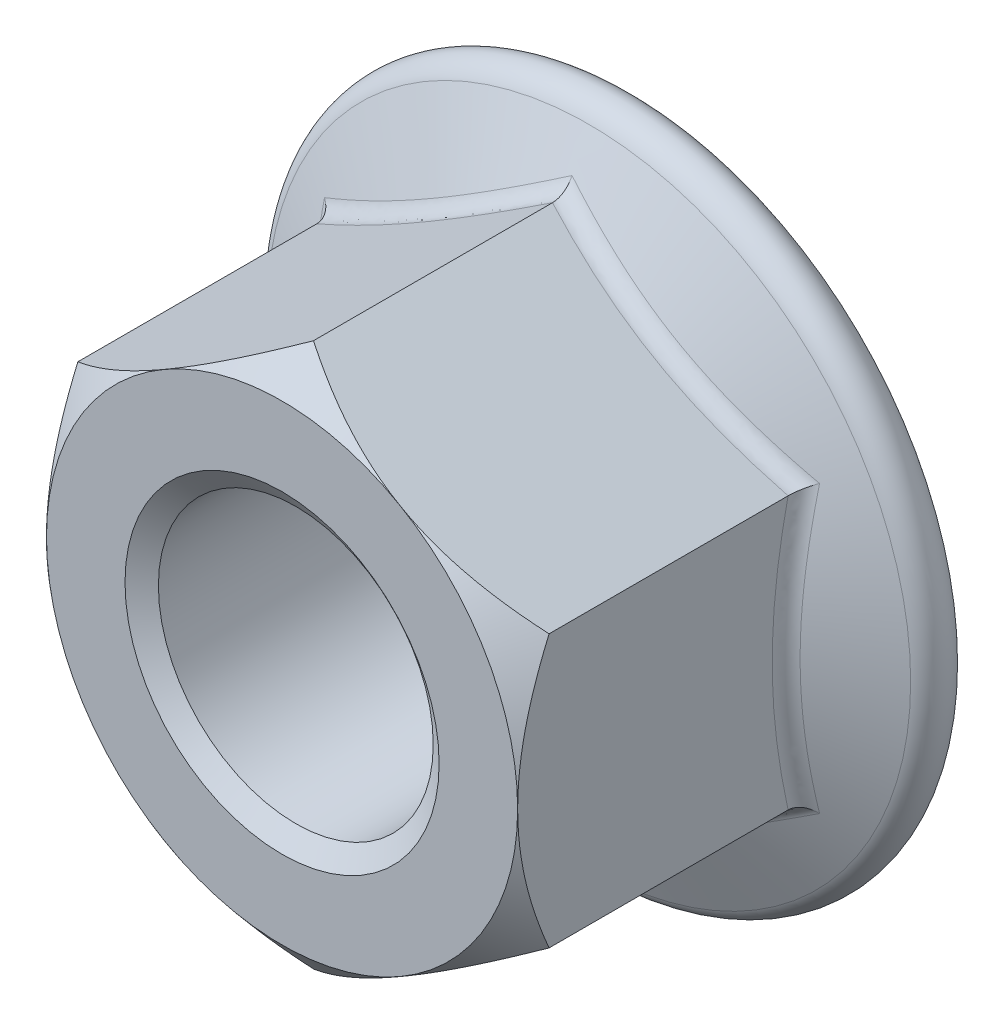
ISO-10303-21;
HEADER;
FILE_DESCRIPTION(('STEP AP214'),'2;1');
FILE_NAME('part.step','',(''),(''),'','','');
FILE_SCHEMA(('AUTOMOTIVE_DESIGN { 1 0 10303 214 1 1 1 1 }'));
ENDSEC;
DATA;
#1=APPLICATION_CONTEXT('core data for automotive mechanical design processes');
#2=APPLICATION_PROTOCOL_DEFINITION('international standard','automotive_design',2000,#1);
#3=PRODUCT_CONTEXT('',#1,'mechanical');
#4=PRODUCT('Part','Part','',(#3));
#5=PRODUCT_RELATED_PRODUCT_CATEGORY('part','',(#4));
#6=PRODUCT_DEFINITION_FORMATION('','',#4);
#7=PRODUCT_DEFINITION_CONTEXT('part definition',#1,'design');
#8=PRODUCT_DEFINITION('design','',#6,#7);
#9=PRODUCT_DEFINITION_SHAPE('','',#8);
#10=(LENGTH_UNIT() NAMED_UNIT(*) SI_UNIT(.MILLI.,.METRE.));
#11=(NAMED_UNIT(*) PLANE_ANGLE_UNIT() SI_UNIT($,.RADIAN.));
#12=(NAMED_UNIT(*) SI_UNIT($,.STERADIAN.) SOLID_ANGLE_UNIT());
#13=UNCERTAINTY_MEASURE_WITH_UNIT(LENGTH_MEASURE(1.E-05),#10,'distance_accuracy_value','');
#14=(GEOMETRIC_REPRESENTATION_CONTEXT(3) GLOBAL_UNCERTAINTY_ASSIGNED_CONTEXT((#13)) GLOBAL_UNIT_ASSIGNED_CONTEXT((#10,
#11,#12)) REPRESENTATION_CONTEXT('',''));
#15=CARTESIAN_POINT('',(0.,0.,0.));
#16=DIRECTION('',(0.,0.,1.));
#17=DIRECTION('',(1.,0.,0.));
#18=AXIS2_PLACEMENT_3D('',#15,#16,#17);
#19=CARTESIAN_POINT('',(0.,0.,-22.5298));
#20=DIRECTION('',(0.,0.,1.));
#21=DIRECTION('',(1.,0.,0.));
#22=AXIS2_PLACEMENT_3D('',#19,#20,#21);
#23=CYLINDRICAL_SURFACE('',#22,8.75);
#24=CARTESIAN_POINT('',(0.,0.,-0.87525942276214));
#25=DIRECTION('',(0.,0.,1.));
#26=DIRECTION('',(1.,0.,0.));
#27=AXIS2_PLACEMENT_3D('',#24,#25,#26);
#28=CIRCLE('',#27,8.75);
#29=CARTESIAN_POINT('',(8.75,0.,-0.87525942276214));
#30=VERTEX_POINT('',#29);
#31=EDGE_CURVE('E353',#30,#30,#28,.F.);
#32=ORIENTED_EDGE('',*,*,#31,.F.);
#33=EDGE_LOOP('',(#32));
#34=FACE_BOUND('',#33,.T.);
#35=CARTESIAN_POINT('',(0.,0.,-21.6291405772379));
#36=DIRECTION('',(0.,0.,-1.));
#37=DIRECTION('',(-1.,0.,0.));
#38=AXIS2_PLACEMENT_3D('',#35,#36,#37);
#39=CIRCLE('',#38,8.75);
#40=CARTESIAN_POINT('',(-8.75,0.,-21.6291405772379));
#41=VERTEX_POINT('',#40);
#42=EDGE_CURVE('E40',#41,#41,#39,.F.);
#43=ORIENTED_EDGE('',*,*,#42,.F.);
#44=EDGE_LOOP('',(#43));
#45=FACE_BOUND('',#44,.T.);
#46=ADVANCED_FACE('F36',(#34,#45),#23,.F.);
#47=CARTESIAN_POINT('',(0.,17.3205080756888,-22.5298));
#48=DIRECTION('',(-0.500000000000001,0.866025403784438,0.));
#49=DIRECTION('',(-0.866025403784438,-0.500000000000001,0.));
#50=AXIS2_PLACEMENT_3D('',#47,#48,#49);
#51=PLANE('',#50);
#52=DIRECTION('',(0.,0.,1.));
#53=VECTOR('',#52,1.);
#54=CARTESIAN_POINT('',(0.,17.3205080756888,-22.5298));
#55=LINE('',#54,#53);
#56=CARTESIAN_POINT('',(0.,17.3205080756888,-17.2163250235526));
#57=VERTEX_POINT('',#56);
#58=CARTESIAN_POINT('',(0.,17.3205080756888,-2.));
#59=VERTEX_POINT('',#58);
#60=EDGE_CURVE('E164',#57,#59,#55,.T.);
#61=ORIENTED_EDGE('',*,*,#60,.F.);
#62=CARTESIAN_POINT('',(3.92561624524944,19.5869636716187,-18.3928346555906));
#63=CARTESIAN_POINT('',(3.71672583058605,19.4663607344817,-19.2119748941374));
#64=CARTESIAN_POINT('',(3.24489093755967,20.1255182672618,-19.4804040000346));
#65=CARTESIAN_POINT('',(3.45747574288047,19.3166826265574,-18.2337120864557));
#66=CARTESIAN_POINT('',(3.25555571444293,19.2001040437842,-19.0499087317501));
#67=CARTESIAN_POINT('',(2.78678610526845,19.8536259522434,-19.3212814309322));
#68=CARTESIAN_POINT('',(2.9879332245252,19.045592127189,-18.0798911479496));
#69=CARTESIAN_POINT('',(2.79231351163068,18.9326510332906,-18.892729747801));
#70=CARTESIAN_POINT('',(2.32786719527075,19.5811259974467,-19.167460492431));
#71=CARTESIAN_POINT('',(2.04567576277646,18.5015795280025,-17.7850523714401));
#72=CARTESIAN_POINT('',(1.86339996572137,18.396342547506,-18.5912947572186));
#73=CARTESIAN_POINT('',(1.40807023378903,19.0349364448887,-18.8726217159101));
#74=CARTESIAN_POINT('',(1.57295977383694,18.228656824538,-17.6440390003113));
#75=CARTESIAN_POINT('',(1.39773890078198,18.1274930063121,-18.4469912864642));
#76=CARTESIAN_POINT('',(0.94719155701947,18.761246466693,-18.7316083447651));
#77=CARTESIAN_POINT('',(0.622391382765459,17.6798459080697,-17.3765885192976));
#78=CARTESIAN_POINT('',(0.462086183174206,17.5872936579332,-18.1731532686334));
#79=CARTESIAN_POINT('',(0.0215920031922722,18.2117814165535,-18.4641578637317));
#80=CARTESIAN_POINT('',(0.144525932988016,17.4039501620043,-17.2502127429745));
#81=CARTESIAN_POINT('',(-0.00796531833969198,17.3159092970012,-18.0436019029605));
#82=CARTESIAN_POINT('',(-0.44313687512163,17.936002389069,-18.3377820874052));
#83=CARTESIAN_POINT('',(-0.81446922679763,16.8502740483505,-17.015356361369));
#84=CARTESIAN_POINT('',(-0.950461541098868,16.771758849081,-17.8027612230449));
#85=CARTESIAN_POINT('',(-1.37467302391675,17.3837396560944,-18.1029257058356));
#86=CARTESIAN_POINT('',(-1.29559862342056,16.5724938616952,-16.9068740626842));
#87=CARTESIAN_POINT('',(-1.42302864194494,16.4989221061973,-17.6913676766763));
#88=CARTESIAN_POINT('',(-1.84148009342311,17.1072560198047,-17.9944434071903));
#89=CARTESIAN_POINT('',(-2.24813909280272,16.0225443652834,-16.7131934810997));
#90=CARTESIAN_POINT('',(-2.35780240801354,15.9592302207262,-17.4924593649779));
#91=CARTESIAN_POINT('',(-2.764772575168,16.5613204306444,-17.8007628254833));
#92=CARTESIAN_POINT('',(-2.71946642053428,15.7504234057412,-16.6274505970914));
#93=CARTESIAN_POINT('',(-2.82011369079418,15.6923146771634,-17.40428266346));
#94=CARTESIAN_POINT('',(-3.22120058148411,16.2918779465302,-17.7150199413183));
#95=CARTESIAN_POINT('',(-3.66476843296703,15.2046530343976,-16.4780489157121));
#96=CARTESIAN_POINT('',(-3.74650484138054,15.1574624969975,-17.2506678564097));
#97=CARTESIAN_POINT('',(-4.13606800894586,15.7530958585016,-17.5656182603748));
#98=CARTESIAN_POINT('',(-4.13874312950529,14.9310036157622,-16.4143902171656));
#99=CARTESIAN_POINT('',(-4.21088534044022,14.889352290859,-17.1851175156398));
#100=CARTESIAN_POINT('',(-4.59450743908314,15.4837562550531,-17.5019595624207));
#101=CARTESIAN_POINT('',(-5.08775332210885,14.3830923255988,-16.3114252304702));
#102=CARTESIAN_POINT('',(-5.13990699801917,14.3529813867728,-17.079147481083));
#103=CARTESIAN_POINT('',(-5.51228457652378,14.946220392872,-17.3989945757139));
#104=CARTESIAN_POINT('',(-5.56278489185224,14.1088327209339,-16.2720712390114));
#105=CARTESIAN_POINT('',(-5.60493440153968,14.0844976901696,-17.0385853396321));
#106=CARTESIAN_POINT('',(-5.97161873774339,14.6780229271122,-17.3596405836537));
#107=CARTESIAN_POINT('',(-6.51392636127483,13.5596909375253,-16.2190048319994));
#108=CARTESIAN_POINT('',(-6.53537978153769,13.5473047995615,-16.9839366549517));
#109=CARTESIAN_POINT('',(-6.89170174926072,14.1427437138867,-17.306574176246));
#110=CARTESIAN_POINT('',(-6.99003624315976,13.2848087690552,-16.2052919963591));
#111=CARTESIAN_POINT('',(-7.00125435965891,13.2783319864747,-16.9697954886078));
#112=CARTESIAN_POINT('',(-7.35245057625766,13.8756619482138,-17.2928613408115));
#113=CARTESIAN_POINT('',(-7.94621812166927,12.7327569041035,-16.2040506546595));
#114=CARTESIAN_POINT('',(-7.9363913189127,12.7384304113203,-16.9685169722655));
#115=CARTESIAN_POINT('',(-8.27865873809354,13.3408192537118,-17.291619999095));
#116=CARTESIAN_POINT('',(-8.42629034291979,12.4555870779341,-16.2167394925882));
#117=CARTESIAN_POINT('',(-8.40614202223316,12.4672197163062,-16.9816024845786));
#118=CARTESIAN_POINT('',(-8.74412553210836,13.0730709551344,-17.3043088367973));
#119=CARTESIAN_POINT('',(-9.38537912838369,11.9018569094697,-16.2682264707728));
#120=CARTESIAN_POINT('',(-9.3443438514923,11.9255486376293,-17.0346254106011));
#121=CARTESIAN_POINT('',(-9.67534824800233,12.5393803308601,-17.3557958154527));
#122=CARTESIAN_POINT('',(-9.86439567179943,11.6252965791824,-16.307025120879));
#123=CARTESIAN_POINT('',(-9.81326497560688,11.654816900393,-17.0746169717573));
#124=CARTESIAN_POINT('',(-10.14110417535,12.2734380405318,-17.3945944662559));
#125=CARTESIAN_POINT('',(-10.8213875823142,11.0727770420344,-16.4093405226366));
#126=CARTESIAN_POINT('',(-10.7500740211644,11.1139499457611,-17.179920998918));
#127=CARTESIAN_POINT('',(-11.0731906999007,11.7429156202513,-17.4969098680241));
#128=CARTESIAN_POINT('',(-11.2993589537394,10.7968201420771,-16.4729065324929));
#129=CARTESIAN_POINT('',(-11.2183605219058,10.8435846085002,-17.2453789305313));
#130=CARTESIAN_POINT('',(-11.5395205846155,11.4783392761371,-17.5604758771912));
#131=CARTESIAN_POINT('',(-12.2526211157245,10.2464539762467,-16.6225458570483));
#132=CARTESIAN_POINT('',(-12.1525268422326,10.3042434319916,-17.3992418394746));
#133=CARTESIAN_POINT('',(-12.4712590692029,10.9510132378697,-17.7101152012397));
#134=CARTESIAN_POINT('',(-12.7279119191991,9.97204470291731,-16.7086190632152));
#135=CARTESIAN_POINT('',(-12.6187170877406,10.035088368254,-17.487761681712));
#136=CARTESIAN_POINT('',(-12.9366676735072,10.6882635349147,-17.796188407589));
#137=CARTESIAN_POINT('',(-13.6885461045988,9.41742229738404,-16.9033591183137));
#138=CARTESIAN_POINT('',(-13.5614152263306,9.49082134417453,-17.6877619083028));
#139=CARTESIAN_POINT('',(-13.8790009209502,10.1571629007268,-17.9909284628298));
#140=CARTESIAN_POINT('',(-14.1738037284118,9.13725867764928,-17.0125852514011));
#141=CARTESIAN_POINT('',(-14.0380319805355,9.21564653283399,-17.7999221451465));
#142=CARTESIAN_POINT('',(-14.3558878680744,9.88885816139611,-18.1001545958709));
#143=CARTESIAN_POINT('',(-15.1410000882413,8.5788475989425,-17.2492500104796));
#144=CARTESIAN_POINT('',(-14.9885806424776,8.66684700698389,-18.0426192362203));
#145=CARTESIAN_POINT('',(-15.3079861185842,9.35372166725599,-18.3368193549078));
#146=CARTESIAN_POINT('',(-15.6229384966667,8.30060032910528,-17.3766904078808));
#147=CARTESIAN_POINT('',(-15.4626385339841,8.39314955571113,-18.1732631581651));
#148=CARTESIAN_POINT('',(-15.783197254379,9.08689005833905,-18.4642597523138));
#149=CARTESIAN_POINT('',(-16.5815550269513,7.74714281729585,-17.6465097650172));
#150=CARTESIAN_POINT('',(-16.40621761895,7.8483739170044,-18.449525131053));
#151=CARTESIAN_POINT('',(-16.7298037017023,8.55556548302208,-18.7340791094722));
#152=CARTESIAN_POINT('',(-17.0582465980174,7.47192481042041,-17.788825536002));
#153=CARTESIAN_POINT('',(-16.8758000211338,7.57726039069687,-18.5951600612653));
#154=CARTESIAN_POINT('',(-17.2012066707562,8.29106741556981,-18.8763948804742));
#155=CARTESIAN_POINT('',(-18.008401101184,6.92335285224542,-18.0864606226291));
#156=CARTESIAN_POINT('',(-17.8125155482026,7.03644742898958,-18.89944882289));
#157=CARTESIAN_POINT('',(-18.1419645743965,7.76319186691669,-19.1740299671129));
#158=CARTESIAN_POINT('',(-18.4818651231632,6.64999827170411,-18.2417752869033));
#159=CARTESIAN_POINT('',(-18.2796376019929,6.76675438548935,-19.0581509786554));
#160=CARTESIAN_POINT('',(-18.6113201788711,7.49981402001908,-19.3293446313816));
#161=CARTESIAN_POINT('',(-18.953905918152,6.37746539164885,-18.4024607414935));
#162=CARTESIAN_POINT('',(-18.7446540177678,6.49827703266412,-19.2218005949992));
#163=CARTESIAN_POINT('',(-19.0797270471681,7.23684227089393,-19.4900300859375));
#164=(BOUNDED_SURFACE() B_SPLINE_SURFACE(3,2,((#62,#63,#64),(#65,#66,#67),(#68,#69,#70),(#71,
#72,#73),(#74,#75,#76),(#77,#78,#79),(#80,#81,#82),(#83,#84,#85),(#86,#87,#88),(#89,#90,#91),
(#92,#93,#94),(#95,#96,#97),(#98,#99,#100),(#101,#102,#103),(#104,#105,#106),(#107,#108,#109),
(#110,#111,#112),(#113,#114,#115),(#116,#117,#118),(#119,#120,#121),(#122,#123,#124),(#125,#126,
#127),(#128,#129,#130),(#131,#132,#133),(#134,#135,#136),(#137,#138,#139),(#140,#141,#142),
(#143,#144,#145),(#146,#147,#148),(#149,#150,#151),(#152,#153,#154),(#155,#156,#157),(#158,#159,
#160),(#161,#162,#163)),.UNSPECIFIED.,.F.,.F.,.F.) B_SPLINE_SURFACE_WITH_KNOTS((4,2,2,2,2,2,2,2,
2,2,2,2,2,2,2,2,4),(3,3),(0.,1.6905434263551,3.38167421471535,5.07965265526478,6.77747031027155,
8.42993159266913,10.0824002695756,11.7316152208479,13.3808031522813,15.0436212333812,
16.7064717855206,18.3726464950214,20.0388131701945,21.751084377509,23.4635222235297,
25.1689606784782,26.873791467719),(0.,1.),
.UNSPECIFIED.) GEOMETRIC_REPRESENTATION_ITEM() RATIONAL_B_SPLINE_SURFACE(((1.,0.814768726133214,
1.),(1.,0.816408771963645,1.),(1.,0.818073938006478,1.),(1.,0.821407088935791,1.),(1.,
0.823075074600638,1.),(1.,0.826371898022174,1.),(1.,0.828000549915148,1.),(1.,0.831141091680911,
1.),(1.,0.832652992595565,1.),(1.,0.835437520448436,1.),(1.,0.836715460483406,1.),(1.,
0.838994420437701,1.),(1.,0.839995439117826,1.),(1.,0.84163848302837,1.),(1.,0.842281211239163,
1.),(1.,0.843152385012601,1.),(1.,0.843380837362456,1.),(1.,0.843401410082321,1.),(1.,
0.843189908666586,1.),(1.,0.842344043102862,1.),(1.,0.841709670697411,1.),(1.,0.840075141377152,
1.),(1.,0.839074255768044,1.),(1.,0.836788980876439,1.),(1.,0.835504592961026,1.),(1.,
0.832702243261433,1.),(1.,0.831178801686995,1.),(1.,0.828012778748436,1.),(1.,0.826370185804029,
1.),(1.,0.823045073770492,1.),(1.,0.82136274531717,1.),(1.,0.81800146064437,1.),(1.,
0.816322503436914,1.),(1.,0.814669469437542,1.))) REPRESENTATION_ITEM('') SURFACE());
#165=CARTESIAN_POINT('',(3.92561624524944,19.5869636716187,-18.3928346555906));
#166=CARTESIAN_POINT('',(3.45747574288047,19.3166826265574,-18.2337120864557));
#167=CARTESIAN_POINT('',(2.9879332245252,19.045592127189,-18.0798911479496));
#168=CARTESIAN_POINT('',(2.04567576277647,18.5015795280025,-17.7850523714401));
#169=CARTESIAN_POINT('',(1.57295977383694,18.228656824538,-17.6440390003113));
#170=CARTESIAN_POINT('',(0.622391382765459,17.6798459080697,-17.3765885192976));
#171=CARTESIAN_POINT('',(0.144525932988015,17.4039501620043,-17.2502127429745));
#172=CARTESIAN_POINT('',(-0.814469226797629,16.8502740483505,-17.015356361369));
#173=CARTESIAN_POINT('',(-1.29559862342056,16.5724938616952,-16.9068740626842));
#174=CARTESIAN_POINT('',(-2.24813909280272,16.0225443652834,-16.7131934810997));
#175=CARTESIAN_POINT('',(-2.71946642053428,15.7504234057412,-16.6274505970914));
#176=CARTESIAN_POINT('',(-3.66476843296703,15.2046530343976,-16.4780489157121));
#177=CARTESIAN_POINT('',(-4.13874312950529,14.9310036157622,-16.4143902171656));
#178=CARTESIAN_POINT('',(-5.08775332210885,14.3830923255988,-16.3114252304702));
#179=CARTESIAN_POINT('',(-5.56278489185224,14.1088327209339,-16.2720712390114));
#180=CARTESIAN_POINT('',(-6.51392636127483,13.5596909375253,-16.2190048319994));
#181=CARTESIAN_POINT('',(-6.99003624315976,13.2848087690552,-16.2052919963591));
#182=CARTESIAN_POINT('',(-7.94621812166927,12.7327569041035,-16.2040506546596));
#183=CARTESIAN_POINT('',(-8.42629034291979,12.4555870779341,-16.2167394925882));
#184=CARTESIAN_POINT('',(-9.38537912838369,11.9018569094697,-16.2682264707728));
#185=CARTESIAN_POINT('',(-9.86439567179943,11.6252965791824,-16.307025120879));
#186=CARTESIAN_POINT('',(-10.8213875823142,11.0727770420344,-16.4093405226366));
#187=CARTESIAN_POINT('',(-11.2993589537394,10.7968201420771,-16.4729065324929));
#188=CARTESIAN_POINT('',(-12.2526211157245,10.2464539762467,-16.6225458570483));
#189=CARTESIAN_POINT('',(-12.7279119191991,9.97204470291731,-16.7086190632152));
#190=CARTESIAN_POINT('',(-13.6885461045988,9.41742229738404,-16.9033591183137));
#191=CARTESIAN_POINT('',(-14.1738037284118,9.13725867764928,-17.0125852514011));
#192=CARTESIAN_POINT('',(-15.1410000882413,8.5788475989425,-17.2492500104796));
#193=CARTESIAN_POINT('',(-15.6229384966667,8.30060032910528,-17.3766904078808));
#194=CARTESIAN_POINT('',(-16.5815550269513,7.74714281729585,-17.6465097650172));
#195=CARTESIAN_POINT('',(-17.0582465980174,7.47192481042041,-17.788825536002));
#196=CARTESIAN_POINT('',(-18.008401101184,6.92335285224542,-18.0864606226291));
#197=CARTESIAN_POINT('',(-18.4818651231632,6.64999827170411,-18.2417752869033));
#198=CARTESIAN_POINT('',(-18.953905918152,6.37746539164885,-18.4024607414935));
#199=B_SPLINE_CURVE_WITH_KNOTS('',3,(#165,#166,#167,#168,#169,#170,#171,#172,#173,#174,#175,
#176,#177,#178,#179,#180,#181,#182,#183,#184,#185,#186,#187,#188,#189,#190,#191,#192,#193,#194,
#195,#196,#197,#198),.UNSPECIFIED.,.F.,.F.,(4,2,2,2,2,2,2,2,2,2,2,2,2,2,2,2,4),(0.,
1.6905434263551,3.38167421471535,5.07965265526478,6.77747031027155,8.42993159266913,
10.0824002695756,11.7316152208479,13.3808031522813,15.0436212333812,16.7064717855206,
18.3726464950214,20.0388131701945,21.751084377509,23.4635222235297,25.1689606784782,
26.873791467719),.UNSPECIFIED.);
#200=CARTESIAN_POINT('',(-15.,8.66025403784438,-17.2163250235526));
#201=VERTEX_POINT('',#200);
#202=EDGE_CURVE('E509',#57,#201,#199,.T.);
#203=ORIENTED_EDGE('',*,*,#202,.T.);
#204=DIRECTION('',(0.,0.,1.));
#205=VECTOR('',#204,1.);
#206=CARTESIAN_POINT('',(-15.,8.66025403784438,-22.5298));
#207=LINE('',#206,#205);
#208=CARTESIAN_POINT('',(-15.,8.66025403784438,-1.99999999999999));
#209=VERTEX_POINT('',#208);
#210=EDGE_CURVE('E406',#201,#209,#207,.T.);
#211=ORIENTED_EDGE('',*,*,#210,.T.);
#212=CARTESIAN_POINT('',(-15.0002,8.66013856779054,-2.00009952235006));
#213=CARTESIAN_POINT('',(-14.7060757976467,8.82995125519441,-1.85376357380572));
#214=CARTESIAN_POINT('',(-14.4098812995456,9.00095922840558,-1.71280448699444));
#215=CARTESIAN_POINT('',(-13.8130701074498,9.34552833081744,-1.44337970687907));
#216=CARTESIAN_POINT('',(-13.5124509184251,9.51909090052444,-1.31492139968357));
#217=CARTESIAN_POINT('',(-12.9053171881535,9.86961972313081,-1.07179862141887));
#218=CARTESIAN_POINT('',(-12.5987804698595,10.0465987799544,-0.957207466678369));
#219=CARTESIAN_POINT('',(-11.9814441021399,10.4030180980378,-0.744650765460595));
#220=CARTESIAN_POINT('',(-11.6706451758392,10.5824579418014,-0.646682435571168));
#221=CARTESIAN_POINT('',(-11.0506469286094,10.9404140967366,-0.471023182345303));
#222=CARTESIAN_POINT('',(-10.7415185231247,11.1188894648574,-0.393000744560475));
#223=CARTESIAN_POINT('',(-10.1199547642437,11.4777494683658,-0.256865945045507));
#224=CARTESIAN_POINT('',(-9.80751931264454,11.658134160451,-0.198754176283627));
#225=CARTESIAN_POINT('',(-9.18088543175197,12.0199214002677,-0.104143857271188));
#226=CARTESIAN_POINT('',(-8.86669240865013,12.201320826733,-0.0675979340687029));
#227=CARTESIAN_POINT('',(-8.23695394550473,12.5649004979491,-0.0170214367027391));
#228=CARTESIAN_POINT('',(-7.92140860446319,12.7470806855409,-0.00298924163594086));
#229=CARTESIAN_POINT('',(-7.3342645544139,13.08606846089,0.00177413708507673));
#230=CARTESIAN_POINT('',(-7.06268097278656,13.24286731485,-0.00451502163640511));
#231=CARTESIAN_POINT('',(-6.52020787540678,13.5560643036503,-0.033919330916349));
#232=CARTESIAN_POINT('',(-6.2493183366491,13.7124624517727,-0.0570339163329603));
#233=CARTESIAN_POINT('',(-5.70876115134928,14.024553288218,-0.119589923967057));
#234=CARTESIAN_POINT('',(-5.43909455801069,14.1802453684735,-0.159043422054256));
#235=CARTESIAN_POINT('',(-4.90182180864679,14.490439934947,-0.253419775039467));
#236=CARTESIAN_POINT('',(-4.6342156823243,14.6449424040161,-0.308342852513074));
#237=CARTESIAN_POINT('',(-3.83513389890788,15.1062924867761,-0.494766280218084));
#238=CARTESIAN_POINT('',(-3.30738818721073,15.4109866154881,-0.647921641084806));
#239=CARTESIAN_POINT('',(-2.26451509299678,16.0130896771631,-1.00192343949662));
#240=CARTESIAN_POINT('',(-1.74938365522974,16.310500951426,-1.20275432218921));
#241=CARTESIAN_POINT('',(-1.03142392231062,16.7250151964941,-1.51292629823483));
#242=CARTESIAN_POINT('',(-0.823357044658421,16.8451426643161,-1.60648338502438));
#243=CARTESIAN_POINT('',(-0.409806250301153,17.0839063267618,-1.79919445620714));
#244=CARTESIAN_POINT('',(-0.204317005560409,17.2025455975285,-1.89833317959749));
#245=CARTESIAN_POINT('',(0.000200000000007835,17.3206235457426,-2.00009952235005));
#246=B_SPLINE_CURVE_WITH_KNOTS('',3,(#212,#213,#214,#215,#216,#217,#218,#219,#220,#221,#222,
#223,#224,#225,#226,#227,#228,#229,#230,#231,#232,#233,#234,#235,#236,#237,#238,#239,#240,#241,
#242,#243,#244,#245),.UNSPECIFIED.,.F.,.F.,(4,2,2,2,2,2,2,2,2,2,2,2,2,2,2,2,4),(0.,
1.10948507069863,2.21962175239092,3.33539267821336,4.45097658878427,5.54659561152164,
6.64224726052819,7.73548308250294,8.82864019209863,9.76917575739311,10.7096797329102,
11.6508800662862,12.592093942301,14.4744986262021,16.3562899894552,17.1297186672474,
17.9011266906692),.UNSPECIFIED.);
#247=CARTESIAN_POINT('',(-7.50000000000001,12.9903810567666,0.));
#248=VERTEX_POINT('',#247);
#249=EDGE_CURVE('E167',#209,#248,#246,.T.);
#250=ORIENTED_EDGE('',*,*,#249,.T.);
#251=EDGE_CURVE('E145',#248,#59,#246,.T.);
#252=ORIENTED_EDGE('',*,*,#251,.T.);
#253=EDGE_LOOP('',(#61,#203,#211,#250,#252));
#254=FACE_BOUND('',#253,.T.);
#255=ADVANCED_FACE('F383',(#254),#51,.T.);
#256=CARTESIAN_POINT('',(15.,8.66025403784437,-22.5298));
#257=DIRECTION('',(0.500000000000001,0.866025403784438,0.));
#258=DIRECTION('',(-0.866025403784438,0.500000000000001,0.));
#259=AXIS2_PLACEMENT_3D('',#256,#257,#258);
#260=PLANE('',#259);
#261=DIRECTION('',(0.,0.,1.));
#262=VECTOR('',#261,1.);
#263=CARTESIAN_POINT('',(15.,8.66025403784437,-22.5298));
#264=LINE('',#263,#262);
#265=CARTESIAN_POINT('',(15.,8.66025403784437,-17.2163250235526));
#266=VERTEX_POINT('',#265);
#267=CARTESIAN_POINT('',(15.,8.6602540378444,-2.));
#268=VERTEX_POINT('',#267);
#269=EDGE_CURVE('E411',#266,#268,#264,.T.);
#270=ORIENTED_EDGE('',*,*,#269,.F.);
#271=CARTESIAN_POINT('',(18.9256162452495,6.39379844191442,-18.3928346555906));
#272=CARTESIAN_POINT('',(18.7167258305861,6.51440137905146,-19.2119748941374));
#273=CARTESIAN_POINT('',(19.0516555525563,7.25260114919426,-19.4804040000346));
#274=CARTESIAN_POINT('',(18.4574757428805,6.66407948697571,-18.2337120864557));
#275=CARTESIAN_POINT('',(18.255555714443,6.7806580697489,-19.0499087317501));
#276=CARTESIAN_POINT('',(18.587137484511,7.51338541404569,-19.3212814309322));
#277=CARTESIAN_POINT('',(17.9879332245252,6.9351699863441,-18.0798911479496));
#278=CARTESIAN_POINT('',(17.7923135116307,7.04811108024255,-18.892729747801));
#279=CARTESIAN_POINT('',(18.1216861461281,7.7745708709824,-19.167460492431));
#280=CARTESIAN_POINT('',(17.0456757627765,7.47918258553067,-17.7850523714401));
#281=CARTESIAN_POINT('',(16.8633999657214,7.58441956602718,-18.5912947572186));
#282=CARTESIAN_POINT('',(17.1887736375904,8.29804362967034,-18.8726217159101));
#283=CARTESIAN_POINT('',(16.572959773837,7.75210528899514,-17.6440390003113));
#284=CARTESIAN_POINT('',(16.397738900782,7.85326910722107,-18.4469912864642));
#285=CARTESIAN_POINT('',(16.7213118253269,8.56033128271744,-18.7316083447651));
#286=CARTESIAN_POINT('',(15.6223913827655,8.30091620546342,-17.3765885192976));
#287=CARTESIAN_POINT('',(15.4620861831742,8.39346845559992,-18.1731532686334));
#288=CARTESIAN_POINT('',(15.7826613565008,9.08719148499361,-18.4641578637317));
#289=CARTESIAN_POINT('',(15.144525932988,8.57681195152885,-17.2502127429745));
#290=CARTESIAN_POINT('',(14.9920346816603,8.66485281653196,-18.0436019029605));
#291=CARTESIAN_POINT('',(15.3114652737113,9.35176898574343,-18.3377820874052));
#292=CARTESIAN_POINT('',(14.1855307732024,9.13048806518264,-17.015356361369));
#293=CARTESIAN_POINT('',(14.0495384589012,9.20900326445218,-17.8027612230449));
#294=CARTESIAN_POINT('',(14.3674236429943,9.88237158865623,-18.1029257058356));
#295=CARTESIAN_POINT('',(13.7044013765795,9.40826825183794,-16.9068740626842));
#296=CARTESIAN_POINT('',(13.5769713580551,9.48184000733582,-17.6913676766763));
#297=CARTESIAN_POINT('',(13.8945782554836,10.1483965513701,-17.9944434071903));
#298=CARTESIAN_POINT('',(12.7518609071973,9.95821774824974,-16.7131934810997));
#299=CARTESIAN_POINT('',(12.6421975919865,10.0215318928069,-17.4924593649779));
#300=CARTESIAN_POINT('',(12.9601379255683,10.6750235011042,-17.8007628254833));
#301=CARTESIAN_POINT('',(12.2805335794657,10.230338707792,-16.6274505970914));
#302=CARTESIAN_POINT('',(12.1798863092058,10.2884474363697,-17.40428266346));
#303=CARTESIAN_POINT('',(12.4985798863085,10.9355805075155,-17.7150199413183));
#304=CARTESIAN_POINT('',(11.335231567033,10.7761090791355,-16.4780489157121));
#305=CARTESIAN_POINT('',(11.2534951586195,10.8232996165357,-17.2506678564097));
#306=CARTESIAN_POINT('',(11.5745471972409,11.458487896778,-17.5656182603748));
#307=CARTESIAN_POINT('',(10.8612568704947,11.049758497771,-16.4143902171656));
#308=CARTESIAN_POINT('',(10.7891146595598,11.0914098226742,-17.1851175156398));
#309=CARTESIAN_POINT('',(11.1120725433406,11.7208382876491,-17.5019595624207));
#310=CARTESIAN_POINT('',(9.91224667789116,11.5976697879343,-16.3114252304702));
#311=CARTESIAN_POINT('',(9.86009300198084,11.6277807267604,-17.079147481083));
#312=CARTESIAN_POINT('',(10.1876642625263,12.2468886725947,-17.3989945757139));
#313=CARTESIAN_POINT('',(9.43721510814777,11.8719293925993,-16.2720712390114));
#314=CARTESIAN_POINT('',(9.39506559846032,11.8962644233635,-17.0385853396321));
#315=CARTESIAN_POINT('',(9.72573136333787,12.510584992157,-17.3596405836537));
#316=CARTESIAN_POINT('',(8.48607363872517,12.4210711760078,-16.2190048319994));
#317=CARTESIAN_POINT('',(8.46462021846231,12.4334573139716,-16.9839366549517));
#318=CARTESIAN_POINT('',(8.80212446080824,13.0397606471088,-17.306574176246));
#319=CARTESIAN_POINT('',(8.00996375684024,12.6959533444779,-16.2052919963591));
#320=CARTESIAN_POINT('',(7.99874564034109,12.7024301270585,-16.9697954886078));
#321=CARTESIAN_POINT('',(8.34045045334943,13.3052399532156,-17.2928613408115));
#322=CARTESIAN_POINT('',(7.05378187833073,13.2480052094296,-16.2040506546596));
#323=CARTESIAN_POINT('',(7.0636086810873,13.2423317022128,-16.9685169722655));
#324=CARTESIAN_POINT('',(7.41415901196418,13.8399384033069,-17.291619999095));
#325=CARTESIAN_POINT('',(6.57370965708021,13.5251750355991,-16.2167394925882));
#326=CARTESIAN_POINT('',(6.59385797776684,13.5135423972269,-16.9816024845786));
#327=CARTESIAN_POINT('',(6.94954878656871,14.1091703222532,-17.3043088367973));
#328=CARTESIAN_POINT('',(5.61462087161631,14.0789052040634,-16.2682264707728));
#329=CARTESIAN_POINT('',(5.6556561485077,14.0552134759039,-17.0346254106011));
#330=CARTESIAN_POINT('',(6.02174779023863,14.6487875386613,-17.3557958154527));
#331=CARTESIAN_POINT('',(5.13560432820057,14.3554655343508,-16.307025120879));
#332=CARTESIAN_POINT('',(5.18673502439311,14.3259452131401,-17.0746169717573));
#333=CARTESIAN_POINT('',(5.55855704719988,14.9191728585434,-17.3945944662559));
#334=CARTESIAN_POINT('',(4.17861241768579,14.9079850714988,-16.4093405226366));
#335=CARTESIAN_POINT('',(4.2499259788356,14.8668121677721,-17.179920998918));
#336=CARTESIAN_POINT('',(4.63306789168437,15.4611222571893,-17.4969098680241));
#337=CARTESIAN_POINT('',(3.70064104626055,15.1839419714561,-16.4729065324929));
#338=CARTESIAN_POINT('',(3.78163947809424,15.137177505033,-17.2453789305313));
#339=CARTESIAN_POINT('',(4.17077311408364,15.732687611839,-17.5604758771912));
#340=CARTESIAN_POINT('',(2.74737888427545,15.7343081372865,-16.6225458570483));
#341=CARTESIAN_POINT('',(2.8474731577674,15.6765186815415,-17.3992418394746));
#342=CARTESIAN_POINT('',(3.24822612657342,16.2759337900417,-17.7101152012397));
#343=CARTESIAN_POINT('',(2.27208808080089,16.0087174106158,-16.7086190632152));
#344=CARTESIAN_POINT('',(2.38128291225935,15.9456737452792,-17.487761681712));
#345=CARTESIAN_POINT('',(2.78797390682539,16.5476146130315,-17.796188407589));
#346=CARTESIAN_POINT('',(1.31145389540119,16.5633398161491,-16.9033591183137));
#347=CARTESIAN_POINT('',(1.43858477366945,16.4899407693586,-17.6877619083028));
#348=CARTESIAN_POINT('',(1.85686064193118,17.098148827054,-17.9909284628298));
#349=CARTESIAN_POINT('',(0.826196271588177,16.8435034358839,-17.0125852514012));
#350=CARTESIAN_POINT('',(0.961968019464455,16.7651155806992,-17.7999221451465));
#351=CARTESIAN_POINT('',(1.3860584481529,17.3769926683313,-18.100154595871));
#352=CARTESIAN_POINT('',(-0.141000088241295,17.4019145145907,-17.2492500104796));
#353=CARTESIAN_POINT('',(0.0114193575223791,17.3139151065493,-18.0426192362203));
#354=CARTESIAN_POINT('',(0.446567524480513,17.9339656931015,-18.3368193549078));
#355=CARTESIAN_POINT('',(-0.622938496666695,17.6801617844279,-17.3766904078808));
#356=CARTESIAN_POINT('',(-0.462638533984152,17.587612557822,-18.1732631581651));
#357=CARTESIAN_POINT('',(-0.0221209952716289,18.2120948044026,-18.4642597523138));
#358=CARTESIAN_POINT('',(-1.58155502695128,18.2336192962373,-17.6465097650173));
#359=CARTESIAN_POINT('',(-1.40621761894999,18.1323881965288,-18.449525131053));
#360=CARTESIAN_POINT('',(-0.955564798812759,18.7662177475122,-18.7340791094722));
#361=CARTESIAN_POINT('',(-2.05824659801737,18.5088373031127,-17.7888255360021));
#362=CARTESIAN_POINT('',(-1.87580002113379,18.4035017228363,-18.5951600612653));
#363=CARTESIAN_POINT('',(-1.42032832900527,19.0422156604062,-18.8763948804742));
#364=CARTESIAN_POINT('',(-3.00840110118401,19.0574092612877,-18.0864606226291));
#365=CARTESIAN_POINT('',(-2.81251554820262,18.9443146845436,-18.89944882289));
#366=CARTESIAN_POINT('',(-2.34786091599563,19.5929981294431,-19.1740299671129));
#367=CARTESIAN_POINT('',(-3.48186512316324,19.3307638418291,-18.2417752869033));
#368=CARTESIAN_POINT('',(-3.27963760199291,19.2140077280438,-19.0581509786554));
#369=CARTESIAN_POINT('',(-2.81063062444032,19.8677830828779,-19.3293446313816));
#370=CARTESIAN_POINT('',(-3.95390591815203,19.6032967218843,-18.4024607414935));
#371=CARTESIAN_POINT('',(-3.74465401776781,19.4824850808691,-19.2218005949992));
#372=CARTESIAN_POINT('',(-3.27257427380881,20.1419494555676,-19.4900300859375));
#373=(BOUNDED_SURFACE() B_SPLINE_SURFACE(3,2,((#271,#272,#273),(#274,#275,#276),(#277,#278,
#279),(#280,#281,#282),(#283,#284,#285),(#286,#287,#288),(#289,#290,#291),(#292,#293,#294),
(#295,#296,#297),(#298,#299,#300),(#301,#302,#303),(#304,#305,#306),(#307,#308,#309),(#310,#311,
#312),(#313,#314,#315),(#316,#317,#318),(#319,#320,#321),(#322,#323,#324),(#325,#326,#327),
(#328,#329,#330),(#331,#332,#333),(#334,#335,#336),(#337,#338,#339),(#340,#341,#342),(#343,#344,
#345),(#346,#347,#348),(#349,#350,#351),(#352,#353,#354),(#355,#356,#357),(#358,#359,#360),
(#361,#362,#363),(#364,#365,#366),(#367,#368,#369),(#370,#371,#372)),.UNSPECIFIED.,.F.,.F.,
.F.) B_SPLINE_SURFACE_WITH_KNOTS((4,2,2,2,2,2,2,2,2,2,2,2,2,2,2,2,4),(3,3),(0.,1.6905434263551,
3.38167421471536,5.07965265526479,6.77747031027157,8.42993159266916,10.0824002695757,
11.7316152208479,13.3808031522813,15.0436212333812,16.7064717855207,18.3726464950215,
20.0388131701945,21.751084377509,23.4635222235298,25.1689606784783,26.8737914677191),(0.,1.),
.UNSPECIFIED.) GEOMETRIC_REPRESENTATION_ITEM() RATIONAL_B_SPLINE_SURFACE(((1.,0.814768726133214,
1.),(1.,0.816408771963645,1.),(1.,0.818073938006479,1.),(1.,0.821407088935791,1.),(1.,
0.823075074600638,1.),(1.,0.826371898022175,1.),(1.,0.828000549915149,1.),(1.,0.831141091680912,
1.),(1.,0.832652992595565,1.),(1.,0.835437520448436,1.),(1.,0.836715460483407,1.),(1.,
0.838994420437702,1.),(1.,0.839995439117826,1.),(1.,0.84163848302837,1.),(1.,0.842281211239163,
1.),(1.,0.843152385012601,1.),(1.,0.843380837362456,1.),(1.,0.843401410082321,1.),(1.,
0.843189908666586,1.),(1.,0.842344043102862,1.),(1.,0.841709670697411,1.),(1.,0.840075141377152,
1.),(1.,0.839074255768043,1.),(1.,0.836788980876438,1.),(1.,0.835504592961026,1.),(1.,
0.832702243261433,1.),(1.,0.831178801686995,1.),(1.,0.828012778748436,1.),(1.,0.826370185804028,
1.),(1.,0.823045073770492,1.),(1.,0.82136274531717,1.),(1.,0.81800146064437,1.),(1.,
0.816322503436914,1.),(1.,0.814669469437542,1.))) REPRESENTATION_ITEM('') SURFACE());
#374=CARTESIAN_POINT('',(18.9256162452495,6.39379844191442,-18.3928346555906));
#375=CARTESIAN_POINT('',(18.4574757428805,6.66407948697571,-18.2337120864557));
#376=CARTESIAN_POINT('',(17.9879332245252,6.9351699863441,-18.0798911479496));
#377=CARTESIAN_POINT('',(17.0456757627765,7.47918258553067,-17.7850523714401));
#378=CARTESIAN_POINT('',(16.572959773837,7.75210528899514,-17.6440390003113));
#379=CARTESIAN_POINT('',(15.6223913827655,8.30091620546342,-17.3765885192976));
#380=CARTESIAN_POINT('',(15.144525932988,8.57681195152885,-17.2502127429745));
#381=CARTESIAN_POINT('',(14.1855307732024,9.13048806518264,-17.015356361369));
#382=CARTESIAN_POINT('',(13.7044013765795,9.40826825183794,-16.9068740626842));
#383=CARTESIAN_POINT('',(12.7518609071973,9.95821774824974,-16.7131934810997));
#384=CARTESIAN_POINT('',(12.2805335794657,10.230338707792,-16.6274505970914));
#385=CARTESIAN_POINT('',(11.335231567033,10.7761090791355,-16.4780489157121));
#386=CARTESIAN_POINT('',(10.8612568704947,11.049758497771,-16.4143902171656));
#387=CARTESIAN_POINT('',(9.91224667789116,11.5976697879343,-16.3114252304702));
#388=CARTESIAN_POINT('',(9.43721510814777,11.8719293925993,-16.2720712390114));
#389=CARTESIAN_POINT('',(8.48607363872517,12.4210711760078,-16.2190048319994));
#390=CARTESIAN_POINT('',(8.00996375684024,12.6959533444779,-16.2052919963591));
#391=CARTESIAN_POINT('',(7.05378187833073,13.2480052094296,-16.2040506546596));
#392=CARTESIAN_POINT('',(6.57370965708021,13.5251750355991,-16.2167394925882));
#393=CARTESIAN_POINT('',(5.61462087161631,14.0789052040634,-16.2682264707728));
#394=CARTESIAN_POINT('',(5.13560432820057,14.3554655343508,-16.307025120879));
#395=CARTESIAN_POINT('',(4.17861241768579,14.9079850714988,-16.4093405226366));
#396=CARTESIAN_POINT('',(3.70064104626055,15.1839419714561,-16.4729065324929));
#397=CARTESIAN_POINT('',(2.74737888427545,15.7343081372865,-16.6225458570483));
#398=CARTESIAN_POINT('',(2.27208808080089,16.0087174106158,-16.7086190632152));
#399=CARTESIAN_POINT('',(1.31145389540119,16.5633398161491,-16.9033591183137));
#400=CARTESIAN_POINT('',(0.826196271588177,16.8435034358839,-17.0125852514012));
#401=CARTESIAN_POINT('',(-0.141000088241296,17.4019145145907,-17.2492500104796));
#402=CARTESIAN_POINT('',(-0.622938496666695,17.6801617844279,-17.3766904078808));
#403=CARTESIAN_POINT('',(-1.58155502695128,18.2336192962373,-17.6465097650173));
#404=CARTESIAN_POINT('',(-2.05824659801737,18.5088373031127,-17.7888255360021));
#405=CARTESIAN_POINT('',(-3.00840110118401,19.0574092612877,-18.0864606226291));
#406=CARTESIAN_POINT('',(-3.48186512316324,19.3307638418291,-18.2417752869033));
#407=CARTESIAN_POINT('',(-3.95390591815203,19.6032967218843,-18.4024607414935));
#408=B_SPLINE_CURVE_WITH_KNOTS('',3,(#374,#375,#376,#377,#378,#379,#380,#381,#382,#383,#384,
#385,#386,#387,#388,#389,#390,#391,#392,#393,#394,#395,#396,#397,#398,#399,#400,#401,#402,#403,
#404,#405,#406,#407),.UNSPECIFIED.,.F.,.F.,(4,2,2,2,2,2,2,2,2,2,2,2,2,2,2,2,4),(0.,
1.6905434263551,3.38167421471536,5.07965265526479,6.77747031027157,8.42993159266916,
10.0824002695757,11.7316152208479,13.3808031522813,15.0436212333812,16.7064717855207,
18.3726464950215,20.0388131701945,21.751084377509,23.4635222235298,25.1689606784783,
26.8737914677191),.UNSPECIFIED.);
#409=EDGE_CURVE('E150',#266,#57,#408,.T.);
#410=ORIENTED_EDGE('',*,*,#409,.T.);
#411=ORIENTED_EDGE('',*,*,#60,.T.);
#412=CARTESIAN_POINT('',(-0.000199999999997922,17.3206235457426,-2.00009952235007));
#413=CARTESIAN_POINT('',(0.293924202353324,17.1508108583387,-1.85376357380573));
#414=CARTESIAN_POINT('',(0.59011870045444,16.9798028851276,-1.71280448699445));
#415=CARTESIAN_POINT('',(1.1869298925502,16.6352337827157,-1.44337970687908));
#416=CARTESIAN_POINT('',(1.48754908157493,16.4616712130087,-1.31492139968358));
#417=CARTESIAN_POINT('',(2.09468281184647,16.1111423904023,-1.07179862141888));
#418=CARTESIAN_POINT('',(2.40121953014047,15.9341633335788,-0.957207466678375));
#419=CARTESIAN_POINT('',(3.01855589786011,15.5777440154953,-0.744650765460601));
#420=CARTESIAN_POINT('',(3.32935482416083,15.3983041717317,-0.646682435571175));
#421=CARTESIAN_POINT('',(3.94935307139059,15.0403480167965,-0.471023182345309));
#422=CARTESIAN_POINT('',(4.25848147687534,14.8618726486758,-0.393000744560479));
#423=CARTESIAN_POINT('',(4.8800452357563,14.5030126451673,-0.25686594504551));
#424=CARTESIAN_POINT('',(5.19248068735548,14.3226279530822,-0.19875417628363));
#425=CARTESIAN_POINT('',(5.81911456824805,13.9608407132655,-0.104143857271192));
#426=CARTESIAN_POINT('',(6.13330759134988,13.7794412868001,-0.0675979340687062));
#427=CARTESIAN_POINT('',(6.76304605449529,13.4158616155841,-0.0170214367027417));
#428=CARTESIAN_POINT('',(7.07859139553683,13.2336814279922,-0.00298924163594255));
#429=CARTESIAN_POINT('',(7.66573544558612,12.8946936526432,0.00177413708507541));
#430=CARTESIAN_POINT('',(7.93731902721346,12.7378947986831,-0.00451502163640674));
#431=CARTESIAN_POINT('',(8.47979212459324,12.4246978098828,-0.0339193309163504));
#432=CARTESIAN_POINT('',(8.75068166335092,12.2682996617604,-0.0570339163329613));
#433=CARTESIAN_POINT('',(9.29123884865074,11.9562088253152,-0.119589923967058));
#434=CARTESIAN_POINT('',(9.56090544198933,11.8005167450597,-0.159043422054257));
#435=CARTESIAN_POINT('',(10.0981781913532,11.4903221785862,-0.253419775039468));
#436=CARTESIAN_POINT('',(10.3657843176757,11.3358197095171,-0.308342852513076));
#437=CARTESIAN_POINT('',(11.1648661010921,10.8744696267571,-0.494766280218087));
#438=CARTESIAN_POINT('',(11.6926118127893,10.5697754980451,-0.647921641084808));
#439=CARTESIAN_POINT('',(12.7354849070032,9.96767243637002,-1.00192343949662));
#440=CARTESIAN_POINT('',(13.2506163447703,9.67026116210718,-1.20275432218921));
#441=CARTESIAN_POINT('',(13.9685760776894,9.25574691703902,-1.51292629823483));
#442=CARTESIAN_POINT('',(14.1766429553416,9.13561944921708,-1.60648338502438));
#443=CARTESIAN_POINT('',(14.5901937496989,8.89685578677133,-1.79919445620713));
#444=CARTESIAN_POINT('',(14.7956829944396,8.77821651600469,-1.89833317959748));
#445=CARTESIAN_POINT('',(15.0002,8.66013856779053,-2.00009952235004));
#446=B_SPLINE_CURVE_WITH_KNOTS('',3,(#412,#413,#414,#415,#416,#417,#418,#419,#420,#421,#422,
#423,#424,#425,#426,#427,#428,#429,#430,#431,#432,#433,#434,#435,#436,#437,#438,#439,#440,#441,
#442,#443,#444,#445),.UNSPECIFIED.,.F.,.F.,(4,2,2,2,2,2,2,2,2,2,2,2,2,2,2,2,4),(0.,
1.10948507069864,2.21962175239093,3.33539267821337,4.45097658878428,5.54659561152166,
6.6422472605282,7.73548308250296,8.82864019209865,9.76917575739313,10.7096797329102,
11.6508800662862,12.592093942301,14.4744986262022,16.3562899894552,17.1297186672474,
17.9011266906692),.UNSPECIFIED.);
#447=CARTESIAN_POINT('',(7.50000000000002,12.9903810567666,0.));
#448=VERTEX_POINT('',#447);
#449=EDGE_CURVE('E137',#59,#448,#446,.T.);
#450=ORIENTED_EDGE('',*,*,#449,.T.);
#451=EDGE_CURVE('E126',#448,#268,#446,.T.);
#452=ORIENTED_EDGE('',*,*,#451,.T.);
#453=EDGE_LOOP('',(#270,#410,#411,#450,#452));
#454=FACE_BOUND('',#453,.T.);
#455=ADVANCED_FACE('F161',(#454),#260,.T.);
#456=CARTESIAN_POINT('',(15.,8.66025403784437,-22.5298));
#457=DIRECTION('',(-1.,0.,0.));
#458=DIRECTION('',(0.,0.,1.));
#459=AXIS2_PLACEMENT_3D('',#456,#457,#458);
#460=PLANE('',#459);
#461=DIRECTION('',(0.,0.,1.));
#462=VECTOR('',#461,1.);
#463=CARTESIAN_POINT('',(15.,-8.66025403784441,-22.5298));
#464=LINE('',#463,#462);
#465=CARTESIAN_POINT('',(15.,-8.66025403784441,-17.2163250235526));
#466=VERTEX_POINT('',#465);
#467=CARTESIAN_POINT('',(15.,-8.66025403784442,-2.));
#468=VERTEX_POINT('',#467);
#469=EDGE_CURVE('E413',#466,#468,#464,.T.);
#470=ORIENTED_EDGE('',*,*,#469,.F.);
#471=CARTESIAN_POINT('',(15.,-13.2566729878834,-18.4115623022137));
#472=CARTESIAN_POINT('',(15.,-13.0146564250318,-19.2310906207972));
#473=CARTESIAN_POINT('',(15.8075190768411,-12.9355006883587,-19.4991316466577));
#474=CARTESIAN_POINT('',(15.,-12.7119775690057,-18.2507615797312));
#475=CARTESIAN_POINT('',(15.,-12.4780510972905,-19.0673277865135));
#476=CARTESIAN_POINT('',(15.8010632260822,-12.3987054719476,-19.3383309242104));
#477=CARTESIAN_POINT('',(15.,-12.1656440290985,-18.0953078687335));
#478=CARTESIAN_POINT('',(15.,-11.9390216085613,-18.9084887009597));
#479=CARTESIAN_POINT('',(15.79448389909,-11.8608883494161,-19.1828772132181));
#480=CARTESIAN_POINT('',(15.,-11.0692619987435,-17.7973372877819));
#481=CARTESIAN_POINT('',(15.,-10.8581159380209,-18.6038662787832));
#482=CARTESIAN_POINT('',(15.7812684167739,-10.7829276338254,-18.8849066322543));
#483=CARTESIAN_POINT('',(15.,-10.5192122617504,-17.654825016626));
#484=CARTESIAN_POINT('',(15.,-10.3162536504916,-18.4580351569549));
#485=CARTESIAN_POINT('',(15.7746322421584,-10.2427832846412,-18.7423943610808));
#486=CARTESIAN_POINT('',(15.,-9.41306827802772,-17.3845410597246));
#487=CARTESIAN_POINT('',(15.,-9.2274275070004,-18.1813061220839));
#488=CARTESIAN_POINT('',(15.7614709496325,-9.15803325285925,-18.4721104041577));
#489=CARTESIAN_POINT('',(15.,-8.8569584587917,-17.2568325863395));
#490=CARTESIAN_POINT('',(15.,-8.68039459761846,-18.0503920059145));
#491=CARTESIAN_POINT('',(15.7549464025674,-8.61341835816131,-18.3444019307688));
#492=CARTESIAN_POINT('',(15.,-7.74090915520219,-17.0195542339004));
#493=CARTESIAN_POINT('',(15.,-7.5835200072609,-17.8070732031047));
#494=CARTESIAN_POINT('',(15.7423280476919,-7.52200113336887,-18.1071235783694));
#495=CARTESIAN_POINT('',(15.,-7.18097004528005,-16.9099826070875));
#496=CARTESIAN_POINT('',(15.,-7.03353526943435,-17.6945621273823));
#497=CARTESIAN_POINT('',(15.7362341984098,-6.975199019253,-17.9975519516));
#498=CARTESIAN_POINT('',(15.,-6.07251815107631,-16.7144837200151));
#499=CARTESIAN_POINT('',(15.,-5.94574539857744,-17.4937882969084));
#500=CARTESIAN_POINT('',(15.7249876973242,-5.89427415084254,-17.8020530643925));
#501=CARTESIAN_POINT('',(15.,-5.52410463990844,-16.6279983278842));
#502=CARTESIAN_POINT('',(15.,-5.40781790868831,-17.4048474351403));
#503=CARTESIAN_POINT('',(15.7198140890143,-5.36020730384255,-17.7155676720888));
#504=CARTESIAN_POINT('',(15.,-4.42417308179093,-16.4774531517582));
#505=CARTESIAN_POINT('',(15.,-4.32989071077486,-17.2500569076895));
#506=CARTESIAN_POINT('',(15.7105786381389,-4.29035676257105,-17.5650224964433));
#507=CARTESIAN_POINT('',(15.,-3.87265502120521,-16.4133934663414));
#508=CARTESIAN_POINT('',(15.,-3.78953577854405,-17.184092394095));
#509=CARTESIAN_POINT('',(15.7065168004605,-3.75457306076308,-17.5009628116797));
#510=CARTESIAN_POINT('',(15.,-2.76839421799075,-16.3100188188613));
#511=CARTESIAN_POINT('',(15.,-2.70854116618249,-17.0777001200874));
#512=CARTESIAN_POINT('',(15.6998572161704,-2.68281200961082,-17.3975881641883));
#513=CARTESIAN_POINT('',(15.,-2.21565615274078,-16.2706544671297));
#514=CARTESIAN_POINT('',(15.,-2.16744440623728,-17.0371262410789));
#515=CARTESIAN_POINT('',(15.6972565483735,-2.14683720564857,-17.3582238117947));
#516=CARTESIAN_POINT('',(15.,-1.10893411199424,-16.2179789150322));
#517=CARTESIAN_POINT('',(15.,-1.08481209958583,-16.9828797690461));
#518=CARTESIAN_POINT('',(15.6937575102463,-1.07422019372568,-17.3055482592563));
#519=CARTESIAN_POINT('',(15.,-0.554950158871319,-16.2046672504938));
#520=CARTESIAN_POINT('',(15.,-0.542736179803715,-16.9691520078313));
#521=CARTESIAN_POINT('',(15.6928591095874,-0.537577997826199,-17.292236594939));
#522=CARTESIAN_POINT('',(15.,0.554304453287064,-16.2046365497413));
#523=CARTESIAN_POINT('',(15.,0.542104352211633,-16.969120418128));
#524=CARTESIAN_POINT('',(15.6928570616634,0.53695250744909,-17.2922058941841));
#525=CARTESIAN_POINT('',(15.,1.109575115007,-16.2179792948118));
#526=CARTESIAN_POINT('',(15.,1.08544047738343,-16.9828802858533));
#527=CARTESIAN_POINT('',(15.6937575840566,1.07484081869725,-17.3055486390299));
#528=CARTESIAN_POINT('',(15.,2.21886361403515,-16.270837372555));
#529=CARTESIAN_POINT('',(15.,2.17058394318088,-17.0373146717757));
#530=CARTESIAN_POINT('',(15.6972686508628,2.14994644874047,-17.3584067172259));
#531=CARTESIAN_POINT('',(15.,2.77288142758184,-16.3103531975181));
#532=CARTESIAN_POINT('',(15.,2.7129353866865,-17.078044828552));
#533=CARTESIAN_POINT('',(15.6998792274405,2.68716375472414,-17.3979225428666));
#534=CARTESIAN_POINT('',(15.,3.87969485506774,-16.4141392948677));
#535=CARTESIAN_POINT('',(15.,3.79643230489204,-17.1848602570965));
#536=CARTESIAN_POINT('',(15.7065643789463,3.76140914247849,-17.5017086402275));
#537=CARTESIAN_POINT('',(15.,4.4324857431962,-16.4784593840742));
#538=CARTESIAN_POINT('',(15.,4.33803770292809,-17.2510928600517));
#539=CARTESIAN_POINT('',(15.710641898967,4.2984346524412,-17.5660287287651));
#540=CARTESIAN_POINT('',(15.,5.5349447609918,-16.6296158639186));
#541=CARTESIAN_POINT('',(15.,5.41844957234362,-17.4065109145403));
#542=CARTESIAN_POINT('',(15.719911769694,5.37075853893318,-17.7171852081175));
#543=CARTESIAN_POINT('',(15.,6.08461290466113,-16.7164521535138));
#544=CARTESIAN_POINT('',(15.,5.95761308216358,-17.4958120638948));
#545=CARTESIAN_POINT('',(15.7251041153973,5.90605692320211,-17.8040214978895));
#546=CARTESIAN_POINT('',(15.,7.19562767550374,-16.9127413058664));
#547=CARTESIAN_POINT('',(15.,7.04793111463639,-17.697395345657));
#548=CARTESIAN_POINT('',(15.7363895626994,6.98950488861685,-18.0003106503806));
#549=CARTESIAN_POINT('',(15.,7.75687424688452,-17.0227557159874));
#550=CARTESIAN_POINT('',(15.,7.59920777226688,-17.8103597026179));
#551=CARTESIAN_POINT('',(15.7425036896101,7.53759811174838,-18.110325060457));
#552=CARTESIAN_POINT('',(15.,8.87551988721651,-17.2609777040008));
#553=CARTESIAN_POINT('',(15.,8.69865186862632,-18.0546423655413));
#554=CARTESIAN_POINT('',(15.7551612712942,8.63158639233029,-18.3485470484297));
#555=CARTESIAN_POINT('',(15.,9.43291857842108,-17.3891870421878));
#556=CARTESIAN_POINT('',(15.,9.24696228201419,-18.1860675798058));
#557=CARTESIAN_POINT('',(15.7617047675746,9.17748123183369,-18.4767563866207));
#558=CARTESIAN_POINT('',(15.,10.5416067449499,-17.6605088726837));
#559=CARTESIAN_POINT('',(15.,10.3383143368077,-18.4638536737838));
#560=CARTESIAN_POINT('',(15.7749012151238,10.2647636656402,-18.7480782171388));
#561=CARTESIAN_POINT('',(15.,11.0929119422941,-17.8035576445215));
#562=CARTESIAN_POINT('',(15.,10.8814245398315,-18.6102304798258));
#563=CARTESIAN_POINT('',(15.7815536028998,10.8061605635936,-18.8911269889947));
#564=CARTESIAN_POINT('',(15.,12.1917909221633,-18.1026292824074));
#565=CARTESIAN_POINT('',(15.,11.9648162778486,-18.9159713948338));
#566=CARTESIAN_POINT('',(15.7947986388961,11.8866165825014,-19.1901986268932));
#567=CARTESIAN_POINT('',(15.,12.7393659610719,-18.2586475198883));
#568=CARTESIAN_POINT('',(15.,12.5050829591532,-19.0753832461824));
#569=CARTESIAN_POINT('',(15.8013913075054,12.4256764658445,-19.3462168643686));
#570=CARTESIAN_POINT('',(15.,13.2852980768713,-18.4200210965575));
#571=CARTESIAN_POINT('',(15.,13.0429172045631,-19.2397243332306));
#572=CARTESIAN_POINT('',(15.8078588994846,12.9637109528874,-19.5075904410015));
#573=(BOUNDED_SURFACE() B_SPLINE_SURFACE(3,2,((#471,#472,#473),(#474,#475,#476),(#477,#478,
#479),(#480,#481,#482),(#483,#484,#485),(#486,#487,#488),(#489,#490,#491),(#492,#493,#494),
(#495,#496,#497),(#498,#499,#500),(#501,#502,#503),(#504,#505,#506),(#507,#508,#509),(#510,#511,
#512),(#513,#514,#515),(#516,#517,#518),(#519,#520,#521),(#522,#523,#524),(#525,#526,#527),
(#528,#529,#530),(#531,#532,#533),(#534,#535,#536),(#537,#538,#539),(#540,#541,#542),(#543,#544,
#545),(#546,#547,#548),(#549,#550,#551),(#552,#553,#554),(#555,#556,#557),(#558,#559,#560),
(#561,#562,#563),(#564,#565,#566),(#567,#568,#569),(#570,#571,#572)),.UNSPECIFIED.,.F.,.F.,
.F.) B_SPLINE_SURFACE_WITH_KNOTS((4,2,2,2,2,2,2,2,2,2,2,2,2,2,2,2,4),(3,3),(0.,1.70386254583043,
3.40832821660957,5.11982293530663,6.83115262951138,8.4963139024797,10.1614824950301,
11.823310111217,13.4851081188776,15.1507624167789,16.8164480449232,18.4854966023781,
20.1545376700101,21.8699703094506,23.5855690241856,25.2940840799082,27.0019919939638),(0.,1.),
.UNSPECIFIED.) GEOMETRIC_REPRESENTATION_ITEM() RATIONAL_B_SPLINE_SURFACE(((1.,0.814575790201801,
1.),(1.,0.81622712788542,1.),(1.,0.817904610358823,1.),(1.,0.821263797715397,1.),(1.,
0.822945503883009,1.),(1.,0.826270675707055,1.),(1.,0.827913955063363,1.),(1.,0.83108311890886,
1.),(1.,0.832609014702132,1.),(1.,0.835418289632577,1.),(1.,0.836707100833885,1.),(1.,
0.839003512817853,1.),(1.,0.840011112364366,1.),(1.,0.84166116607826,1.),(1.,0.842304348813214,
1.),(1.,0.843169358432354,1.),(1.,0.843391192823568,1.),(1.,0.843391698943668,1.),(1.,
0.843169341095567,1.),(1.,0.842301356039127,1.),(1.,0.84165572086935,1.),(1.,0.839999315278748,
1.),(1.,0.838987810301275,1.),(1.,0.83668278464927,1.),(1.,0.835389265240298,1.),(1.,
0.832570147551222,1.),(1.,0.831039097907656,1.),(1.,0.82785989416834,1.),(1.,0.826211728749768,
1.),(1.,0.822877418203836,1.),(1.,0.821191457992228,1.),(1.,0.817824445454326,1.),(1.,
0.816143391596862,1.),(1.,0.814488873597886,1.))) REPRESENTATION_ITEM('') SURFACE());
#574=CARTESIAN_POINT('',(15.,-13.2566729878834,-18.4115623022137));
#575=CARTESIAN_POINT('',(15.,-12.7119775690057,-18.2507615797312));
#576=CARTESIAN_POINT('',(15.,-12.1656440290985,-18.0953078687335));
#577=CARTESIAN_POINT('',(15.,-11.0692619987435,-17.7973372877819));
#578=CARTESIAN_POINT('',(15.,-10.5192122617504,-17.654825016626));
#579=CARTESIAN_POINT('',(15.,-9.41306827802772,-17.3845410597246));
#580=CARTESIAN_POINT('',(15.,-8.8569584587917,-17.2568325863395));
#581=CARTESIAN_POINT('',(15.,-7.74090915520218,-17.0195542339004));
#582=CARTESIAN_POINT('',(15.,-7.18097004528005,-16.9099826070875));
#583=CARTESIAN_POINT('',(15.,-6.07251815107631,-16.7144837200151));
#584=CARTESIAN_POINT('',(15.,-5.52410463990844,-16.6279983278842));
#585=CARTESIAN_POINT('',(15.,-4.42417308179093,-16.4774531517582));
#586=CARTESIAN_POINT('',(15.,-3.87265502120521,-16.4133934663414));
#587=CARTESIAN_POINT('',(15.,-2.76839421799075,-16.3100188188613));
#588=CARTESIAN_POINT('',(15.,-2.21565615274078,-16.2706544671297));
#589=CARTESIAN_POINT('',(15.,-1.10893411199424,-16.2179789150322));
#590=CARTESIAN_POINT('',(15.,-0.554950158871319,-16.2046672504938));
#591=CARTESIAN_POINT('',(15.,0.554304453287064,-16.2046365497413));
#592=CARTESIAN_POINT('',(15.,1.109575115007,-16.2179792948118));
#593=CARTESIAN_POINT('',(15.,2.21886361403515,-16.2708373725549));
#594=CARTESIAN_POINT('',(15.,2.77288142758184,-16.3103531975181));
#595=CARTESIAN_POINT('',(15.,3.87969485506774,-16.4141392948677));
#596=CARTESIAN_POINT('',(15.,4.4324857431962,-16.4784593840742));
#597=CARTESIAN_POINT('',(15.,5.5349447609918,-16.6296158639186));
#598=CARTESIAN_POINT('',(15.,6.08461290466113,-16.7164521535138));
#599=CARTESIAN_POINT('',(15.,7.19562767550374,-16.9127413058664));
#600=CARTESIAN_POINT('',(15.,7.75687424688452,-17.0227557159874));
#601=CARTESIAN_POINT('',(15.,8.87551988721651,-17.2609777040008));
#602=CARTESIAN_POINT('',(15.,9.43291857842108,-17.3891870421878));
#603=CARTESIAN_POINT('',(15.,10.5416067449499,-17.6605088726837));
#604=CARTESIAN_POINT('',(15.,11.0929119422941,-17.8035576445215));
#605=CARTESIAN_POINT('',(15.,12.1917909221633,-18.1026292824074));
#606=CARTESIAN_POINT('',(15.,12.7393659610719,-18.2586475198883));
#607=CARTESIAN_POINT('',(15.,13.2852980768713,-18.4200210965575));
#608=B_SPLINE_CURVE_WITH_KNOTS('',3,(#574,#575,#576,#577,#578,#579,#580,#581,#582,#583,#584,
#585,#586,#587,#588,#589,#590,#591,#592,#593,#594,#595,#596,#597,#598,#599,#600,#601,#602,#603,
#604,#605,#606,#607),.UNSPECIFIED.,.F.,.F.,(4,2,2,2,2,2,2,2,2,2,2,2,2,2,2,2,4),(0.,
1.70386254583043,3.40832821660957,5.11982293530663,6.83115262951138,8.4963139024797,
10.1614824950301,11.823310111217,13.4851081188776,15.1507624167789,16.8164480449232,
18.4854966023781,20.1545376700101,21.8699703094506,23.5855690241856,25.2940840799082,
27.0019919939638),.UNSPECIFIED.);
#609=EDGE_CURVE('E238',#466,#266,#608,.T.);
#610=ORIENTED_EDGE('',*,*,#609,.T.);
#611=ORIENTED_EDGE('',*,*,#269,.T.);
#612=CARTESIAN_POINT('',(15.,-19.1700059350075,-8.05090889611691));
#613=CARTESIAN_POINT('',(15.,-18.9275206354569,-7.88631767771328));
#614=CARTESIAN_POINT('',(15.,-18.6844874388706,-7.72253420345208));
#615=CARTESIAN_POINT('',(15.,-18.1972287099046,-7.3967427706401));
#616=CARTESIAN_POINT('',(15.,-17.9530031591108,-7.23473483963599));
#617=CARTESIAN_POINT('',(15.,-17.2183033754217,-6.75155555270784));
#618=CARTESIAN_POINT('',(15.,-16.7259060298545,-6.4332967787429));
#619=CARTESIAN_POINT('',(15.,-15.7316332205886,-5.80395780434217));
#620=CARTESIAN_POINT('',(15.,-15.2297153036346,-5.49294452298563));
#621=CARTESIAN_POINT('',(15.,-14.2188386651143,-4.88261437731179));
#622=CARTESIAN_POINT('',(15.,-13.7098803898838,-4.58329677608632));
#623=CARTESIAN_POINT('',(15.,-12.6558737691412,-3.98324168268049));
#624=CARTESIAN_POINT('',(15.,-12.1103654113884,-3.68330803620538));
#625=CARTESIAN_POINT('',(15.,-11.0085509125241,-3.10364215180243));
#626=CARTESIAN_POINT('',(15.,-10.4522432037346,-2.82391287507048));
#627=CARTESIAN_POINT('',(15.,-9.3288239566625,-2.29094315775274));
#628=CARTESIAN_POINT('',(15.,-8.76174593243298,-2.03763271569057));
#629=CARTESIAN_POINT('',(15.,-7.61420990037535,-1.5637598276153));
#630=CARTESIAN_POINT('',(15.,-7.03375753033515,-1.3431838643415));
#631=CARTESIAN_POINT('',(15.,-5.87502682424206,-0.948900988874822));
#632=CARTESIAN_POINT('',(15.,-5.29714569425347,-0.774051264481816));
#633=CARTESIAN_POINT('',(15.,-4.42105396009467,-0.547701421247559));
#634=CARTESIAN_POINT('',(15.,-4.12743813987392,-0.478231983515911));
#635=CARTESIAN_POINT('',(15.,-3.53743452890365,-0.352355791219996));
#636=CARTESIAN_POINT('',(15.,-3.24104712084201,-0.295947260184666));
#637=CARTESIAN_POINT('',(15.,-2.65145129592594,-0.198095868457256));
#638=CARTESIAN_POINT('',(15.,-2.35828586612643,-0.15639485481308));
#639=CARTESIAN_POINT('',(15.,-1.77026502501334,-0.0873015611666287));
#640=CARTESIAN_POINT('',(15.,-1.47540962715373,-0.0599091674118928));
#641=CARTESIAN_POINT('',(15.,-0.884714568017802,-0.0199812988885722));
#642=CARTESIAN_POINT('',(15.,-0.588874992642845,-0.00744455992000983));
#643=CARTESIAN_POINT('',(15.,0.00305761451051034,0.00251533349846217));
#644=CARTESIAN_POINT('',(15.,0.299150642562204,-6.12935193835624E-05));
#645=CARTESIAN_POINT('',(15.,0.871019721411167,-0.0195951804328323));
#646=CARTESIAN_POINT('',(15.,1.14682967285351,-0.035578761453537));
#647=CARTESIAN_POINT('',(15.,1.69743098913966,-0.0803688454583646));
#648=CARTESIAN_POINT('',(15.,1.97222224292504,-0.109176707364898));
#649=CARTESIAN_POINT('',(15.,2.5202053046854,-0.179122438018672));
#650=CARTESIAN_POINT('',(15.,2.793397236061,-0.220259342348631));
#651=CARTESIAN_POINT('',(15.,3.33777776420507,-0.314203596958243));
#652=CARTESIAN_POINT('',(15.,3.60896609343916,-0.36701247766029));
#653=CARTESIAN_POINT('',(15.,4.43016208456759,-0.544224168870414));
#654=CARTESIAN_POINT('',(15.,4.97652212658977,-0.685926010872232));
#655=CARTESIAN_POINT('',(15.,5.78718186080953,-0.927093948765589));
#656=CARTESIAN_POINT('',(15.,6.05591252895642,-1.01224899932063));
#657=CARTESIAN_POINT('',(15.,6.59047935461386,-1.19122104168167));
#658=CARTESIAN_POINT('',(15.,6.85631559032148,-1.28503779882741));
#659=CARTESIAN_POINT('',(15.,7.60466136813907,-1.56163041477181));
#660=CARTESIAN_POINT('',(15.,8.08378529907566,-1.75358524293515));
#661=CARTESIAN_POINT('',(15.,9.03291639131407,-2.15897509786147));
#662=CARTESIAN_POINT('',(15.,9.5029209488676,-2.37241615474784));
#663=CARTESIAN_POINT('',(15.,10.435035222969,-2.81708013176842));
#664=CARTESIAN_POINT('',(15.,10.8971356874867,-3.04832235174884));
#665=CARTESIAN_POINT('',(15.,11.8137759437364,-3.52517366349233));
#666=CARTESIAN_POINT('',(15.,12.2683163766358,-3.7707815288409));
#667=CARTESIAN_POINT('',(15.,13.1735034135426,-4.27535194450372));
#668=CARTESIAN_POINT('',(15.,13.624109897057,-4.53438621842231));
#669=CARTESIAN_POINT('',(15.,14.5194712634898,-5.06236644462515));
#670=CARTESIAN_POINT('',(15.,14.9642260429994,-5.3313125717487));
#671=CARTESIAN_POINT('',(15.,15.8483804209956,-5.87730627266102));
#672=CARTESIAN_POINT('',(15.,16.2877828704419,-6.154349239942));
#673=CARTESIAN_POINT('',(15.,17.1621286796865,-6.71536083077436));
#674=CARTESIAN_POINT('',(15.,17.5970720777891,-6.99932939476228));
#675=CARTESIAN_POINT('',(15.,18.8105434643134,-7.80331547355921));
#676=CARTESIAN_POINT('',(15.,19.5847195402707,-8.32990192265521));
#677=CARTESIAN_POINT('',(15.,21.1232503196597,-9.39738828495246));
#678=CARTESIAN_POINT('',(15.,21.8876036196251,-9.93829021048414));
#679=CARTESIAN_POINT('',(15.,23.3983470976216,-11.0238654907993));
#680=CARTESIAN_POINT('',(15.,24.1448411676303,-11.5683944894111));
#681=CARTESIAN_POINT('',(15.,25.25980369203,-12.3914414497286));
#682=CARTESIAN_POINT('',(15.,25.6306142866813,-12.666797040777));
#683=CARTESIAN_POINT('',(15.,26.3708177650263,-13.219399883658));
#684=CARTESIAN_POINT('',(15.,26.7402106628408,-13.4966471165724));
#685=CARTESIAN_POINT('',(15.,27.1089697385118,-13.7747353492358));
#686=B_SPLINE_CURVE_WITH_KNOTS('',3,(#612,#613,#614,#615,#616,#617,#618,#619,#620,#621,#622,
#623,#624,#625,#626,#627,#628,#629,#630,#631,#632,#633,#634,#635,#636,#637,#638,#639,#640,#641,
#642,#643,#644,#645,#646,#647,#648,#649,#650,#651,#652,#653,#654,#655,#656,#657,#658,#659,#660,
#661,#662,#663,#664,#665,#666,#667,#668,#669,#670,#671,#672,#673,#674,#675,#676,#677,#678,#679,
#680,#681,#682,#683,#684,#685),.UNSPECIFIED.,.F.,.F.,(4,2,2,2,2,2,2,2,2,2,2,2,2,2,2,2,2,2,2,2,2,
2,2,2,2,2,2,2,2,2,2,2,2,2,2,2,4),(0.,0.879203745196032,1.75842111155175,3.51721877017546,
5.28849002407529,7.05964949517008,8.92689233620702,10.794408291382,12.6568430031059,
14.5185064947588,16.3278593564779,17.2327799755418,18.137577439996,19.0255944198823,
19.9136043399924,20.8015386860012,21.6894601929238,22.517974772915,23.3465771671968,
24.1751147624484,25.0037610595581,26.6950771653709,27.5406764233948,28.3862527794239,
29.9339956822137,31.4821741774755,33.0320554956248,34.5818046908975,36.1409175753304,
37.7000579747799,39.2583279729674,40.8165845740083,43.6252202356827,46.434252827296,
49.206155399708,50.5917520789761,51.9773349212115),.UNSPECIFIED.);
#687=CARTESIAN_POINT('',(15.,0.,0.));
#688=VERTEX_POINT('',#687);
#689=EDGE_CURVE('E133',#688,#268,#686,.T.);
#690=ORIENTED_EDGE('',*,*,#689,.F.);
#691=EDGE_CURVE('E223',#468,#688,#686,.T.);
#692=ORIENTED_EDGE('',*,*,#691,.F.);
#693=EDGE_LOOP('',(#470,#610,#611,#690,#692));
#694=FACE_BOUND('',#693,.T.);
#695=ADVANCED_FACE('F229',(#694),#460,.F.);
#696=CARTESIAN_POINT('',(0.,-17.3205080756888,-22.5298));
#697=DIRECTION('',(0.500000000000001,-0.866025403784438,0.));
#698=DIRECTION('',(0.866025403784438,0.500000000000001,0.));
#699=AXIS2_PLACEMENT_3D('',#696,#697,#698);
#700=PLANE('',#699);
#701=DIRECTION('',(0.,0.,1.));
#702=VECTOR('',#701,1.);
#703=CARTESIAN_POINT('',(0.,-17.3205080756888,-22.5298));
#704=LINE('',#703,#702);
#705=CARTESIAN_POINT('',(0.,-17.3205080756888,-17.2163250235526));
#706=VERTEX_POINT('',#705);
#707=CARTESIAN_POINT('',(0.,-17.3205080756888,-2.));
#708=VERTEX_POINT('',#707);
#709=EDGE_CURVE('E415',#706,#708,#704,.T.);
#710=ORIENTED_EDGE('',*,*,#709,.F.);
#711=CARTESIAN_POINT('',(-3.92561624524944,-19.5869636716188,-18.3928346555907));
#712=CARTESIAN_POINT('',(-3.71672583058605,-19.4663607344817,-19.2119748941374));
#713=CARTESIAN_POINT('',(-3.24489093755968,-20.1255182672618,-19.4804040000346));
#714=CARTESIAN_POINT('',(-3.45747574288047,-19.3166826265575,-18.2337120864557));
#715=CARTESIAN_POINT('',(-3.25555571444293,-19.2001040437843,-19.0499087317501));
#716=CARTESIAN_POINT('',(-2.78678610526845,-19.8536259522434,-19.3212814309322));
#717=CARTESIAN_POINT('',(-2.9879332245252,-19.0455921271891,-18.0798911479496));
#718=CARTESIAN_POINT('',(-2.79231351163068,-18.9326510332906,-18.892729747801));
#719=CARTESIAN_POINT('',(-2.32786719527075,-19.5811259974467,-19.167460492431));
#720=CARTESIAN_POINT('',(-2.04567576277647,-18.5015795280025,-17.7850523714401));
#721=CARTESIAN_POINT('',(-1.86339996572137,-18.396342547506,-18.5912947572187));
#722=CARTESIAN_POINT('',(-1.40807023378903,-19.0349364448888,-18.8726217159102));
#723=CARTESIAN_POINT('',(-1.57295977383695,-18.228656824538,-17.6440390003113));
#724=CARTESIAN_POINT('',(-1.39773890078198,-18.1274930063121,-18.4469912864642));
#725=CARTESIAN_POINT('',(-0.947191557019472,-18.761246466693,-18.7316083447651));
#726=CARTESIAN_POINT('',(-0.62239138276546,-17.6798459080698,-17.3765885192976));
#727=CARTESIAN_POINT('',(-0.462086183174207,-17.5872936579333,-18.1731532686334));
#728=CARTESIAN_POINT('',(-0.0215920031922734,-18.2117814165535,-18.4641578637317));
#729=CARTESIAN_POINT('',(-0.144525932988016,-17.4039501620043,-17.2502127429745));
#730=CARTESIAN_POINT('',(0.00796531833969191,-17.3159092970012,-18.0436019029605));
#731=CARTESIAN_POINT('',(0.44313687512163,-17.936002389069,-18.3377820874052));
#732=CARTESIAN_POINT('',(0.814469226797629,-16.8502740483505,-17.015356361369));
#733=CARTESIAN_POINT('',(0.950461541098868,-16.771758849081,-17.8027612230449));
#734=CARTESIAN_POINT('',(1.37467302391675,-17.3837396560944,-18.1029257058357));
#735=CARTESIAN_POINT('',(1.29559862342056,-16.5724938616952,-16.9068740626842));
#736=CARTESIAN_POINT('',(1.42302864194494,-16.4989221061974,-17.6913676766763));
#737=CARTESIAN_POINT('',(1.8414800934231,-17.1072560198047,-17.9944434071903));
#738=CARTESIAN_POINT('',(2.24813909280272,-16.0225443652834,-16.7131934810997));
#739=CARTESIAN_POINT('',(2.35780240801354,-15.9592302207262,-17.4924593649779));
#740=CARTESIAN_POINT('',(2.764772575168,-16.5613204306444,-17.8007628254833));
#741=CARTESIAN_POINT('',(2.71946642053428,-15.7504234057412,-16.6274505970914));
#742=CARTESIAN_POINT('',(2.82011369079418,-15.6923146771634,-17.40428266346));
#743=CARTESIAN_POINT('',(3.22120058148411,-16.2918779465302,-17.7150199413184));
#744=CARTESIAN_POINT('',(3.66476843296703,-15.2046530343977,-16.4780489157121));
#745=CARTESIAN_POINT('',(3.74650484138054,-15.1574624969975,-17.2506678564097));
#746=CARTESIAN_POINT('',(4.13606800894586,-15.7530958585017,-17.5656182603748));
#747=CARTESIAN_POINT('',(4.13874312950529,-14.9310036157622,-16.4143902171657));
#748=CARTESIAN_POINT('',(4.21088534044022,-14.889352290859,-17.1851175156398));
#749=CARTESIAN_POINT('',(4.59450743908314,-15.4837562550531,-17.5019595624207));
#750=CARTESIAN_POINT('',(5.08775332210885,-14.3830923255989,-16.3114252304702));
#751=CARTESIAN_POINT('',(5.13990699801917,-14.3529813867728,-17.0791474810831));
#752=CARTESIAN_POINT('',(5.51228457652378,-14.9462203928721,-17.3989945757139));
#753=CARTESIAN_POINT('',(5.56278489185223,-14.1088327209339,-16.2720712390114));
#754=CARTESIAN_POINT('',(5.60493440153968,-14.0844976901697,-17.0385853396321));
#755=CARTESIAN_POINT('',(5.97161873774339,-14.6780229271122,-17.3596405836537));
#756=CARTESIAN_POINT('',(6.51392636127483,-13.5596909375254,-16.2190048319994));
#757=CARTESIAN_POINT('',(6.53537978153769,-13.5473047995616,-16.9839366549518));
#758=CARTESIAN_POINT('',(6.89170174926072,-14.1427437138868,-17.3065741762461));
#759=CARTESIAN_POINT('',(6.99003624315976,-13.2848087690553,-16.2052919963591));
#760=CARTESIAN_POINT('',(7.00125435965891,-13.2783319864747,-16.9697954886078));
#761=CARTESIAN_POINT('',(7.35245057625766,-13.8756619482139,-17.2928613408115));
#762=CARTESIAN_POINT('',(7.94621812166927,-12.7327569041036,-16.2040506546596));
#763=CARTESIAN_POINT('',(7.93639131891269,-12.7384304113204,-16.9685169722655));
#764=CARTESIAN_POINT('',(8.27865873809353,-13.3408192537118,-17.291619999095));
#765=CARTESIAN_POINT('',(8.42629034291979,-12.4555870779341,-16.2167394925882));
#766=CARTESIAN_POINT('',(8.40614202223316,-12.4672197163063,-16.9816024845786));
#767=CARTESIAN_POINT('',(8.74412553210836,-13.0730709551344,-17.3043088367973));
#768=CARTESIAN_POINT('',(9.38537912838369,-11.9018569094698,-16.2682264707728));
#769=CARTESIAN_POINT('',(9.3443438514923,-11.9255486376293,-17.0346254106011));
#770=CARTESIAN_POINT('',(9.67534824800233,-12.5393803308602,-17.3557958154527));
#771=CARTESIAN_POINT('',(9.86439567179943,-11.6252965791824,-16.3070251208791));
#772=CARTESIAN_POINT('',(9.81326497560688,-11.654816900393,-17.0746169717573));
#773=CARTESIAN_POINT('',(10.14110417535,-12.2734380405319,-17.3945944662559));
#774=CARTESIAN_POINT('',(10.8213875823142,-11.0727770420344,-16.4093405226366));
#775=CARTESIAN_POINT('',(10.7500740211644,-11.1139499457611,-17.179920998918));
#776=CARTESIAN_POINT('',(11.0731906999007,-11.7429156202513,-17.4969098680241));
#777=CARTESIAN_POINT('',(11.2993589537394,-10.7968201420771,-16.4729065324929));
#778=CARTESIAN_POINT('',(11.2183605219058,-10.8435846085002,-17.2453789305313));
#779=CARTESIAN_POINT('',(11.5395205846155,-11.4783392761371,-17.5604758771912));
#780=CARTESIAN_POINT('',(12.2526211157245,-10.2464539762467,-16.6225458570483));
#781=CARTESIAN_POINT('',(12.1525268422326,-10.3042434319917,-17.3992418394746));
#782=CARTESIAN_POINT('',(12.4712590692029,-10.9510132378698,-17.7101152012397));
#783=CARTESIAN_POINT('',(12.7279119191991,-9.97204470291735,-16.7086190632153));
#784=CARTESIAN_POINT('',(12.6187170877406,-10.035088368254,-17.487761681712));
#785=CARTESIAN_POINT('',(12.9366676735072,-10.6882635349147,-17.796188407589));
#786=CARTESIAN_POINT('',(13.6885461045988,-9.41742229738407,-16.9033591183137));
#787=CARTESIAN_POINT('',(13.5614152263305,-9.49082134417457,-17.6877619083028));
#788=CARTESIAN_POINT('',(13.8790009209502,-10.1571629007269,-17.9909284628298));
#789=CARTESIAN_POINT('',(14.1738037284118,-9.13725867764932,-17.0125852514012));
#790=CARTESIAN_POINT('',(14.0380319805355,-9.21564653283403,-17.7999221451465));
#791=CARTESIAN_POINT('',(14.3558878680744,-9.88885816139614,-18.100154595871));
#792=CARTESIAN_POINT('',(15.1410000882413,-8.57884759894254,-17.2492500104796));
#793=CARTESIAN_POINT('',(14.9885806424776,-8.66684700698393,-18.0426192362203));
#794=CARTESIAN_POINT('',(15.3079861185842,-9.35372166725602,-18.3368193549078));
#795=CARTESIAN_POINT('',(15.6229384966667,-8.30060032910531,-17.3766904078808));
#796=CARTESIAN_POINT('',(15.4626385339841,-8.39314955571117,-18.1732631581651));
#797=CARTESIAN_POINT('',(15.783197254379,-9.08689005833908,-18.4642597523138));
#798=CARTESIAN_POINT('',(16.5815550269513,-7.74714281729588,-17.6465097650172));
#799=CARTESIAN_POINT('',(16.40621761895,-7.84837391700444,-18.449525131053));
#800=CARTESIAN_POINT('',(16.7298037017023,-8.55556548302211,-18.7340791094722));
#801=CARTESIAN_POINT('',(17.0582465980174,-7.47192481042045,-17.7888255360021));
#802=CARTESIAN_POINT('',(16.8758000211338,-7.57726039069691,-18.5951600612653));
#803=CARTESIAN_POINT('',(17.2012066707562,-8.29106741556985,-18.8763948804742));
#804=CARTESIAN_POINT('',(18.008401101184,-6.92335285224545,-18.0864606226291));
#805=CARTESIAN_POINT('',(17.8125155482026,-7.03644742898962,-18.89944882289));
#806=CARTESIAN_POINT('',(18.1419645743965,-7.76319186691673,-19.1740299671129));
#807=CARTESIAN_POINT('',(18.4818651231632,-6.64999827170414,-18.2417752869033));
#808=CARTESIAN_POINT('',(18.2796376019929,-6.76675438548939,-19.0581509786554));
#809=CARTESIAN_POINT('',(18.6113201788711,-7.49981402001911,-19.3293446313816));
#810=CARTESIAN_POINT('',(18.953905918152,-6.37746539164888,-18.4024607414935));
#811=CARTESIAN_POINT('',(18.7446540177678,-6.49827703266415,-19.2218005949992));
#812=CARTESIAN_POINT('',(19.0797270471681,-7.23684227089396,-19.4900300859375));
#813=(BOUNDED_SURFACE() B_SPLINE_SURFACE(3,2,((#711,#712,#713),(#714,#715,#716),(#717,#718,
#719),(#720,#721,#722),(#723,#724,#725),(#726,#727,#728),(#729,#730,#731),(#732,#733,#734),
(#735,#736,#737),(#738,#739,#740),(#741,#742,#743),(#744,#745,#746),(#747,#748,#749),(#750,#751,
#752),(#753,#754,#755),(#756,#757,#758),(#759,#760,#761),(#762,#763,#764),(#765,#766,#767),
(#768,#769,#770),(#771,#772,#773),(#774,#775,#776),(#777,#778,#779),(#780,#781,#782),(#783,#784,
#785),(#786,#787,#788),(#789,#790,#791),(#792,#793,#794),(#795,#796,#797),(#798,#799,#800),
(#801,#802,#803),(#804,#805,#806),(#807,#808,#809),(#810,#811,#812)),.UNSPECIFIED.,.F.,.F.,
.F.) B_SPLINE_SURFACE_WITH_KNOTS((4,2,2,2,2,2,2,2,2,2,2,2,2,2,2,2,4),(3,3),(0.,1.6905434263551,
3.38167421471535,5.07965265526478,6.77747031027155,8.42993159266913,10.0824002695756,
11.7316152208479,13.3808031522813,15.0436212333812,16.7064717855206,18.3726464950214,
20.0388131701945,21.751084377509,23.4635222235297,25.1689606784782,26.873791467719),(0.,1.),
.UNSPECIFIED.) GEOMETRIC_REPRESENTATION_ITEM() RATIONAL_B_SPLINE_SURFACE(((1.,0.814768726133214,
1.),(1.,0.816408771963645,1.),(1.,0.818073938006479,1.),(1.,0.821407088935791,1.),(1.,
0.823075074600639,1.),(1.,0.826371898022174,1.),(1.,0.828000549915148,1.),(1.,0.831141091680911,
1.),(1.,0.832652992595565,1.),(1.,0.835437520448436,1.),(1.,0.836715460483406,1.),(1.,
0.838994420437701,1.),(1.,0.839995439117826,1.),(1.,0.84163848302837,1.),(1.,0.842281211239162,
1.),(1.,0.843152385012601,1.),(1.,0.843380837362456,1.),(1.,0.843401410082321,1.),(1.,
0.843189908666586,1.),(1.,0.842344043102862,1.),(1.,0.841709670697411,1.),(1.,0.840075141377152,
1.),(1.,0.839074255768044,1.),(1.,0.836788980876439,1.),(1.,0.835504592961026,1.),(1.,
0.832702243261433,1.),(1.,0.831178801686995,1.),(1.,0.828012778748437,1.),(1.,0.826370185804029,
1.),(1.,0.823045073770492,1.),(1.,0.82136274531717,1.),(1.,0.818001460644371,1.),(1.,
0.816322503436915,1.),(1.,0.814669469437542,1.))) REPRESENTATION_ITEM('') SURFACE());
#814=CARTESIAN_POINT('',(-3.92561624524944,-19.5869636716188,-18.3928346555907));
#815=CARTESIAN_POINT('',(-3.45747574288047,-19.3166826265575,-18.2337120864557));
#816=CARTESIAN_POINT('',(-2.9879332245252,-19.0455921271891,-18.0798911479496));
#817=CARTESIAN_POINT('',(-2.04567576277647,-18.5015795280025,-17.7850523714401));
#818=CARTESIAN_POINT('',(-1.57295977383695,-18.228656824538,-17.6440390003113));
#819=CARTESIAN_POINT('',(-0.62239138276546,-17.6798459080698,-17.3765885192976));
#820=CARTESIAN_POINT('',(-0.144525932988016,-17.4039501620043,-17.2502127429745));
#821=CARTESIAN_POINT('',(0.814469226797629,-16.8502740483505,-17.015356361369));
#822=CARTESIAN_POINT('',(1.29559862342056,-16.5724938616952,-16.9068740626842));
#823=CARTESIAN_POINT('',(2.24813909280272,-16.0225443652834,-16.7131934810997));
#824=CARTESIAN_POINT('',(2.71946642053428,-15.7504234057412,-16.6274505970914));
#825=CARTESIAN_POINT('',(3.66476843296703,-15.2046530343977,-16.4780489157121));
#826=CARTESIAN_POINT('',(4.13874312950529,-14.9310036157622,-16.4143902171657));
#827=CARTESIAN_POINT('',(5.08775332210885,-14.3830923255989,-16.3114252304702));
#828=CARTESIAN_POINT('',(5.56278489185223,-14.1088327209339,-16.2720712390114));
#829=CARTESIAN_POINT('',(6.51392636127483,-13.5596909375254,-16.2190048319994));
#830=CARTESIAN_POINT('',(6.99003624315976,-13.2848087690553,-16.2052919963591));
#831=CARTESIAN_POINT('',(7.94621812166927,-12.7327569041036,-16.2040506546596));
#832=CARTESIAN_POINT('',(8.42629034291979,-12.4555870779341,-16.2167394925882));
#833=CARTESIAN_POINT('',(9.38537912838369,-11.9018569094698,-16.2682264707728));
#834=CARTESIAN_POINT('',(9.86439567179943,-11.6252965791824,-16.3070251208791));
#835=CARTESIAN_POINT('',(10.8213875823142,-11.0727770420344,-16.4093405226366));
#836=CARTESIAN_POINT('',(11.2993589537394,-10.7968201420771,-16.4729065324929));
#837=CARTESIAN_POINT('',(12.2526211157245,-10.2464539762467,-16.6225458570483));
#838=CARTESIAN_POINT('',(12.7279119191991,-9.97204470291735,-16.7086190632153));
#839=CARTESIAN_POINT('',(13.6885461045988,-9.41742229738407,-16.9033591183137));
#840=CARTESIAN_POINT('',(14.1738037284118,-9.13725867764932,-17.0125852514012));
#841=CARTESIAN_POINT('',(15.1410000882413,-8.57884759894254,-17.2492500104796));
#842=CARTESIAN_POINT('',(15.6229384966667,-8.30060032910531,-17.3766904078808));
#843=CARTESIAN_POINT('',(16.5815550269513,-7.74714281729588,-17.6465097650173));
#844=CARTESIAN_POINT('',(17.0582465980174,-7.47192481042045,-17.7888255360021));
#845=CARTESIAN_POINT('',(18.008401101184,-6.92335285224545,-18.0864606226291));
#846=CARTESIAN_POINT('',(18.4818651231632,-6.64999827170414,-18.2417752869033));
#847=CARTESIAN_POINT('',(18.953905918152,-6.37746539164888,-18.4024607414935));
#848=B_SPLINE_CURVE_WITH_KNOTS('',3,(#814,#815,#816,#817,#818,#819,#820,#821,#822,#823,#824,
#825,#826,#827,#828,#829,#830,#831,#832,#833,#834,#835,#836,#837,#838,#839,#840,#841,#842,#843,
#844,#845,#846,#847),.UNSPECIFIED.,.F.,.F.,(4,2,2,2,2,2,2,2,2,2,2,2,2,2,2,2,4),(0.,
1.6905434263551,3.38167421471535,5.07965265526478,6.77747031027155,8.42993159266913,
10.0824002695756,11.7316152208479,13.3808031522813,15.0436212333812,16.7064717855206,
18.3726464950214,20.0388131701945,21.751084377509,23.4635222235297,25.1689606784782,
26.873791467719),.UNSPECIFIED.);
#849=EDGE_CURVE('E12',#706,#466,#848,.T.);
#850=ORIENTED_EDGE('',*,*,#849,.T.);
#851=ORIENTED_EDGE('',*,*,#469,.T.);
#852=CARTESIAN_POINT('',(15.0002,-8.66013856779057,-2.00009952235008));
#853=CARTESIAN_POINT('',(14.7060757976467,-8.82995125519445,-1.85376357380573));
#854=CARTESIAN_POINT('',(14.4098812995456,-9.00095922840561,-1.71280448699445));
#855=CARTESIAN_POINT('',(13.8130701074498,-9.34552833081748,-1.44337970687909));
#856=CARTESIAN_POINT('',(13.5124509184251,-9.51909090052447,-1.31492139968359));
#857=CARTESIAN_POINT('',(12.9053171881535,-9.86961972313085,-1.07179862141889));
#858=CARTESIAN_POINT('',(12.5987804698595,-10.0465987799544,-0.957207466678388));
#859=CARTESIAN_POINT('',(11.9814441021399,-10.4030180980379,-0.744650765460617));
#860=CARTESIAN_POINT('',(11.6706451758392,-10.5824579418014,-0.646682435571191));
#861=CARTESIAN_POINT('',(11.0506469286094,-10.9404140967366,-0.471023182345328));
#862=CARTESIAN_POINT('',(10.7415185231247,-11.1188894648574,-0.3930007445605));
#863=CARTESIAN_POINT('',(10.1199547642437,-11.4777494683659,-0.256865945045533));
#864=CARTESIAN_POINT('',(9.80751931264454,-11.658134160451,-0.198754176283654));
#865=CARTESIAN_POINT('',(9.18088543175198,-12.0199214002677,-0.104143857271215));
#866=CARTESIAN_POINT('',(8.86669240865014,-12.201320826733,-0.0675979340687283));
#867=CARTESIAN_POINT('',(8.23695394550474,-12.5649004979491,-0.0170214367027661));
#868=CARTESIAN_POINT('',(7.9214086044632,-12.747080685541,-0.00298924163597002));
#869=CARTESIAN_POINT('',(7.33426455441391,-13.08606846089,0.00177413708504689));
#870=CARTESIAN_POINT('',(7.06268097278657,-13.24286731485,-0.00451502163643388));
#871=CARTESIAN_POINT('',(6.52020787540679,-13.5560643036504,-0.0339193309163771));
#872=CARTESIAN_POINT('',(6.24931833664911,-13.7124624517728,-0.0570339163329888));
#873=CARTESIAN_POINT('',(5.70876115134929,-14.024553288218,-0.119589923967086));
#874=CARTESIAN_POINT('',(5.4390945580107,-14.1802453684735,-0.159043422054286));
#875=CARTESIAN_POINT('',(4.9018218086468,-14.490439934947,-0.253419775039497));
#876=CARTESIAN_POINT('',(4.63421568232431,-14.6449424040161,-0.308342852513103));
#877=CARTESIAN_POINT('',(3.83513389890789,-15.1062924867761,-0.494766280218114));
#878=CARTESIAN_POINT('',(3.30738818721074,-15.4109866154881,-0.647921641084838));
#879=CARTESIAN_POINT('',(2.26451509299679,-16.0130896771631,-1.00192343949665));
#880=CARTESIAN_POINT('',(1.74938365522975,-16.310500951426,-1.20275432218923));
#881=CARTESIAN_POINT('',(1.03142392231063,-16.7250151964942,-1.51292629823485));
#882=CARTESIAN_POINT('',(0.82335704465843,-16.8451426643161,-1.60648338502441));
#883=CARTESIAN_POINT('',(0.40980625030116,-17.0839063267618,-1.79919445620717));
#884=CARTESIAN_POINT('',(0.204317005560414,-17.2025455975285,-1.89833317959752));
#885=CARTESIAN_POINT('',(-0.000200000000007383,-17.3206235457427,-2.00009952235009));
#886=B_SPLINE_CURVE_WITH_KNOTS('',3,(#852,#853,#854,#855,#856,#857,#858,#859,#860,#861,#862,
#863,#864,#865,#866,#867,#868,#869,#870,#871,#872,#873,#874,#875,#876,#877,#878,#879,#880,#881,
#882,#883,#884,#885),.UNSPECIFIED.,.F.,.F.,(4,2,2,2,2,2,2,2,2,2,2,2,2,2,2,2,4),(0.,
1.10948507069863,2.21962175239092,3.33539267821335,4.45097658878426,5.54659561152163,
6.64224726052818,7.73548308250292,8.82864019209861,9.7691757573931,10.7096797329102,
11.6508800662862,12.592093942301,14.4744986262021,16.3562899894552,17.1297186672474,
17.9011266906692),.UNSPECIFIED.);
#887=CARTESIAN_POINT('',(7.50000000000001,-12.9903810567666,0.));
#888=VERTEX_POINT('',#887);
#889=EDGE_CURVE('E228',#468,#888,#886,.T.);
#890=ORIENTED_EDGE('',*,*,#889,.T.);
#891=EDGE_CURVE('E217',#888,#708,#886,.T.);
#892=ORIENTED_EDGE('',*,*,#891,.T.);
#893=EDGE_LOOP('',(#710,#850,#851,#890,#892));
#894=FACE_BOUND('',#893,.T.);
#895=ADVANCED_FACE('F232',(#894),#700,.T.);
#896=CARTESIAN_POINT('',(-15.,-8.66025403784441,-22.5298));
#897=DIRECTION('',(-0.500000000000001,-0.866025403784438,0.));
#898=DIRECTION('',(0.866025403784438,-0.500000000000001,0.));
#899=AXIS2_PLACEMENT_3D('',#896,#897,#898);
#900=PLANE('',#899);
#901=DIRECTION('',(0.,0.,1.));
#902=VECTOR('',#901,1.);
#903=CARTESIAN_POINT('',(-15.,-8.66025403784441,-22.5298));
#904=LINE('',#903,#902);
#905=CARTESIAN_POINT('',(-15.,-8.66025403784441,-17.2163250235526));
#906=VERTEX_POINT('',#905);
#907=CARTESIAN_POINT('',(-15.,-8.6602540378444,-2.));
#908=VERTEX_POINT('',#907);
#909=EDGE_CURVE('E407',#906,#908,#904,.T.);
#910=ORIENTED_EDGE('',*,*,#909,.F.);
#911=CARTESIAN_POINT('',(-18.9256162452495,-6.39379844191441,-18.3928346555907));
#912=CARTESIAN_POINT('',(-18.7167258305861,-6.51440137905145,-19.2119748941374));
#913=CARTESIAN_POINT('',(-19.0516555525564,-7.25260114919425,-19.4804040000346));
#914=CARTESIAN_POINT('',(-18.4574757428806,-6.6640794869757,-18.2337120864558));
#915=CARTESIAN_POINT('',(-18.255555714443,-6.7806580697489,-19.0499087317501));
#916=CARTESIAN_POINT('',(-18.5871374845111,-7.51338541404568,-19.3212814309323));
#917=CARTESIAN_POINT('',(-17.9879332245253,-6.9351699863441,-18.0798911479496));
#918=CARTESIAN_POINT('',(-17.7923135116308,-7.04811108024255,-18.892729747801));
#919=CARTESIAN_POINT('',(-18.1216861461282,-7.77457087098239,-19.167460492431));
#920=CARTESIAN_POINT('',(-17.0456757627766,-7.47918258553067,-17.7850523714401));
#921=CARTESIAN_POINT('',(-16.8633999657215,-7.58441956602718,-18.5912947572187));
#922=CARTESIAN_POINT('',(-17.1887736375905,-8.29804362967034,-18.8726217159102));
#923=CARTESIAN_POINT('',(-16.572959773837,-7.75210528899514,-17.6440390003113));
#924=CARTESIAN_POINT('',(-16.3977389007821,-7.85326910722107,-18.4469912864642));
#925=CARTESIAN_POINT('',(-16.7213118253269,-8.56033128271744,-18.7316083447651));
#926=CARTESIAN_POINT('',(-15.6223913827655,-8.30091620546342,-17.3765885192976));
#927=CARTESIAN_POINT('',(-15.4620861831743,-8.39346845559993,-18.1731532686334));
#928=CARTESIAN_POINT('',(-15.7826613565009,-9.08719148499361,-18.4641578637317));
#929=CARTESIAN_POINT('',(-15.1445259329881,-8.57681195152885,-17.2502127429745));
#930=CARTESIAN_POINT('',(-14.9920346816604,-8.66485281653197,-18.0436019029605));
#931=CARTESIAN_POINT('',(-15.3114652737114,-9.35176898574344,-18.3377820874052));
#932=CARTESIAN_POINT('',(-14.1855307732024,-9.13048806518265,-17.015356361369));
#933=CARTESIAN_POINT('',(-14.0495384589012,-9.20900326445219,-17.8027612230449));
#934=CARTESIAN_POINT('',(-14.3674236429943,-9.88237158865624,-18.1029257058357));
#935=CARTESIAN_POINT('',(-13.7044013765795,-9.40826825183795,-16.9068740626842));
#936=CARTESIAN_POINT('',(-13.5769713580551,-9.48184000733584,-17.6913676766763));
#937=CARTESIAN_POINT('',(-13.8945782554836,-10.1483965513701,-17.9944434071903));
#938=CARTESIAN_POINT('',(-12.7518609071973,-9.95821774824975,-16.7131934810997));
#939=CARTESIAN_POINT('',(-12.6421975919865,-10.0215318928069,-17.4924593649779));
#940=CARTESIAN_POINT('',(-12.9601379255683,-10.6750235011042,-17.8007628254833));
#941=CARTESIAN_POINT('',(-12.2805335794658,-10.230338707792,-16.6274505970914));
#942=CARTESIAN_POINT('',(-12.1798863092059,-10.2884474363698,-17.40428266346));
#943=CARTESIAN_POINT('',(-12.4985798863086,-10.9355805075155,-17.7150199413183));
#944=CARTESIAN_POINT('',(-11.335231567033,-10.7761090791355,-16.4780489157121));
#945=CARTESIAN_POINT('',(-11.2534951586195,-10.8232996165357,-17.2506678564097));
#946=CARTESIAN_POINT('',(-11.5745471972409,-11.4584878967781,-17.5656182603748));
#947=CARTESIAN_POINT('',(-10.8612568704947,-11.049758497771,-16.4143902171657));
#948=CARTESIAN_POINT('',(-10.7891146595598,-11.0914098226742,-17.1851175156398));
#949=CARTESIAN_POINT('',(-11.1120725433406,-11.7208382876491,-17.5019595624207));
#950=CARTESIAN_POINT('',(-9.91224667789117,-11.5976697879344,-16.3114252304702));
#951=CARTESIAN_POINT('',(-9.86009300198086,-11.6277807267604,-17.0791474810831));
#952=CARTESIAN_POINT('',(-10.1876642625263,-12.2468886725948,-17.3989945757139));
#953=CARTESIAN_POINT('',(-9.43721510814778,-11.8719293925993,-16.2720712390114));
#954=CARTESIAN_POINT('',(-9.39506559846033,-11.8962644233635,-17.0385853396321));
#955=CARTESIAN_POINT('',(-9.72573136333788,-12.510584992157,-17.3596405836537));
#956=CARTESIAN_POINT('',(-8.48607363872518,-12.4210711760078,-16.2190048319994));
#957=CARTESIAN_POINT('',(-8.46462021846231,-12.4334573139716,-16.9839366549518));
#958=CARTESIAN_POINT('',(-8.80212446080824,-13.0397606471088,-17.3065741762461));
#959=CARTESIAN_POINT('',(-8.00996375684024,-12.6959533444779,-16.2052919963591));
#960=CARTESIAN_POINT('',(-7.99874564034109,-12.7024301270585,-16.9697954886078));
#961=CARTESIAN_POINT('',(-8.34045045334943,-13.3052399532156,-17.2928613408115));
#962=CARTESIAN_POINT('',(-7.05378187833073,-13.2480052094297,-16.2040506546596));
#963=CARTESIAN_POINT('',(-7.0636086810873,-13.2423317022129,-16.9685169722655));
#964=CARTESIAN_POINT('',(-7.41415901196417,-13.8399384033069,-17.291619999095));
#965=CARTESIAN_POINT('',(-6.5737096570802,-13.5251750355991,-16.2167394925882));
#966=CARTESIAN_POINT('',(-6.59385797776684,-13.513542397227,-16.9816024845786));
#967=CARTESIAN_POINT('',(-6.94954878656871,-14.1091703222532,-17.3043088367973));
#968=CARTESIAN_POINT('',(-5.6146208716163,-14.0789052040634,-16.2682264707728));
#969=CARTESIAN_POINT('',(-5.65565614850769,-14.0552134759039,-17.0346254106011));
#970=CARTESIAN_POINT('',(-6.02174779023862,-14.6487875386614,-17.3557958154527));
#971=CARTESIAN_POINT('',(-5.13560432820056,-14.3554655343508,-16.3070251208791));
#972=CARTESIAN_POINT('',(-5.1867350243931,-14.3259452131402,-17.0746169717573));
#973=CARTESIAN_POINT('',(-5.55855704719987,-14.9191728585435,-17.3945944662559));
#974=CARTESIAN_POINT('',(-4.17861241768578,-14.9079850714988,-16.4093405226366));
#975=CARTESIAN_POINT('',(-4.24992597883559,-14.8668121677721,-17.179920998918));
#976=CARTESIAN_POINT('',(-4.63306789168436,-15.4611222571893,-17.4969098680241));
#977=CARTESIAN_POINT('',(-3.70064104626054,-15.1839419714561,-16.4729065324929));
#978=CARTESIAN_POINT('',(-3.78163947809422,-15.137177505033,-17.2453789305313));
#979=CARTESIAN_POINT('',(-4.17077311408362,-15.7326876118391,-17.5604758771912));
#980=CARTESIAN_POINT('',(-2.74737888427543,-15.7343081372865,-16.6225458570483));
#981=CARTESIAN_POINT('',(-2.84747315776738,-15.6765186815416,-17.3992418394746));
#982=CARTESIAN_POINT('',(-3.2482261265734,-16.2759337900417,-17.7101152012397));
#983=CARTESIAN_POINT('',(-2.27208808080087,-16.0087174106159,-16.7086190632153));
#984=CARTESIAN_POINT('',(-2.38128291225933,-15.9456737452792,-17.487761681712));
#985=CARTESIAN_POINT('',(-2.78797390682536,-16.5476146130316,-17.7961884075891));
#986=CARTESIAN_POINT('',(-1.31145389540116,-16.5633398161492,-16.9033591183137));
#987=CARTESIAN_POINT('',(-1.43858477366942,-16.4899407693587,-17.6877619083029));
#988=CARTESIAN_POINT('',(-1.85686064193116,-17.098148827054,-17.9909284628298));
#989=CARTESIAN_POINT('',(-0.82619627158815,-16.8435034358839,-17.0125852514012));
#990=CARTESIAN_POINT('',(-0.961968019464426,-16.7651155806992,-17.7999221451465));
#991=CARTESIAN_POINT('',(-1.38605844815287,-17.3769926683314,-18.100154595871));
#992=CARTESIAN_POINT('',(0.141000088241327,-17.4019145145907,-17.2492500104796));
#993=CARTESIAN_POINT('',(-0.0114193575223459,-17.3139151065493,-18.0426192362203));
#994=CARTESIAN_POINT('',(-0.44656752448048,-17.9339656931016,-18.3368193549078));
#995=CARTESIAN_POINT('',(0.622938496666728,-17.6801617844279,-17.3766904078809));
#996=CARTESIAN_POINT('',(0.462638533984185,-17.5876125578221,-18.1732631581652));
#997=CARTESIAN_POINT('',(0.0221209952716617,-18.2120948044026,-18.4642597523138));
#998=CARTESIAN_POINT('',(1.58155502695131,-18.2336192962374,-17.6465097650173));
#999=CARTESIAN_POINT('',(1.40621761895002,-18.1323881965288,-18.449525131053));
#1000=CARTESIAN_POINT('',(0.955564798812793,-18.7662177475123,-18.7340791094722));
#1001=CARTESIAN_POINT('',(2.05824659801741,-18.5088373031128,-17.7888255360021));
#1002=CARTESIAN_POINT('',(1.87580002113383,-18.4035017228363,-18.5951600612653));
#1003=CARTESIAN_POINT('',(1.4203283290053,-19.0422156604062,-18.8763948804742));
#1004=CARTESIAN_POINT('',(3.00840110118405,-19.0574092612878,-18.0864606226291));
#1005=CARTESIAN_POINT('',(2.81251554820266,-18.9443146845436,-18.8994488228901));
#1006=CARTESIAN_POINT('',(2.34786091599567,-19.5929981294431,-19.1740299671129));
#1007=CARTESIAN_POINT('',(3.48186512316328,-19.3307638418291,-18.2417752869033));
#1008=CARTESIAN_POINT('',(3.27963760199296,-19.2140077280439,-19.0581509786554));
#1009=CARTESIAN_POINT('',(2.81063062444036,-19.8677830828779,-19.3293446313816));
#1010=CARTESIAN_POINT('',(3.95390591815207,-19.6032967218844,-18.4024607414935));
#1011=CARTESIAN_POINT('',(3.74465401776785,-19.4824850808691,-19.2218005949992));
#1012=CARTESIAN_POINT('',(3.27257427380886,-20.1419494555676,-19.4900300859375));
#1013=(BOUNDED_SURFACE() B_SPLINE_SURFACE(3,2,((#911,#912,#913),(#914,#915,#916),(#917,#918,
#919),(#920,#921,#922),(#923,#924,#925),(#926,#927,#928),(#929,#930,#931),(#932,#933,#934),
(#935,#936,#937),(#938,#939,#940),(#941,#942,#943),(#944,#945,#946),(#947,#948,#949),(#950,#951,
#952),(#953,#954,#955),(#956,#957,#958),(#959,#960,#961),(#962,#963,#964),(#965,#966,#967),
(#968,#969,#970),(#971,#972,#973),(#974,#975,#976),(#977,#978,#979),(#980,#981,#982),(#983,#984,
#985),(#986,#987,#988),(#989,#990,#991),(#992,#993,#994),(#995,#996,#997),(#998,#999,#1000),
(#1001,#1002,#1003),(#1004,#1005,#1006),(#1007,#1008,#1009),(#1010,#1011,#1012)),.UNSPECIFIED.,
.F.,.F.,.F.) B_SPLINE_SURFACE_WITH_KNOTS((4,2,2,2,2,2,2,2,2,2,2,2,2,2,2,2,4),(3,3),(0.,
1.69054342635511,3.38167421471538,5.07965265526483,6.77747031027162,8.42993159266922,
10.0824002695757,11.731615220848,13.3808031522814,15.0436212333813,16.7064717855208,
18.3726464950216,20.0388131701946,21.7510843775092,23.4635222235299,25.1689606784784,
26.8737914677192),(0.,1.),
.UNSPECIFIED.) GEOMETRIC_REPRESENTATION_ITEM() RATIONAL_B_SPLINE_SURFACE(((1.,0.814768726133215,
1.),(1.,0.816408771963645,1.),(1.,0.818073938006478,1.),(1.,0.821407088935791,1.),(1.,
0.823075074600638,1.),(1.,0.826371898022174,1.),(1.,0.828000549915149,1.),(1.,0.831141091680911,
1.),(1.,0.832652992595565,1.),(1.,0.835437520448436,1.),(1.,0.836715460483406,1.),(1.,
0.838994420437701,1.),(1.,0.839995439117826,1.),(1.,0.84163848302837,1.),(1.,0.842281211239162,
1.),(1.,0.843152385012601,1.),(1.,0.843380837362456,1.),(1.,0.843401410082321,1.),(1.,
0.843189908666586,1.),(1.,0.842344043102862,1.),(1.,0.841709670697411,1.),(1.,0.840075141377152,
1.),(1.,0.839074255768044,1.),(1.,0.836788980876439,1.),(1.,0.835504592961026,1.),(1.,
0.832702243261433,1.),(1.,0.831178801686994,1.),(1.,0.828012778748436,1.),(1.,0.826370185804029,
1.),(1.,0.823045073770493,1.),(1.,0.82136274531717,1.),(1.,0.81800146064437,1.),(1.,
0.816322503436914,1.),(1.,0.814669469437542,1.))) REPRESENTATION_ITEM('') SURFACE());
#1014=CARTESIAN_POINT('',(-18.9256162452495,-6.39379844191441,-18.3928346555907));
#1015=CARTESIAN_POINT('',(-18.4574757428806,-6.6640794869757,-18.2337120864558));
#1016=CARTESIAN_POINT('',(-17.9879332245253,-6.9351699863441,-18.0798911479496));
#1017=CARTESIAN_POINT('',(-17.0456757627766,-7.47918258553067,-17.7850523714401));
#1018=CARTESIAN_POINT('',(-16.572959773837,-7.75210528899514,-17.6440390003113));
#1019=CARTESIAN_POINT('',(-15.6223913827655,-8.30091620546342,-17.3765885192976));
#1020=CARTESIAN_POINT('',(-15.1445259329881,-8.57681195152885,-17.2502127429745));
#1021=CARTESIAN_POINT('',(-14.1855307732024,-9.13048806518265,-17.015356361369));
#1022=CARTESIAN_POINT('',(-13.7044013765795,-9.40826825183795,-16.9068740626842));
#1023=CARTESIAN_POINT('',(-12.7518609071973,-9.95821774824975,-16.7131934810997));
#1024=CARTESIAN_POINT('',(-12.2805335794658,-10.230338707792,-16.6274505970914));
#1025=CARTESIAN_POINT('',(-11.335231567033,-10.7761090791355,-16.4780489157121));
#1026=CARTESIAN_POINT('',(-10.8612568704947,-11.049758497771,-16.4143902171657));
#1027=CARTESIAN_POINT('',(-9.91224667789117,-11.5976697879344,-16.3114252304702));
#1028=CARTESIAN_POINT('',(-9.43721510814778,-11.8719293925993,-16.2720712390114));
#1029=CARTESIAN_POINT('',(-8.48607363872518,-12.4210711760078,-16.2190048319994));
#1030=CARTESIAN_POINT('',(-8.00996375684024,-12.6959533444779,-16.2052919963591));
#1031=CARTESIAN_POINT('',(-7.05378187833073,-13.2480052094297,-16.2040506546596));
#1032=CARTESIAN_POINT('',(-6.5737096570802,-13.5251750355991,-16.2167394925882));
#1033=CARTESIAN_POINT('',(-5.6146208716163,-14.0789052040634,-16.2682264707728));
#1034=CARTESIAN_POINT('',(-5.13560432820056,-14.3554655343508,-16.3070251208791));
#1035=CARTESIAN_POINT('',(-4.17861241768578,-14.9079850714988,-16.4093405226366));
#1036=CARTESIAN_POINT('',(-3.70064104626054,-15.1839419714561,-16.4729065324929));
#1037=CARTESIAN_POINT('',(-2.74737888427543,-15.7343081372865,-16.6225458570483));
#1038=CARTESIAN_POINT('',(-2.27208808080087,-16.0087174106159,-16.7086190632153));
#1039=CARTESIAN_POINT('',(-1.31145389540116,-16.5633398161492,-16.9033591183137));
#1040=CARTESIAN_POINT('',(-0.82619627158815,-16.8435034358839,-17.0125852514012));
#1041=CARTESIAN_POINT('',(0.141000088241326,-17.4019145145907,-17.2492500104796));
#1042=CARTESIAN_POINT('',(0.622938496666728,-17.6801617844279,-17.3766904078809));
#1043=CARTESIAN_POINT('',(1.58155502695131,-18.2336192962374,-17.6465097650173));
#1044=CARTESIAN_POINT('',(2.05824659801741,-18.5088373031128,-17.7888255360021));
#1045=CARTESIAN_POINT('',(3.00840110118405,-19.0574092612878,-18.0864606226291));
#1046=CARTESIAN_POINT('',(3.48186512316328,-19.3307638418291,-18.2417752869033));
#1047=CARTESIAN_POINT('',(3.95390591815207,-19.6032967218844,-18.4024607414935));
#1048=B_SPLINE_CURVE_WITH_KNOTS('',3,(#1014,#1015,#1016,#1017,#1018,#1019,#1020,#1021,#1022,
#1023,#1024,#1025,#1026,#1027,#1028,#1029,#1030,#1031,#1032,#1033,#1034,#1035,#1036,#1037,#1038,
#1039,#1040,#1041,#1042,#1043,#1044,#1045,#1046,#1047),.UNSPECIFIED.,.F.,.F.,(4,2,2,2,2,2,2,2,2,
2,2,2,2,2,2,2,4),(0.,1.69054342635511,3.38167421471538,5.07965265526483,6.77747031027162,
8.42993159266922,10.0824002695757,11.731615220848,13.3808031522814,15.0436212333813,
16.7064717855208,18.3726464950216,20.0388131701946,21.7510843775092,23.4635222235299,
25.1689606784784,26.8737914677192),.UNSPECIFIED.);
#1049=EDGE_CURVE('E45',#906,#706,#1048,.T.);
#1050=ORIENTED_EDGE('',*,*,#1049,.T.);
#1051=ORIENTED_EDGE('',*,*,#709,.T.);
#1052=CARTESIAN_POINT('',(0.000199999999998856,-17.3206235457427,-2.00009952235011));
#1053=CARTESIAN_POINT('',(-0.293924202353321,-17.1508108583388,-1.85376357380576));
#1054=CARTESIAN_POINT('',(-0.590118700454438,-16.9798028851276,-1.71280448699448));
#1055=CARTESIAN_POINT('',(-1.1869298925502,-16.6352337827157,-1.44337970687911));
#1056=CARTESIAN_POINT('',(-1.48754908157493,-16.4616712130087,-1.31492139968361));
#1057=CARTESIAN_POINT('',(-2.09468281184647,-16.1111423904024,-1.07179862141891));
#1058=CARTESIAN_POINT('',(-2.40121953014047,-15.9341633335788,-0.957207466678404));
#1059=CARTESIAN_POINT('',(-3.01855589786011,-15.5777440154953,-0.744650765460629));
#1060=CARTESIAN_POINT('',(-3.32935482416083,-15.3983041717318,-0.646682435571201));
#1061=CARTESIAN_POINT('',(-3.9493530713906,-15.0403480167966,-0.471023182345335));
#1062=CARTESIAN_POINT('',(-4.25848147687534,-14.8618726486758,-0.393000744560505));
#1063=CARTESIAN_POINT('',(-4.88004523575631,-14.5030126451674,-0.256865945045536));
#1064=CARTESIAN_POINT('',(-5.19248068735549,-14.3226279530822,-0.198754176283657));
#1065=CARTESIAN_POINT('',(-5.81911456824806,-13.9608407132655,-0.104143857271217));
#1066=CARTESIAN_POINT('',(-6.13330759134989,-13.7794412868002,-0.0675979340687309));
#1067=CARTESIAN_POINT('',(-6.7630460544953,-13.4158616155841,-0.0170214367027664));
#1068=CARTESIAN_POINT('',(-7.07859139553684,-13.2336814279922,-0.00298924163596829));
#1069=CARTESIAN_POINT('',(-7.66573544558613,-12.8946936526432,0.00177413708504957));
#1070=CARTESIAN_POINT('',(-7.93731902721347,-12.7378947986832,-0.00451502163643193));
#1071=CARTESIAN_POINT('',(-8.47979212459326,-12.4246978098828,-0.0339193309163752));
#1072=CARTESIAN_POINT('',(-8.75068166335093,-12.2682996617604,-0.0570339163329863));
#1073=CARTESIAN_POINT('',(-9.29123884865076,-11.9562088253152,-0.119589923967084));
#1074=CARTESIAN_POINT('',(-9.56090544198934,-11.8005167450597,-0.159043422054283));
#1075=CARTESIAN_POINT('',(-10.0981781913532,-11.4903221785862,-0.253419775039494));
#1076=CARTESIAN_POINT('',(-10.3657843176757,-11.3358197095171,-0.3083428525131));
#1077=CARTESIAN_POINT('',(-11.1648661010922,-10.8744696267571,-0.494766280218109));
#1078=CARTESIAN_POINT('',(-11.6926118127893,-10.5697754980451,-0.647921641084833));
#1079=CARTESIAN_POINT('',(-12.7354849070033,-9.96767243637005,-1.00192343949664));
#1080=CARTESIAN_POINT('',(-13.2506163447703,-9.67026116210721,-1.20275432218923));
#1081=CARTESIAN_POINT('',(-13.9685760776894,-9.25574691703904,-1.51292629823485));
#1082=CARTESIAN_POINT('',(-14.1766429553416,-9.13561944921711,-1.6064833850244));
#1083=CARTESIAN_POINT('',(-14.5901937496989,-8.89685578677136,-1.79919445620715));
#1084=CARTESIAN_POINT('',(-14.7956829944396,-8.77821651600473,-1.8983331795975));
#1085=CARTESIAN_POINT('',(-15.0002,-8.66013856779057,-2.00009952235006));
#1086=B_SPLINE_CURVE_WITH_KNOTS('',3,(#1052,#1053,#1054,#1055,#1056,#1057,#1058,#1059,#1060,
#1061,#1062,#1063,#1064,#1065,#1066,#1067,#1068,#1069,#1070,#1071,#1072,#1073,#1074,#1075,#1076,
#1077,#1078,#1079,#1080,#1081,#1082,#1083,#1084,#1085),.UNSPECIFIED.,.F.,.F.,(4,2,2,2,2,2,2,2,2,
2,2,2,2,2,2,2,4),(0.,1.10948507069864,2.21962175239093,3.33539267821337,4.45097658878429,
5.54659561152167,6.64224726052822,7.73548308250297,8.82864019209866,9.76917575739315,
10.7096797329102,11.6508800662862,12.592093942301,14.4744986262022,16.3562899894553,
17.1297186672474,17.9011266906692),.UNSPECIFIED.);
#1087=CARTESIAN_POINT('',(-7.50000000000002,-12.9903810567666,0.));
#1088=VERTEX_POINT('',#1087);
#1089=EDGE_CURVE('E558',#708,#1088,#1086,.T.);
#1090=ORIENTED_EDGE('',*,*,#1089,.T.);
#1091=EDGE_CURVE('E209',#1088,#908,#1086,.T.);
#1092=ORIENTED_EDGE('',*,*,#1091,.T.);
#1093=EDGE_LOOP('',(#910,#1050,#1051,#1090,#1092));
#1094=FACE_BOUND('',#1093,.T.);
#1095=ADVANCED_FACE('F339',(#1094),#900,.T.);
#1096=CARTESIAN_POINT('',(-15.,8.66025403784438,-22.5298));
#1097=DIRECTION('',(-1.,0.,0.));
#1098=DIRECTION('',(0.,0.,1.));
#1099=AXIS2_PLACEMENT_3D('',#1096,#1097,#1098);
#1100=PLANE('',#1099);
#1101=ORIENTED_EDGE('',*,*,#210,.F.);
#1102=CARTESIAN_POINT('',(-15.,13.2598698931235,-18.4125064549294));
#1103=CARTESIAN_POINT('',(-15.,13.0178126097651,-19.2320543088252));
#1104=CARTESIAN_POINT('',(-15.8075570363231,12.9386512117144,-19.5000757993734));
#1105=CARTESIAN_POINT('',(-15.,12.7149658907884,-18.251620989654));
#1106=CARTESIAN_POINT('',(-15.,12.4810007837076,-19.0682058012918));
#1107=CARTESIAN_POINT('',(-15.8010990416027,12.4016481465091,-19.3391903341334));
#1108=CARTESIAN_POINT('',(-15.,12.1684227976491,-18.0960848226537));
#1109=CARTESIAN_POINT('',(-15.,11.9417632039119,-18.9092828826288));
#1110=CARTESIAN_POINT('',(-15.7945173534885,11.8636225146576,-19.1836541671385));
#1111=CARTESIAN_POINT('',(-15.,11.0716190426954,-17.7979560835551));
#1112=CARTESIAN_POINT('',(-15.,10.8604392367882,-18.6044994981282));
#1113=CARTESIAN_POINT('',(-15.7812968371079,10.7852430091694,-18.8855254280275));
#1114=CARTESIAN_POINT('',(-15.,10.5213571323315,-17.655368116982));
#1115=CARTESIAN_POINT('',(-15.,10.3183668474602,-18.4585912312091));
#1116=CARTESIAN_POINT('',(-15.7746579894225,10.2448883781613,-18.7429374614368));
#1117=CARTESIAN_POINT('',(-15.,9.4147830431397,-17.3849410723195));
#1118=CARTESIAN_POINT('',(-15.,9.22911537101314,-18.1817162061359));
#1119=CARTESIAN_POINT('',(-15.7614911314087,9.15971314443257,-18.4725104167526));
#1120=CARTESIAN_POINT('',(-15.,8.85845526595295,-17.2571653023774));
#1121=CARTESIAN_POINT('',(-15.,8.68186723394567,-18.0507332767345));
#1122=CARTESIAN_POINT('',(-15.7549636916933,8.61488331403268,-18.3447346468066));
#1123=CARTESIAN_POINT('',(-15.,7.74196698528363,-17.0197646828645));
#1124=CARTESIAN_POINT('',(-15.,7.58455989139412,-17.8072893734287));
#1125=CARTESIAN_POINT('',(-15.7423396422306,7.52303443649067,-18.1073340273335));
#1126=CARTESIAN_POINT('',(-15.,7.18180685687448,-16.9101380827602));
#1127=CARTESIAN_POINT('',(-15.,7.03435754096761,-17.6947219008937));
#1128=CARTESIAN_POINT('',(-15.7362429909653,6.97601560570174,-17.997707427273));
#1129=CARTESIAN_POINT('',(-15.,6.07292330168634,-16.7145475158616));
#1130=CARTESIAN_POINT('',(-15.,5.9461434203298,-17.4938540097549));
#1131=CARTESIAN_POINT('',(-15.7249915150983,5.89466869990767,-17.8021168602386));
#1132=CARTESIAN_POINT('',(-15.,5.5242992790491,-16.6280247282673));
#1133=CARTESIAN_POINT('',(-15.,5.40800921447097,-17.4048746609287));
#1134=CARTESIAN_POINT('',(-15.7198157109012,5.36039660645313,-17.7155940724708));
#1135=CARTESIAN_POINT('',(-15.,4.42394428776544,-16.4774220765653));
#1136=CARTESIAN_POINT('',(-15.,4.32966706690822,-17.250025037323));
#1137=CARTESIAN_POINT('',(-15.7105767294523,4.29013423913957,-17.5649914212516));
#1138=CARTESIAN_POINT('',(-15.,3.87221330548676,-16.4133423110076));
#1139=CARTESIAN_POINT('',(-15.,3.78910348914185,-17.184039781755));
#1140=CARTESIAN_POINT('',(-15.7065135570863,3.7541439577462,-17.5009116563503));
#1141=CARTESIAN_POINT('',(-15.,2.76752668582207,-16.3099473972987));
#1142=CARTESIAN_POINT('',(-15.,2.70769242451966,-17.0776266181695));
#1143=CARTESIAN_POINT('',(-15.6998525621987,2.68197039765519,-17.39751674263));
#1144=CARTESIAN_POINT('',(-15.,2.21457573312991,-16.2705827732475));
#1145=CARTESIAN_POINT('',(-15.,2.16638729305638,-17.0370524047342));
#1146=CARTESIAN_POINT('',(-15.6972518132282,2.14578966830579,-17.3581521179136));
#1147=CARTESIAN_POINT('',(-15.,1.10742789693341,-16.2179275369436));
#1148=CARTESIAN_POINT('',(-15.,1.08333887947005,-16.9828268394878));
#1149=CARTESIAN_POINT('',(-15.6937540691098,1.07276080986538,-17.3054968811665));
#1150=CARTESIAN_POINT('',(-15.,0.553231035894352,-16.204636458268));
#1151=CARTESIAN_POINT('',(-15.,0.541054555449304,-16.9691202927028));
#1152=CARTESIAN_POINT('',(-15.6928570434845,0.53591269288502,-17.2922058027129));
#1153=CARTESIAN_POINT('',(-15.,-0.556283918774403,-16.2046674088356));
#1154=CARTESIAN_POINT('',(-15.,-0.544040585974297,-16.9691522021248));
#1155=CARTESIAN_POINT('',(-15.6928591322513,-0.538870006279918,-17.2922367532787));
#1156=CARTESIAN_POINT('',(-15.,-1.11160201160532,-16.2180433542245));
#1157=CARTESIAN_POINT('',(-15.,-1.08742331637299,-16.9829463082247));
#1158=CARTESIAN_POINT('',(-15.6937618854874,-1.07680458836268,-17.3056126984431));
#1159=CARTESIAN_POINT('',(-15.,-2.22098365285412,-16.2709710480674));
#1160=CARTESIAN_POINT('',(-15.,-2.17265856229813,-17.0374523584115));
#1161=CARTESIAN_POINT('',(-15.6972774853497,-2.15200182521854,-17.3585403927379));
#1162=CARTESIAN_POINT('',(-15.,-2.77504717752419,-16.3105232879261));
#1163=CARTESIAN_POINT('',(-15.,-2.7150552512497,-17.0782200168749));
#1164=CARTESIAN_POINT('',(-15.69989036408,-2.68926446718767,-17.3980926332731));
#1165=CARTESIAN_POINT('',(-15.,-3.88195101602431,-16.4143840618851));
#1166=CARTESIAN_POINT('',(-15.,-3.7986420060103,-17.1851121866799));
#1167=CARTESIAN_POINT('',(-15.70657996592,-3.76360023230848,-17.5019534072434));
#1168=CARTESIAN_POINT('',(-15.,-4.43478659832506,-16.4787424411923));
#1169=CARTESIAN_POINT('',(-15.,-4.34029197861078,-17.2513841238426));
#1170=CARTESIAN_POINT('',(-15.7106596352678,-4.30067078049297,-17.5663117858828));
#1171=CARTESIAN_POINT('',(-15.,-5.53733361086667,-16.6299759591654));
#1172=CARTESIAN_POINT('',(-15.,-5.4207919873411,-17.4068811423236));
#1173=CARTESIAN_POINT('',(-15.7199334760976,-5.37308393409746,-17.7175453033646));
#1174=CARTESIAN_POINT('',(-15.,-6.08704505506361,-16.7168509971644));
#1175=CARTESIAN_POINT('',(-15.,-5.95999898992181,-17.4962219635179));
#1176=CARTESIAN_POINT('',(-15.725127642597,-5.90842654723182,-17.8044203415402));
#1177=CARTESIAN_POINT('',(-15.,-7.19815002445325,-16.9132188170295));
#1178=CARTESIAN_POINT('',(-15.,-7.05040793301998,-17.6978856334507));
#1179=CARTESIAN_POINT('',(-15.7364164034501,-6.99196690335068,-18.0007881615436));
#1180=CARTESIAN_POINT('',(-15.,-7.75944344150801,-17.0232732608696));
#1181=CARTESIAN_POINT('',(-15.,-7.60173182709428,-17.8108908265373));
#1182=CARTESIAN_POINT('',(-15.7425320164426,-7.5401082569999,-18.1108426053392));
#1183=CARTESIAN_POINT('',(-15.,-8.8781820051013,-17.2615743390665));
#1184=CARTESIAN_POINT('',(-15.,-8.70126994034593,-18.0552540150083));
#1185=CARTESIAN_POINT('',(-15.7551921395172,-8.63419226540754,-18.3491436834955));
#1186=CARTESIAN_POINT('',(-15.,-9.43562677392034,-17.3898227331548));
#1187=CARTESIAN_POINT('',(-15.,-9.24962700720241,-18.1867189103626));
#1188=CARTESIAN_POINT('',(-15.7617366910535,-9.18013470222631,-18.4773920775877));
#1189=CARTESIAN_POINT('',(-15.,-10.5444053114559,-17.6612208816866));
#1190=CARTESIAN_POINT('',(-15.,-10.3410708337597,-18.4645824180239));
#1191=CARTESIAN_POINT('',(-15.7749348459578,-10.2675106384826,-18.7487902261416));
#1192=CARTESIAN_POINT('',(-15.,-11.0957548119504,-17.8043068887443));
#1193=CARTESIAN_POINT('',(-15.,-10.8842260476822,-18.6109969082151));
#1194=CARTESIAN_POINT('',(-15.7815878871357,-10.8089534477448,-18.8918762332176));
#1195=CARTESIAN_POINT('',(-15.,-12.1947222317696,-18.1034515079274));
#1196=CARTESIAN_POINT('',(-15.,-11.9677077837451,-18.9168115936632));
#1197=CARTESIAN_POINT('',(-15.7948339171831,-11.8895010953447,-19.1910208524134));
#1198=CARTESIAN_POINT('',(-15.,-12.7423414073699,-18.2595054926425));
#1199=CARTESIAN_POINT('',(-15.,-12.5080193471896,-19.0762595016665));
#1200=CARTESIAN_POINT('',(-15.8014269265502,-12.4286066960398,-19.3470748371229));
#1201=CARTESIAN_POINT('',(-15.,-13.2883176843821,-18.4209140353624));
#1202=CARTESIAN_POINT('',(-15.,-13.045898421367,-19.2406357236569));
#1203=CARTESIAN_POINT('',(-15.8078947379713,-12.9666868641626,-19.5084833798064));
#1204=(BOUNDED_SURFACE() B_SPLINE_SURFACE(3,2,((#1102,#1103,#1104),(#1105,#1106,#1107),(#1108,
#1109,#1110),(#1111,#1112,#1113),(#1114,#1115,#1116),(#1117,#1118,#1119),(#1120,#1121,#1122),
(#1123,#1124,#1125),(#1126,#1127,#1128),(#1129,#1130,#1131),(#1132,#1133,#1134),(#1135,#1136,
#1137),(#1138,#1139,#1140),(#1141,#1142,#1143),(#1144,#1145,#1146),(#1147,#1148,#1149),(#1150,
#1151,#1152),(#1153,#1154,#1155),(#1156,#1157,#1158),(#1159,#1160,#1161),(#1162,#1163,#1164),
(#1165,#1166,#1167),(#1168,#1169,#1170),(#1171,#1172,#1173),(#1174,#1175,#1176),(#1177,#1178,
#1179),(#1180,#1181,#1182),(#1183,#1184,#1185),(#1186,#1187,#1188),(#1189,#1190,#1191),(#1192,
#1193,#1194),(#1195,#1196,#1197),(#1198,#1199,#1200),(#1201,#1202,#1203)),.UNSPECIFIED.,.F.,.F.,
.F.) B_SPLINE_SURFACE_WITH_KNOTS((4,2,2,2,2,2,2,2,2,2,2,2,2,2,2,2,4),(3,3),(0.,1.70453475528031,
3.40967343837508,5.12185039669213,6.83386211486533,8.4996642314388,10.1654736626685,
11.8279376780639,13.490371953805,15.1561707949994,16.8220009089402,18.4911959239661,
20.1603834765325,21.8759771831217,23.5917369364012,25.3004087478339,27.0084734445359),(0.,1.),
.UNSPECIFIED.) GEOMETRIC_REPRESENTATION_ITEM() RATIONAL_B_SPLINE_SURFACE(((1.,0.814566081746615,
1.),(1.,0.816217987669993,1.),(1.,0.817896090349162,1.),(1.,0.821256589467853,1.),(1.,
0.822938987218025,1.),(1.,0.826265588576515,1.),(1.,0.827909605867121,1.),(1.,0.831080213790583,
1.),(1.,0.832606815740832,1.),(1.,0.835417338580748,1.),(1.,0.836706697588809,1.),(1.,
0.83900398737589,1.),(1.,0.840011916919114,1.),(1.,0.841662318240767,1.),(1.,0.842305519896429,
1.),(1.,0.843170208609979,1.),(1.,0.843391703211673,1.),(1.,0.84339118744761,1.),(1.,
0.843168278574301,1.),(1.,0.842299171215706,1.),(1.,0.841652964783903,1.),(1.,0.839995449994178,
1.),(1.,0.838983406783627,1.),(1.,0.836677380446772,1.),(1.,0.835383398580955,1.),(1.,
0.832563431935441,1.),(1.,0.831031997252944,1.),(1.,0.827852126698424,1.),(1.,0.826203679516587,
1.),(1.,0.82286890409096,1.),(1.,0.821182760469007,1.),(1.,0.817815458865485,1.),(1.,
0.816134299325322,1.),(1.,0.814479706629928,1.))) REPRESENTATION_ITEM('') SURFACE());
#1205=CARTESIAN_POINT('',(-15.,13.2598698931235,-18.4125064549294));
#1206=CARTESIAN_POINT('',(-15.,12.7149658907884,-18.251620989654));
#1207=CARTESIAN_POINT('',(-15.,12.1684227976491,-18.0960848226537));
#1208=CARTESIAN_POINT('',(-15.,11.0716190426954,-17.7979560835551));
#1209=CARTESIAN_POINT('',(-15.,10.5213571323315,-17.655368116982));
#1210=CARTESIAN_POINT('',(-15.,9.4147830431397,-17.3849410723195));
#1211=CARTESIAN_POINT('',(-15.,8.85845526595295,-17.2571653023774));
#1212=CARTESIAN_POINT('',(-15.,7.74196698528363,-17.0197646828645));
#1213=CARTESIAN_POINT('',(-15.,7.18180685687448,-16.9101380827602));
#1214=CARTESIAN_POINT('',(-15.,6.07292330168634,-16.7145475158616));
#1215=CARTESIAN_POINT('',(-15.,5.5242992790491,-16.6280247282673));
#1216=CARTESIAN_POINT('',(-15.,4.42394428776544,-16.4774220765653));
#1217=CARTESIAN_POINT('',(-15.,3.87221330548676,-16.4133423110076));
#1218=CARTESIAN_POINT('',(-15.,2.76752668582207,-16.3099473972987));
#1219=CARTESIAN_POINT('',(-15.,2.21457573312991,-16.2705827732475));
#1220=CARTESIAN_POINT('',(-15.,1.10742789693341,-16.2179275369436));
#1221=CARTESIAN_POINT('',(-15.,0.553231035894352,-16.204636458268));
#1222=CARTESIAN_POINT('',(-15.,-0.556283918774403,-16.2046674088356));
#1223=CARTESIAN_POINT('',(-15.,-1.11160201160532,-16.2180433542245));
#1224=CARTESIAN_POINT('',(-15.,-2.22098365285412,-16.2709710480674));
#1225=CARTESIAN_POINT('',(-15.,-2.77504717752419,-16.3105232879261));
#1226=CARTESIAN_POINT('',(-15.,-3.88195101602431,-16.4143840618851));
#1227=CARTESIAN_POINT('',(-15.,-4.43478659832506,-16.4787424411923));
#1228=CARTESIAN_POINT('',(-15.,-5.53733361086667,-16.6299759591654));
#1229=CARTESIAN_POINT('',(-15.,-6.08704505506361,-16.7168509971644));
#1230=CARTESIAN_POINT('',(-15.,-7.19815002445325,-16.9132188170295));
#1231=CARTESIAN_POINT('',(-15.,-7.75944344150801,-17.0232732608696));
#1232=CARTESIAN_POINT('',(-15.,-8.8781820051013,-17.2615743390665));
#1233=CARTESIAN_POINT('',(-15.,-9.43562677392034,-17.3898227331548));
#1234=CARTESIAN_POINT('',(-15.,-10.5444053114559,-17.6612208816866));
#1235=CARTESIAN_POINT('',(-15.,-11.0957548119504,-17.8043068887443));
#1236=CARTESIAN_POINT('',(-15.,-12.1947222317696,-18.1034515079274));
#1237=CARTESIAN_POINT('',(-15.,-12.7423414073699,-18.2595054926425));
#1238=CARTESIAN_POINT('',(-15.,-13.2883176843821,-18.4209140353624));
#1239=B_SPLINE_CURVE_WITH_KNOTS('',3,(#1205,#1206,#1207,#1208,#1209,#1210,#1211,#1212,#1213,
#1214,#1215,#1216,#1217,#1218,#1219,#1220,#1221,#1222,#1223,#1224,#1225,#1226,#1227,#1228,#1229,
#1230,#1231,#1232,#1233,#1234,#1235,#1236,#1237,#1238),.UNSPECIFIED.,.F.,.F.,(4,2,2,2,2,2,2,2,2,
2,2,2,2,2,2,2,4),(0.,1.70453475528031,3.40967343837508,5.12185039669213,6.83386211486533,
8.4996642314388,10.1654736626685,11.8279376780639,13.490371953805,15.1561707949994,
16.8220009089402,18.4911959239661,20.1603834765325,21.8759771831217,23.5917369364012,
25.3004087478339,27.0084734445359),.UNSPECIFIED.);
#1240=EDGE_CURVE('E60',#201,#906,#1239,.T.);
#1241=ORIENTED_EDGE('',*,*,#1240,.T.);
#1242=ORIENTED_EDGE('',*,*,#909,.T.);
#1243=CARTESIAN_POINT('',(-15.,-19.1700059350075,-8.05090889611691));
#1244=CARTESIAN_POINT('',(-15.,-18.9275206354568,-7.88631767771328));
#1245=CARTESIAN_POINT('',(-15.,-18.6844874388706,-7.72253420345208));
#1246=CARTESIAN_POINT('',(-15.,-18.1972287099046,-7.39674277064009));
#1247=CARTESIAN_POINT('',(-15.,-17.9530031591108,-7.23473483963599));
#1248=CARTESIAN_POINT('',(-15.,-17.2183033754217,-6.75155555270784));
#1249=CARTESIAN_POINT('',(-15.,-16.7259060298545,-6.43329677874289));
#1250=CARTESIAN_POINT('',(-15.,-15.7316332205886,-5.80395780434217));
#1251=CARTESIAN_POINT('',(-15.,-15.2297153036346,-5.49294452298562));
#1252=CARTESIAN_POINT('',(-15.,-14.2188386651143,-4.88261437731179));
#1253=CARTESIAN_POINT('',(-15.,-13.7098803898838,-4.58329677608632));
#1254=CARTESIAN_POINT('',(-15.,-12.6558737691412,-3.98324168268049));
#1255=CARTESIAN_POINT('',(-15.,-12.1103654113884,-3.68330803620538));
#1256=CARTESIAN_POINT('',(-15.,-11.0085509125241,-3.10364215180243));
#1257=CARTESIAN_POINT('',(-15.,-10.4522432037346,-2.82391287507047));
#1258=CARTESIAN_POINT('',(-15.,-9.3288239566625,-2.29094315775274));
#1259=CARTESIAN_POINT('',(-15.,-8.76174593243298,-2.03763271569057));
#1260=CARTESIAN_POINT('',(-15.,-7.61420990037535,-1.5637598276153));
#1261=CARTESIAN_POINT('',(-15.,-7.03375753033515,-1.34318386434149));
#1262=CARTESIAN_POINT('',(-15.,-5.87502682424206,-0.948900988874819));
#1263=CARTESIAN_POINT('',(-15.,-5.29714569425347,-0.774051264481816));
#1264=CARTESIAN_POINT('',(-15.,-4.42105396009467,-0.547701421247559));
#1265=CARTESIAN_POINT('',(-15.,-4.12743813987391,-0.478231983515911));
#1266=CARTESIAN_POINT('',(-15.,-3.53743452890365,-0.352355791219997));
#1267=CARTESIAN_POINT('',(-15.,-3.24104712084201,-0.295947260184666));
#1268=CARTESIAN_POINT('',(-15.,-2.65145129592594,-0.198095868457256));
#1269=CARTESIAN_POINT('',(-15.,-2.35828586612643,-0.156394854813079));
#1270=CARTESIAN_POINT('',(-15.,-1.77026502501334,-0.0873015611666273));
#1271=CARTESIAN_POINT('',(-15.,-1.47540962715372,-0.0599091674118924));
#1272=CARTESIAN_POINT('',(-15.,-0.8847145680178,-0.0199812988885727));
#1273=CARTESIAN_POINT('',(-15.,-0.588874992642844,-0.00744455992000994));
#1274=CARTESIAN_POINT('',(-15.,0.00305761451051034,0.0025153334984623));
#1275=CARTESIAN_POINT('',(-15.,0.299150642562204,-6.12935193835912E-05));
#1276=CARTESIAN_POINT('',(-15.,0.871019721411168,-0.0195951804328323));
#1277=CARTESIAN_POINT('',(-15.,1.14682967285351,-0.0355787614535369));
#1278=CARTESIAN_POINT('',(-15.,1.69743098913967,-0.0803688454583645));
#1279=CARTESIAN_POINT('',(-15.,1.97222224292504,-0.109176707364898));
#1280=CARTESIAN_POINT('',(-15.,2.5202053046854,-0.179122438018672));
#1281=CARTESIAN_POINT('',(-15.,2.793397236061,-0.220259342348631));
#1282=CARTESIAN_POINT('',(-15.,3.33777776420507,-0.314203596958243));
#1283=CARTESIAN_POINT('',(-15.,3.60896609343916,-0.36701247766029));
#1284=CARTESIAN_POINT('',(-15.,4.43016208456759,-0.544224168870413));
#1285=CARTESIAN_POINT('',(-15.,4.97652212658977,-0.685926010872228));
#1286=CARTESIAN_POINT('',(-15.,5.78718186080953,-0.927093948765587));
#1287=CARTESIAN_POINT('',(-15.,6.05591252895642,-1.01224899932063));
#1288=CARTESIAN_POINT('',(-15.,6.59047935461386,-1.19122104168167));
#1289=CARTESIAN_POINT('',(-15.,6.85631559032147,-1.28503779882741));
#1290=CARTESIAN_POINT('',(-15.,7.60466136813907,-1.56163041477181));
#1291=CARTESIAN_POINT('',(-15.,8.08378529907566,-1.75358524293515));
#1292=CARTESIAN_POINT('',(-15.,9.03291639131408,-2.15897509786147));
#1293=CARTESIAN_POINT('',(-15.,9.5029209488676,-2.37241615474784));
#1294=CARTESIAN_POINT('',(-15.,10.435035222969,-2.81708013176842));
#1295=CARTESIAN_POINT('',(-15.,10.8971356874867,-3.04832235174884));
#1296=CARTESIAN_POINT('',(-15.,11.8137759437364,-3.52517366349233));
#1297=CARTESIAN_POINT('',(-15.,12.2683163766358,-3.77078152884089));
#1298=CARTESIAN_POINT('',(-15.,13.1735034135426,-4.27535194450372));
#1299=CARTESIAN_POINT('',(-15.,13.624109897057,-4.53438621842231));
#1300=CARTESIAN_POINT('',(-15.,14.5194712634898,-5.06236644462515));
#1301=CARTESIAN_POINT('',(-15.,14.9642260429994,-5.33131257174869));
#1302=CARTESIAN_POINT('',(-15.,15.8483804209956,-5.87730627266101));
#1303=CARTESIAN_POINT('',(-15.,16.2877828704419,-6.154349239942));
#1304=CARTESIAN_POINT('',(-15.,17.1621286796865,-6.71536083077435));
#1305=CARTESIAN_POINT('',(-15.,17.5970720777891,-6.99932939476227));
#1306=CARTESIAN_POINT('',(-15.,18.8105434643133,-7.80331547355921));
#1307=CARTESIAN_POINT('',(-15.,19.5847195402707,-8.32990192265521));
#1308=CARTESIAN_POINT('',(-15.,21.1232503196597,-9.39738828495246));
#1309=CARTESIAN_POINT('',(-15.,21.8876036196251,-9.93829021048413));
#1310=CARTESIAN_POINT('',(-15.,23.3983470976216,-11.0238654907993));
#1311=CARTESIAN_POINT('',(-15.,24.1448411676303,-11.5683944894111));
#1312=CARTESIAN_POINT('',(-15.,25.25980369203,-12.3914414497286));
#1313=CARTESIAN_POINT('',(-15.,25.6306142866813,-12.666797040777));
#1314=CARTESIAN_POINT('',(-15.,26.3708177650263,-13.219399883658));
#1315=CARTESIAN_POINT('',(-15.,26.7402106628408,-13.4966471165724));
#1316=CARTESIAN_POINT('',(-15.,27.1089697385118,-13.7747353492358));
#1317=B_SPLINE_CURVE_WITH_KNOTS('',3,(#1243,#1244,#1245,#1246,#1247,#1248,#1249,#1250,#1251,
#1252,#1253,#1254,#1255,#1256,#1257,#1258,#1259,#1260,#1261,#1262,#1263,#1264,#1265,#1266,#1267,
#1268,#1269,#1270,#1271,#1272,#1273,#1274,#1275,#1276,#1277,#1278,#1279,#1280,#1281,#1282,#1283,
#1284,#1285,#1286,#1287,#1288,#1289,#1290,#1291,#1292,#1293,#1294,#1295,#1296,#1297,#1298,#1299,
#1300,#1301,#1302,#1303,#1304,#1305,#1306,#1307,#1308,#1309,#1310,#1311,#1312,#1313,#1314,#1315,
#1316),.UNSPECIFIED.,.F.,.F.,(4,2,2,2,2,2,2,2,2,2,2,2,2,2,2,2,2,2,2,2,2,2,2,2,2,2,2,2,2,2,2,2,2,
2,2,2,4),(0.,0.879203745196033,1.75842111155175,3.51721877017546,5.28849002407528,
7.05964949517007,8.92689233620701,10.794408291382,12.6568430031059,14.5185064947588,
16.3278593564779,17.2327799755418,18.137577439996,19.0255944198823,19.9136043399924,
20.8015386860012,21.6894601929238,22.517974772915,23.3465771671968,24.1751147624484,
25.0037610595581,26.6950771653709,27.5406764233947,28.3862527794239,29.9339956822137,
31.4821741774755,33.0320554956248,34.5818046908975,36.1409175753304,37.7000579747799,
39.2583279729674,40.8165845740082,43.6252202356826,46.434252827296,49.206155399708,
50.5917520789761,51.9773349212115),.UNSPECIFIED.);
#1318=CARTESIAN_POINT('',(-15.,0.,0.));
#1319=VERTEX_POINT('',#1318);
#1320=EDGE_CURVE('E562',#908,#1319,#1317,.T.);
#1321=ORIENTED_EDGE('',*,*,#1320,.T.);
#1322=EDGE_CURVE('E158',#1319,#209,#1317,.T.);
#1323=ORIENTED_EDGE('',*,*,#1322,.T.);
#1324=EDGE_LOOP('',(#1101,#1241,#1242,#1321,#1323));
#1325=FACE_BOUND('',#1324,.T.);
#1326=ADVANCED_FACE('F294',(#1325),#1100,.T.);
#1327=CARTESIAN_POINT('',(-30.,0.,0.));
#1328=DIRECTION('',(0.,0.,1.));
#1329=DIRECTION('',(1.,0.,0.));
#1330=AXIS2_PLACEMENT_3D('',#1327,#1328,#1329);
#1331=PLANE('',#1330);
#1332=CARTESIAN_POINT('',(0.,0.,0.));
#1333=DIRECTION('',(0.,0.,1.));
#1334=DIRECTION('',(1.,0.,0.));
#1335=AXIS2_PLACEMENT_3D('',#1332,#1333,#1334);
#1336=CIRCLE('',#1335,10.);
#1337=CARTESIAN_POINT('',(10.,0.,0.));
#1338=VERTEX_POINT('',#1337);
#1339=EDGE_CURVE('E356',#1338,#1338,#1336,.T.);
#1340=ORIENTED_EDGE('',*,*,#1339,.F.);
#1341=EDGE_LOOP('',(#1340));
#1342=FACE_BOUND('',#1341,.T.);
#1343=CARTESIAN_POINT('',(0.,0.,0.));
#1344=DIRECTION('',(0.,0.,1.));
#1345=DIRECTION('',(1.,0.,0.));
#1346=AXIS2_PLACEMENT_3D('',#1343,#1344,#1345);
#1347=CIRCLE('',#1346,15.);
#1348=EDGE_CURVE('E153',#888,#688,#1347,.T.);
#1349=ORIENTED_EDGE('',*,*,#1348,.T.);
#1350=CARTESIAN_POINT('',(0.,0.,0.));
#1351=DIRECTION('',(0.,0.,1.));
#1352=DIRECTION('',(1.,0.,0.));
#1353=AXIS2_PLACEMENT_3D('',#1350,#1351,#1352);
#1354=CIRCLE('',#1353,15.);
#1355=EDGE_CURVE('E130',#688,#448,#1354,.T.);
#1356=ORIENTED_EDGE('',*,*,#1355,.T.);
#1357=EDGE_CURVE('E142',#448,#248,#1347,.T.);
#1358=ORIENTED_EDGE('',*,*,#1357,.T.);
#1359=EDGE_CURVE('E151',#248,#1319,#1347,.T.);
#1360=ORIENTED_EDGE('',*,*,#1359,.T.);
#1361=EDGE_CURVE('E569',#1319,#1088,#1347,.T.);
#1362=ORIENTED_EDGE('',*,*,#1361,.T.);
#1363=EDGE_CURVE('E418',#1088,#888,#1347,.T.);
#1364=ORIENTED_EDGE('',*,*,#1363,.T.);
#1365=EDGE_LOOP('',(#1349,#1356,#1358,#1360,#1362,#1364));
#1366=FACE_BOUND('',#1365,.T.);
#1367=ADVANCED_FACE('F155',(#1342,#1366),#1331,.T.);
#1368=CARTESIAN_POINT('',(-30.,0.,-22.5298));
#1369=DIRECTION('',(0.,0.,1.));
#1370=DIRECTION('',(1.,0.,0.));
#1371=AXIS2_PLACEMENT_3D('',#1368,#1369,#1370);
#1372=PLANE('',#1371);
#1373=CARTESIAN_POINT('',(0.,0.,-22.5298));
#1374=DIRECTION('',(0.,0.,1.));
#1375=DIRECTION('',(1.,0.,0.));
#1376=AXIS2_PLACEMENT_3D('',#1373,#1374,#1375);
#1377=CIRCLE('',#1376,10.);
#1378=CARTESIAN_POINT('',(10.,0.,-22.5298));
#1379=VERTEX_POINT('',#1378);
#1380=EDGE_CURVE('E357',#1379,#1379,#1377,.F.);
#1381=ORIENTED_EDGE('',*,*,#1380,.F.);
#1382=EDGE_LOOP('',(#1381));
#1383=FACE_BOUND('',#1382,.T.);
#1384=CARTESIAN_POINT('',(0.,0.,-22.5298));
#1385=DIRECTION('',(0.,0.,1.));
#1386=DIRECTION('',(1.,0.,0.));
#1387=AXIS2_PLACEMENT_3D('',#1384,#1385,#1386);
#1388=CIRCLE('',#1387,19.8262772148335);
#1389=CARTESIAN_POINT('',(19.8262772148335,0.,-22.5298));
#1390=VERTEX_POINT('',#1389);
#1391=EDGE_CURVE('E404',#1390,#1390,#1388,.T.);
#1392=ORIENTED_EDGE('',*,*,#1391,.F.);
#1393=EDGE_LOOP('',(#1392));
#1394=FACE_BOUND('',#1393,.T.);
#1395=ADVANCED_FACE('F374',(#1383,#1394),#1372,.F.);
#1396=CARTESIAN_POINT('',(0.,0.,-20.9560772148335));
#1397=DIRECTION('',(0.,0.,1.));
#1398=DIRECTION('',(1.,0.,0.));
#1399=AXIS2_PLACEMENT_3D('',#1396,#1397,#1398);
#1400=TOROIDAL_SURFACE('',#1399,19.8262772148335,1.57372278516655);
#1401=CARTESIAN_POINT('',(0.,0.,-19.5298));
#1402=DIRECTION('',(0.,0.,1.));
#1403=DIRECTION('',(1.,0.,0.));
#1404=AXIS2_PLACEMENT_3D('',#1401,#1402,#1403);
#1405=CIRCLE('',#1404,20.4913612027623);
#1406=CARTESIAN_POINT('',(20.4913612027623,0.,-19.5298));
#1407=VERTEX_POINT('',#1406);
#1408=EDGE_CURVE('E165',#1407,#1407,#1405,.T.);
#1409=ORIENTED_EDGE('',*,*,#1408,.F.);
#1410=EDGE_LOOP('',(#1409));
#1411=FACE_BOUND('',#1410,.T.);
#1412=ORIENTED_EDGE('',*,*,#1391,.T.);
#1413=EDGE_LOOP('',(#1412));
#1414=FACE_BOUND('',#1413,.T.);
#1415=ADVANCED_FACE('F379',(#1411,#1414),#1400,.T.);
#1416=CARTESIAN_POINT('',(0.,0.,-19.5298));
#1417=DIRECTION('',(0.,0.,-1.));
#1418=DIRECTION('',(-1.,0.,0.));
#1419=AXIS2_PLACEMENT_3D('',#1416,#1417,#1418);
#1420=CONICAL_SURFACE('',#1419,20.4913612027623,1.13446401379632);
#1421=CARTESIAN_POINT('',(-19.0797270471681,7.23684227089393,-19.4900300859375));
#1422=CARTESIAN_POINT('',(-18.6113201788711,7.49981402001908,-19.3293446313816));
#1423=CARTESIAN_POINT('',(-18.1419645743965,7.76319186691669,-19.1740299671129));
#1424=CARTESIAN_POINT('',(-17.2012066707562,8.29106741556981,-18.8763948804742));
#1425=CARTESIAN_POINT('',(-16.7298037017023,8.55556548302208,-18.7340791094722));
#1426=CARTESIAN_POINT('',(-15.783197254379,9.08689005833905,-18.4642597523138));
#1427=CARTESIAN_POINT('',(-15.3079861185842,9.35372166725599,-18.3368193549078));
#1428=CARTESIAN_POINT('',(-14.3558878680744,9.88885816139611,-18.1001545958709));
#1429=CARTESIAN_POINT('',(-13.8790009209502,10.1571629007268,-17.9909284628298));
#1430=CARTESIAN_POINT('',(-12.9366676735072,10.6882635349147,-17.796188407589));
#1431=CARTESIAN_POINT('',(-12.4712590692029,10.9510132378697,-17.7101152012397));
#1432=CARTESIAN_POINT('',(-11.5395205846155,11.4783392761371,-17.5604758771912));
#1433=CARTESIAN_POINT('',(-11.0731906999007,11.7429156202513,-17.4969098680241));
#1434=CARTESIAN_POINT('',(-10.14110417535,12.2734380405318,-17.3945944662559));
#1435=CARTESIAN_POINT('',(-9.67534824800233,12.5393803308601,-17.3557958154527));
#1436=CARTESIAN_POINT('',(-8.74412553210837,13.0730709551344,-17.3043088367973));
#1437=CARTESIAN_POINT('',(-8.27865873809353,13.3408192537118,-17.291619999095));
#1438=CARTESIAN_POINT('',(-7.35245057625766,13.8756619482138,-17.2928613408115));
#1439=CARTESIAN_POINT('',(-6.89170174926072,14.1427437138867,-17.306574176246));
#1440=CARTESIAN_POINT('',(-5.97161873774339,14.6780229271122,-17.3596405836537));
#1441=CARTESIAN_POINT('',(-5.51228457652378,14.946220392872,-17.3989945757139));
#1442=CARTESIAN_POINT('',(-4.59450743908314,15.4837562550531,-17.5019595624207));
#1443=CARTESIAN_POINT('',(-4.13606800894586,15.7530958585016,-17.5656182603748));
#1444=CARTESIAN_POINT('',(-3.22120058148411,16.2918779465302,-17.7150199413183));
#1445=CARTESIAN_POINT('',(-2.764772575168,16.5613204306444,-17.8007628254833));
#1446=CARTESIAN_POINT('',(-1.84148009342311,17.1072560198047,-17.9944434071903));
#1447=CARTESIAN_POINT('',(-1.37467302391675,17.3837396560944,-18.1029257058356));
#1448=CARTESIAN_POINT('',(-0.44313687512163,17.936002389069,-18.3377820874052));
#1449=CARTESIAN_POINT('',(0.0215920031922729,18.2117814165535,-18.4641578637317));
#1450=CARTESIAN_POINT('',(0.94719155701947,18.7612464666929,-18.7316083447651));
#1451=CARTESIAN_POINT('',(1.40807023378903,19.0349364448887,-18.8726217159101));
#1452=CARTESIAN_POINT('',(2.32786719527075,19.5811259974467,-19.167460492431));
#1453=CARTESIAN_POINT('',(2.78678610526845,19.8536259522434,-19.3212814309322));
#1454=CARTESIAN_POINT('',(3.24489093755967,20.1255182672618,-19.4804040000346));
#1455=B_SPLINE_CURVE_WITH_KNOTS('',3,(#1421,#1422,#1423,#1424,#1425,#1426,#1427,#1428,#1429,
#1430,#1431,#1432,#1433,#1434,#1435,#1436,#1437,#1438,#1439,#1440,#1441,#1442,#1443,#1444,#1445,
#1446,#1447,#1448,#1449,#1450,#1451,#1452,#1453,#1454),.UNSPECIFIED.,.F.,.F.,(4,2,2,2,2,2,2,2,2,
2,2,2,2,2,2,2,4),(0.,1.70483078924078,3.41026924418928,5.12270709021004,6.83497829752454,
8.50114497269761,10.1673196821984,11.8301702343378,13.4929883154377,15.1421762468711,
16.7913911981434,18.4438598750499,20.0963211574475,21.7941388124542,23.4921172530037,
25.1832480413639,26.873791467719),.UNSPECIFIED.);
#1456=CARTESIAN_POINT('',(-15.7608022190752,9.09950340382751,-18.4608575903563));
#1457=VERTEX_POINT('',#1456);
#1458=CARTESIAN_POINT('',(0.,18.199006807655,-18.4608575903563));
#1459=VERTEX_POINT('',#1458);
#1460=EDGE_CURVE('E481',#1457,#1459,#1455,.T.);
#1461=ORIENTED_EDGE('',*,*,#1460,.T.);
#1462=CARTESIAN_POINT('',(-3.27257427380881,20.1419494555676,-19.4900300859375));
#1463=CARTESIAN_POINT('',(-2.81063062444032,19.8677830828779,-19.3293446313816));
#1464=CARTESIAN_POINT('',(-2.34786091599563,19.5929981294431,-19.1740299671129));
#1465=CARTESIAN_POINT('',(-1.42032832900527,19.0422156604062,-18.8763948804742));
#1466=CARTESIAN_POINT('',(-0.955564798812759,18.7662177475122,-18.7340791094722));
#1467=CARTESIAN_POINT('',(-0.0221209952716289,18.2120948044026,-18.4642597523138));
#1468=CARTESIAN_POINT('',(0.446567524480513,17.9339656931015,-18.3368193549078));
#1469=CARTESIAN_POINT('',(1.3860584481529,17.3769926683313,-18.100154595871));
#1470=CARTESIAN_POINT('',(1.85686064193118,17.098148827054,-17.9909284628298));
#1471=CARTESIAN_POINT('',(2.78797390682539,16.5476146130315,-17.796188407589));
#1472=CARTESIAN_POINT('',(3.24822612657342,16.2759337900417,-17.7101152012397));
#1473=CARTESIAN_POINT('',(4.17077311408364,15.732687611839,-17.5604758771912));
#1474=CARTESIAN_POINT('',(4.63306789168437,15.4611222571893,-17.4969098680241));
#1475=CARTESIAN_POINT('',(5.55855704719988,14.9191728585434,-17.3945944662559));
#1476=CARTESIAN_POINT('',(6.02174779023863,14.6487875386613,-17.3557958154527));
#1477=CARTESIAN_POINT('',(6.94954878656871,14.1091703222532,-17.3043088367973));
#1478=CARTESIAN_POINT('',(7.41415901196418,13.8399384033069,-17.291619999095));
#1479=CARTESIAN_POINT('',(8.34045045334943,13.3052399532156,-17.2928613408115));
#1480=CARTESIAN_POINT('',(8.80212446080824,13.0397606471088,-17.306574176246));
#1481=CARTESIAN_POINT('',(9.72573136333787,12.510584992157,-17.3596405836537));
#1482=CARTESIAN_POINT('',(10.1876642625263,12.2468886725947,-17.3989945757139));
#1483=CARTESIAN_POINT('',(11.1120725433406,11.7208382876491,-17.5019595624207));
#1484=CARTESIAN_POINT('',(11.5745471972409,11.458487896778,-17.5656182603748));
#1485=CARTESIAN_POINT('',(12.4985798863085,10.9355805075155,-17.7150199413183));
#1486=CARTESIAN_POINT('',(12.9601379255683,10.6750235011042,-17.8007628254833));
#1487=CARTESIAN_POINT('',(13.8945782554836,10.1483965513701,-17.9944434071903));
#1488=CARTESIAN_POINT('',(14.3674236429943,9.88237158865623,-18.1029257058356));
#1489=CARTESIAN_POINT('',(15.3114652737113,9.35176898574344,-18.3377820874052));
#1490=CARTESIAN_POINT('',(15.7826613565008,9.08719148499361,-18.4641578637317));
#1491=CARTESIAN_POINT('',(16.7213118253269,8.56033128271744,-18.7316083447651));
#1492=CARTESIAN_POINT('',(17.1887736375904,8.29804362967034,-18.8726217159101));
#1493=CARTESIAN_POINT('',(18.1216861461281,7.7745708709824,-19.167460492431));
#1494=CARTESIAN_POINT('',(18.5871374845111,7.51338541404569,-19.3212814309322));
#1495=CARTESIAN_POINT('',(19.0516555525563,7.25260114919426,-19.4804040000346));
#1496=B_SPLINE_CURVE_WITH_KNOTS('',3,(#1462,#1463,#1464,#1465,#1466,#1467,#1468,#1469,#1470,
#1471,#1472,#1473,#1474,#1475,#1476,#1477,#1478,#1479,#1480,#1481,#1482,#1483,#1484,#1485,#1486,
#1487,#1488,#1489,#1490,#1491,#1492,#1493,#1494,#1495),.UNSPECIFIED.,.F.,.F.,(4,2,2,2,2,2,2,2,2,
2,2,2,2,2,2,2,4),(0.,1.70483078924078,3.41026924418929,5.12270709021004,6.83497829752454,
8.50114497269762,10.1673196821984,11.8301702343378,13.4929883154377,15.1421762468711,
16.7913911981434,18.4438598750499,20.0963211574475,21.7941388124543,23.4921172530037,
25.183248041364,26.8737914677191),.UNSPECIFIED.);
#1497=CARTESIAN_POINT('',(15.7608022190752,9.09950340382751,-18.4608575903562));
#1498=VERTEX_POINT('',#1497);
#1499=EDGE_CURVE('E498',#1459,#1498,#1496,.T.);
#1500=ORIENTED_EDGE('',*,*,#1499,.T.);
#1501=CARTESIAN_POINT('',(15.8078588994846,12.9637109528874,-19.5075904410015));
#1502=CARTESIAN_POINT('',(15.8013913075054,12.4256764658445,-19.3462168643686));
#1503=CARTESIAN_POINT('',(15.7947986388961,11.8866165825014,-19.1901986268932));
#1504=CARTESIAN_POINT('',(15.7815536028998,10.8061605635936,-18.8911269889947));
#1505=CARTESIAN_POINT('',(15.7749012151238,10.2647636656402,-18.7480782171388));
#1506=CARTESIAN_POINT('',(15.7617047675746,9.17748123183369,-18.4767563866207));
#1507=CARTESIAN_POINT('',(15.7551612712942,8.63158639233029,-18.3485470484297));
#1508=CARTESIAN_POINT('',(15.7425036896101,7.53759811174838,-18.110325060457));
#1509=CARTESIAN_POINT('',(15.7363895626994,6.98950488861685,-18.0003106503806));
#1510=CARTESIAN_POINT('',(15.7251041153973,5.90605692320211,-17.8040214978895));
#1511=CARTESIAN_POINT('',(15.719911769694,5.37075853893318,-17.7171852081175));
#1512=CARTESIAN_POINT('',(15.710641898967,4.2984346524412,-17.5660287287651));
#1513=CARTESIAN_POINT('',(15.7065643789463,3.76140914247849,-17.5017086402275));
#1514=CARTESIAN_POINT('',(15.6998792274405,2.68716375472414,-17.3979225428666));
#1515=CARTESIAN_POINT('',(15.6972686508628,2.14994644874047,-17.3584067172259));
#1516=CARTESIAN_POINT('',(15.6937575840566,1.07484081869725,-17.3055486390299));
#1517=CARTESIAN_POINT('',(15.6928570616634,0.53695250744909,-17.2922058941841));
#1518=CARTESIAN_POINT('',(15.6928591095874,-0.5375779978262,-17.292236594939));
#1519=CARTESIAN_POINT('',(15.6937575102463,-1.07422019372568,-17.3055482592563));
#1520=CARTESIAN_POINT('',(15.6972565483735,-2.14683720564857,-17.3582238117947));
#1521=CARTESIAN_POINT('',(15.6998572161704,-2.68281200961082,-17.3975881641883));
#1522=CARTESIAN_POINT('',(15.7065168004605,-3.75457306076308,-17.5009628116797));
#1523=CARTESIAN_POINT('',(15.7105786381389,-4.29035676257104,-17.5650224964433));
#1524=CARTESIAN_POINT('',(15.7198140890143,-5.36020730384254,-17.7155676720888));
#1525=CARTESIAN_POINT('',(15.7249876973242,-5.89427415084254,-17.8020530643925));
#1526=CARTESIAN_POINT('',(15.7362341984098,-6.975199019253,-17.9975519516));
#1527=CARTESIAN_POINT('',(15.7423280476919,-7.52200113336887,-18.1071235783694));
#1528=CARTESIAN_POINT('',(15.7549464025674,-8.61341835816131,-18.3444019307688));
#1529=CARTESIAN_POINT('',(15.7614709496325,-9.15803325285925,-18.4721104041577));
#1530=CARTESIAN_POINT('',(15.7746322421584,-10.2427832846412,-18.7423943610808));
#1531=CARTESIAN_POINT('',(15.7812684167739,-10.7829276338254,-18.8849066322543));
#1532=CARTESIAN_POINT('',(15.79448389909,-11.8608883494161,-19.1828772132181));
#1533=CARTESIAN_POINT('',(15.8010632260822,-12.3987054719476,-19.3383309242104));
#1534=CARTESIAN_POINT('',(15.8075190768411,-12.9355006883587,-19.4991316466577));
#1535=B_SPLINE_CURVE_WITH_KNOTS('',3,(#1501,#1502,#1503,#1504,#1505,#1506,#1507,#1508,#1509,
#1510,#1511,#1512,#1513,#1514,#1515,#1516,#1517,#1518,#1519,#1520,#1521,#1522,#1523,#1524,#1525,
#1526,#1527,#1528,#1529,#1530,#1531,#1532,#1533,#1534),.UNSPECIFIED.,.F.,.F.,(4,2,2,2,2,2,2,2,2,
2,2,2,2,2,2,2,4),(0.,1.70790791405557,3.4164229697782,5.1320216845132,6.84745432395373,
8.51649539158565,10.1855439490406,11.8512295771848,13.5168838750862,15.1786818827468,
16.8405094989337,18.5056780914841,20.1708393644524,21.8821690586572,23.5936637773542,
25.2981294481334,27.0019919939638),.UNSPECIFIED.);
#1536=CARTESIAN_POINT('',(15.7608022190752,-9.09950340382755,-18.4608575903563));
#1537=VERTEX_POINT('',#1536);
#1538=EDGE_CURVE('E488',#1498,#1537,#1535,.T.);
#1539=ORIENTED_EDGE('',*,*,#1538,.T.);
#1540=CARTESIAN_POINT('',(19.0797270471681,-7.23684227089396,-19.4900300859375));
#1541=CARTESIAN_POINT('',(18.6113201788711,-7.49981402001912,-19.3293446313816));
#1542=CARTESIAN_POINT('',(18.1419645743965,-7.76319186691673,-19.1740299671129));
#1543=CARTESIAN_POINT('',(17.2012066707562,-8.29106741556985,-18.8763948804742));
#1544=CARTESIAN_POINT('',(16.7298037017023,-8.55556548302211,-18.7340791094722));
#1545=CARTESIAN_POINT('',(15.783197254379,-9.08689005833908,-18.4642597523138));
#1546=CARTESIAN_POINT('',(15.3079861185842,-9.35372166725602,-18.3368193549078));
#1547=CARTESIAN_POINT('',(14.3558878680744,-9.88885816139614,-18.100154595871));
#1548=CARTESIAN_POINT('',(13.8790009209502,-10.1571629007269,-17.9909284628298));
#1549=CARTESIAN_POINT('',(12.9366676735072,-10.6882635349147,-17.796188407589));
#1550=CARTESIAN_POINT('',(12.4712590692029,-10.9510132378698,-17.7101152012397));
#1551=CARTESIAN_POINT('',(11.5395205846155,-11.4783392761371,-17.5604758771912));
#1552=CARTESIAN_POINT('',(11.0731906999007,-11.7429156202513,-17.4969098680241));
#1553=CARTESIAN_POINT('',(10.14110417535,-12.2734380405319,-17.3945944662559));
#1554=CARTESIAN_POINT('',(9.67534824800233,-12.5393803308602,-17.3557958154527));
#1555=CARTESIAN_POINT('',(8.74412553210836,-13.0730709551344,-17.3043088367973));
#1556=CARTESIAN_POINT('',(8.27865873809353,-13.3408192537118,-17.291619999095));
#1557=CARTESIAN_POINT('',(7.35245057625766,-13.8756619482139,-17.2928613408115));
#1558=CARTESIAN_POINT('',(6.89170174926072,-14.1427437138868,-17.3065741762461));
#1559=CARTESIAN_POINT('',(5.97161873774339,-14.6780229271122,-17.3596405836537));
#1560=CARTESIAN_POINT('',(5.51228457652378,-14.9462203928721,-17.3989945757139));
#1561=CARTESIAN_POINT('',(4.59450743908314,-15.4837562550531,-17.5019595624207));
#1562=CARTESIAN_POINT('',(4.13606800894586,-15.7530958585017,-17.5656182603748));
#1563=CARTESIAN_POINT('',(3.22120058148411,-16.2918779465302,-17.7150199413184));
#1564=CARTESIAN_POINT('',(2.764772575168,-16.5613204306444,-17.8007628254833));
#1565=CARTESIAN_POINT('',(1.8414800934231,-17.1072560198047,-17.9944434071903));
#1566=CARTESIAN_POINT('',(1.37467302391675,-17.3837396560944,-18.1029257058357));
#1567=CARTESIAN_POINT('',(0.44313687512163,-17.936002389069,-18.3377820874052));
#1568=CARTESIAN_POINT('',(-0.0215920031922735,-18.2117814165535,-18.4641578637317));
#1569=CARTESIAN_POINT('',(-0.947191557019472,-18.761246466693,-18.7316083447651));
#1570=CARTESIAN_POINT('',(-1.40807023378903,-19.0349364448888,-18.8726217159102));
#1571=CARTESIAN_POINT('',(-2.32786719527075,-19.5811259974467,-19.167460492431));
#1572=CARTESIAN_POINT('',(-2.78678610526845,-19.8536259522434,-19.3212814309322));
#1573=CARTESIAN_POINT('',(-3.24489093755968,-20.1255182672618,-19.4804040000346));
#1574=B_SPLINE_CURVE_WITH_KNOTS('',3,(#1540,#1541,#1542,#1543,#1544,#1545,#1546,#1547,#1548,
#1549,#1550,#1551,#1552,#1553,#1554,#1555,#1556,#1557,#1558,#1559,#1560,#1561,#1562,#1563,#1564,
#1565,#1566,#1567,#1568,#1569,#1570,#1571,#1572,#1573),.UNSPECIFIED.,.F.,.F.,(4,2,2,2,2,2,2,2,2,
2,2,2,2,2,2,2,4),(0.,1.70483078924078,3.41026924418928,5.12270709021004,6.83497829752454,
8.50114497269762,10.1673196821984,11.8301702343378,13.4929883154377,15.1421762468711,
16.7913911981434,18.4438598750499,20.0963211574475,21.7941388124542,23.4921172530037,
25.1832480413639,26.873791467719),.UNSPECIFIED.);
#1575=CARTESIAN_POINT('',(0.,-18.1990068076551,-18.4608575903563));
#1576=VERTEX_POINT('',#1575);
#1577=EDGE_CURVE('E425',#1537,#1576,#1574,.T.);
#1578=ORIENTED_EDGE('',*,*,#1577,.T.);
#1579=CARTESIAN_POINT('',(3.27257427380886,-20.1419494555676,-19.4900300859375));
#1580=CARTESIAN_POINT('',(2.81063062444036,-19.8677830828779,-19.3293446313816));
#1581=CARTESIAN_POINT('',(2.34786091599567,-19.5929981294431,-19.1740299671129));
#1582=CARTESIAN_POINT('',(1.4203283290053,-19.0422156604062,-18.8763948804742));
#1583=CARTESIAN_POINT('',(0.955564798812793,-18.7662177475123,-18.7340791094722));
#1584=CARTESIAN_POINT('',(0.0221209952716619,-18.2120948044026,-18.4642597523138));
#1585=CARTESIAN_POINT('',(-0.446567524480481,-17.9339656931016,-18.3368193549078));
#1586=CARTESIAN_POINT('',(-1.38605844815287,-17.3769926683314,-18.100154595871));
#1587=CARTESIAN_POINT('',(-1.85686064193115,-17.098148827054,-17.9909284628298));
#1588=CARTESIAN_POINT('',(-2.78797390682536,-16.5476146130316,-17.7961884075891));
#1589=CARTESIAN_POINT('',(-3.2482261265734,-16.2759337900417,-17.7101152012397));
#1590=CARTESIAN_POINT('',(-4.17077311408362,-15.7326876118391,-17.5604758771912));
#1591=CARTESIAN_POINT('',(-4.63306789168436,-15.4611222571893,-17.4969098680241));
#1592=CARTESIAN_POINT('',(-5.55855704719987,-14.9191728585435,-17.3945944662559));
#1593=CARTESIAN_POINT('',(-6.02174779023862,-14.6487875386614,-17.3557958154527));
#1594=CARTESIAN_POINT('',(-6.94954878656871,-14.1091703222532,-17.3043088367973));
#1595=CARTESIAN_POINT('',(-7.41415901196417,-13.8399384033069,-17.291619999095));
#1596=CARTESIAN_POINT('',(-8.34045045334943,-13.3052399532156,-17.2928613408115));
#1597=CARTESIAN_POINT('',(-8.80212446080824,-13.0397606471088,-17.3065741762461));
#1598=CARTESIAN_POINT('',(-9.72573136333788,-12.510584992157,-17.3596405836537));
#1599=CARTESIAN_POINT('',(-10.1876642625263,-12.2468886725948,-17.3989945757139));
#1600=CARTESIAN_POINT('',(-11.1120725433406,-11.7208382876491,-17.5019595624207));
#1601=CARTESIAN_POINT('',(-11.5745471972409,-11.4584878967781,-17.5656182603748));
#1602=CARTESIAN_POINT('',(-12.4985798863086,-10.9355805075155,-17.7150199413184));
#1603=CARTESIAN_POINT('',(-12.9601379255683,-10.6750235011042,-17.8007628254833));
#1604=CARTESIAN_POINT('',(-13.8945782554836,-10.1483965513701,-17.9944434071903));
#1605=CARTESIAN_POINT('',(-14.3674236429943,-9.88237158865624,-18.1029257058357));
#1606=CARTESIAN_POINT('',(-15.3114652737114,-9.35176898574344,-18.3377820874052));
#1607=CARTESIAN_POINT('',(-15.7826613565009,-9.08719148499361,-18.4641578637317));
#1608=CARTESIAN_POINT('',(-16.7213118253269,-8.56033128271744,-18.7316083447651));
#1609=CARTESIAN_POINT('',(-17.1887736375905,-8.29804362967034,-18.8726217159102));
#1610=CARTESIAN_POINT('',(-18.1216861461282,-7.77457087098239,-19.167460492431));
#1611=CARTESIAN_POINT('',(-18.5871374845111,-7.51338541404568,-19.3212814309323));
#1612=CARTESIAN_POINT('',(-19.0516555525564,-7.25260114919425,-19.4804040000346));
#1613=B_SPLINE_CURVE_WITH_KNOTS('',3,(#1579,#1580,#1581,#1582,#1583,#1584,#1585,#1586,#1587,
#1588,#1589,#1590,#1591,#1592,#1593,#1594,#1595,#1596,#1597,#1598,#1599,#1600,#1601,#1602,#1603,
#1604,#1605,#1606,#1607,#1608,#1609,#1610,#1611,#1612),.UNSPECIFIED.,.F.,.F.,(4,2,2,2,2,2,2,2,2,
2,2,2,2,2,2,2,4),(0.,1.70483078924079,3.4102692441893,5.12270709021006,6.83497829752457,
8.50114497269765,10.1673196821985,11.8301702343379,13.4929883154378,15.1421762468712,
16.7913911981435,18.44385987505,20.0963211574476,21.7941388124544,23.4921172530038,
25.1832480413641,26.8737914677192),.UNSPECIFIED.);
#1614=CARTESIAN_POINT('',(-15.7608022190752,-9.09950340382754,-18.4608575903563));
#1615=VERTEX_POINT('',#1614);
#1616=EDGE_CURVE('E548',#1576,#1615,#1613,.T.);
#1617=ORIENTED_EDGE('',*,*,#1616,.T.);
#1618=CARTESIAN_POINT('',(-15.8078947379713,-12.9666868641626,-19.5084833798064));
#1619=CARTESIAN_POINT('',(-15.8014269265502,-12.4286066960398,-19.3470748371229));
#1620=CARTESIAN_POINT('',(-15.7948339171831,-11.8895010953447,-19.1910208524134));
#1621=CARTESIAN_POINT('',(-15.7815878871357,-10.8089534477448,-18.8918762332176));
#1622=CARTESIAN_POINT('',(-15.7749348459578,-10.2675106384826,-18.7487902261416));
#1623=CARTESIAN_POINT('',(-15.7617366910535,-9.18013470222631,-18.4773920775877));
#1624=CARTESIAN_POINT('',(-15.7551921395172,-8.63419226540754,-18.3491436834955));
#1625=CARTESIAN_POINT('',(-15.7425320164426,-7.5401082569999,-18.1108426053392));
#1626=CARTESIAN_POINT('',(-15.7364164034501,-6.99196690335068,-18.0007881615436));
#1627=CARTESIAN_POINT('',(-15.725127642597,-5.90842654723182,-17.8044203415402));
#1628=CARTESIAN_POINT('',(-15.7199334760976,-5.37308393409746,-17.7175453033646));
#1629=CARTESIAN_POINT('',(-15.7106596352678,-4.30067078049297,-17.5663117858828));
#1630=CARTESIAN_POINT('',(-15.70657996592,-3.76360023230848,-17.5019534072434));
#1631=CARTESIAN_POINT('',(-15.69989036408,-2.68926446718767,-17.3980926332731));
#1632=CARTESIAN_POINT('',(-15.6972774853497,-2.15200182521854,-17.3585403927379));
#1633=CARTESIAN_POINT('',(-15.6937618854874,-1.07680458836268,-17.3056126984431));
#1634=CARTESIAN_POINT('',(-15.6928591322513,-0.538870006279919,-17.2922367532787));
#1635=CARTESIAN_POINT('',(-15.6928570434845,0.53591269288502,-17.2922058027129));
#1636=CARTESIAN_POINT('',(-15.6937540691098,1.07276080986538,-17.3054968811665));
#1637=CARTESIAN_POINT('',(-15.6972518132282,2.14578966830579,-17.3581521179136));
#1638=CARTESIAN_POINT('',(-15.6998525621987,2.6819703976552,-17.39751674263));
#1639=CARTESIAN_POINT('',(-15.7065135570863,3.7541439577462,-17.5009116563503));
#1640=CARTESIAN_POINT('',(-15.7105767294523,4.29013423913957,-17.5649914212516));
#1641=CARTESIAN_POINT('',(-15.7198157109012,5.36039660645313,-17.7155940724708));
#1642=CARTESIAN_POINT('',(-15.7249915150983,5.89466869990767,-17.8021168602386));
#1643=CARTESIAN_POINT('',(-15.7362429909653,6.97601560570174,-17.997707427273));
#1644=CARTESIAN_POINT('',(-15.7423396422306,7.52303443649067,-18.1073340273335));
#1645=CARTESIAN_POINT('',(-15.7549636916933,8.61488331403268,-18.3447346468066));
#1646=CARTESIAN_POINT('',(-15.7614911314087,9.15971314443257,-18.4725104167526));
#1647=CARTESIAN_POINT('',(-15.7746579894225,10.2448883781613,-18.7429374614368));
#1648=CARTESIAN_POINT('',(-15.7812968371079,10.7852430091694,-18.8855254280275));
#1649=CARTESIAN_POINT('',(-15.7945173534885,11.8636225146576,-19.1836541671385));
#1650=CARTESIAN_POINT('',(-15.8010990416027,12.4016481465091,-19.3391903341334));
#1651=CARTESIAN_POINT('',(-15.8075570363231,12.9386512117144,-19.5000757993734));
#1652=B_SPLINE_CURVE_WITH_KNOTS('',3,(#1618,#1619,#1620,#1621,#1622,#1623,#1624,#1625,#1626,
#1627,#1628,#1629,#1630,#1631,#1632,#1633,#1634,#1635,#1636,#1637,#1638,#1639,#1640,#1641,#1642,
#1643,#1644,#1645,#1646,#1647,#1648,#1649,#1650,#1651),.UNSPECIFIED.,.F.,.F.,(4,2,2,2,2,2,2,2,2,
2,2,2,2,2,2,2,4),(0.,1.70806469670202,3.4167365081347,5.13249626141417,6.8480899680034,
8.51727752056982,10.1864725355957,11.8523026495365,13.5181014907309,15.180535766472,
16.8429997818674,18.5088092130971,20.1746113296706,21.8866230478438,23.5988000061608,
25.3039386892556,27.0084734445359),.UNSPECIFIED.);
#1653=EDGE_CURVE('E489',#1615,#1457,#1652,.T.);
#1654=ORIENTED_EDGE('',*,*,#1653,.T.);
#1655=EDGE_LOOP('',(#1461,#1500,#1539,#1578,#1617,#1654));
#1656=FACE_BOUND('',#1655,.T.);
#1657=ORIENTED_EDGE('',*,*,#1408,.T.);
#1658=EDGE_LOOP('',(#1657));
#1659=FACE_BOUND('',#1658,.T.);
#1660=ADVANCED_FACE('F195',(#1656,#1659),#1420,.T.);
#1661=CARTESIAN_POINT('',(0.,0.,0.));
#1662=DIRECTION('',(0.,0.,-1.));
#1663=DIRECTION('',(-1.,0.,0.));
#1664=AXIS2_PLACEMENT_3D('',#1661,#1662,#1663);
#1665=CONICAL_SURFACE('',#1664,15.,0.859445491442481);
#1666=ORIENTED_EDGE('',*,*,#691,.T.);
#1667=ORIENTED_EDGE('',*,*,#1348,.F.);
#1668=ORIENTED_EDGE('',*,*,#889,.F.);
#1669=EDGE_LOOP('',(#1666,#1667,#1668));
#1670=FACE_BOUND('',#1669,.T.);
#1671=ADVANCED_FACE('F397',(#1670),#1665,.T.);
#1672=ORIENTED_EDGE('',*,*,#1363,.F.);
#1673=ORIENTED_EDGE('',*,*,#1089,.F.);
#1674=ORIENTED_EDGE('',*,*,#891,.F.);
#1675=EDGE_LOOP('',(#1672,#1673,#1674));
#1676=FACE_BOUND('',#1675,.T.);
#1677=ADVANCED_FACE('F191',(#1676),#1665,.T.);
#1678=ORIENTED_EDGE('',*,*,#1361,.F.);
#1679=ORIENTED_EDGE('',*,*,#1320,.F.);
#1680=ORIENTED_EDGE('',*,*,#1091,.F.);
#1681=EDGE_LOOP('',(#1678,#1679,#1680));
#1682=FACE_BOUND('',#1681,.T.);
#1683=ADVANCED_FACE('F185',(#1682),#1665,.T.);
#1684=ORIENTED_EDGE('',*,*,#1322,.F.);
#1685=ORIENTED_EDGE('',*,*,#1359,.F.);
#1686=ORIENTED_EDGE('',*,*,#249,.F.);
#1687=EDGE_LOOP('',(#1684,#1685,#1686));
#1688=FACE_BOUND('',#1687,.T.);
#1689=ADVANCED_FACE('F190',(#1688),#1665,.T.);
#1690=ORIENTED_EDGE('',*,*,#1357,.F.);
#1691=ORIENTED_EDGE('',*,*,#449,.F.);
#1692=ORIENTED_EDGE('',*,*,#251,.F.);
#1693=EDGE_LOOP('',(#1690,#1691,#1692));
#1694=FACE_BOUND('',#1693,.T.);
#1695=ADVANCED_FACE('F143',(#1694),#1665,.T.);
#1696=ORIENTED_EDGE('',*,*,#1355,.F.);
#1697=ORIENTED_EDGE('',*,*,#689,.T.);
#1698=ORIENTED_EDGE('',*,*,#451,.F.);
#1699=EDGE_LOOP('',(#1696,#1697,#1698));
#1700=FACE_BOUND('',#1699,.T.);
#1701=ADVANCED_FACE('F128',(#1700),#1665,.T.);
#1702=CARTESIAN_POINT('',(-15.,-8.66025403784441,-17.2163250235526));
#1703=CARTESIAN_POINT('',(-14.9999983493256,-8.66025308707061,-17.2507596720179));
#1704=CARTESIAN_POINT('',(-15.0014143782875,-8.66107063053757,-17.2851678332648));
#1705=CARTESIAN_POINT('',(-15.0069604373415,-8.66427264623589,-17.3536618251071));
#1706=CARTESIAN_POINT('',(-15.0110880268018,-8.66665570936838,-17.3877479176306));
#1707=CARTESIAN_POINT('',(-15.0272835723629,-8.67600621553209,-17.4887337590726));
#1708=CARTESIAN_POINT('',(-15.0431679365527,-8.6851770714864,-17.5548550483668));
#1709=CARTESIAN_POINT('',(-15.0838400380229,-8.70865909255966,-17.6829886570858));
#1710=CARTESIAN_POINT('',(-15.1085975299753,-8.72295279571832,-17.7450140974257));
#1711=CARTESIAN_POINT('',(-15.1658096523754,-8.75598425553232,-17.8642455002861));
#1712=CARTESIAN_POINT('',(-15.198278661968,-8.77473031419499,-17.9214421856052));
#1713=CARTESIAN_POINT('',(-15.2742308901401,-8.81858127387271,-18.0369747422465));
#1714=CARTESIAN_POINT('',(-15.318586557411,-8.84418985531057,-18.0945454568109));
#1715=CARTESIAN_POINT('',(-15.4139756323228,-8.89926275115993,-18.2015959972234));
#1716=CARTESIAN_POINT('',(-15.465006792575,-8.92872576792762,-18.2510785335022));
#1717=CARTESIAN_POINT('',(-15.5929445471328,-9.0025908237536,-18.358559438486));
#1718=CARTESIAN_POINT('',(-15.6723447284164,-9.04843244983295,-18.4127161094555));
#1719=CARTESIAN_POINT('',(-15.7570330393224,-9.09732726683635,-18.4588224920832));
#1720=CARTESIAN_POINT('',(-15.7589167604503,-9.09841483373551,-18.4598423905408));
#1721=CARTESIAN_POINT('',(-15.7608022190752,-9.09950340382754,-18.4608575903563));
#1722=B_SPLINE_CURVE_WITH_KNOTS('',3,(#1702,#1703,#1704,#1705,#1706,#1707,#1708,#1709,#1710,
#1711,#1712,#1713,#1714,#1715,#1716,#1717,#1718,#1719,#1720,#1721),.UNSPECIFIED.,.F.,.F.,(4,2,2,
2,2,2,2,2,2,4),(0.,0.103218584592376,0.206344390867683,0.411135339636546,0.615234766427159,
0.819717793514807,1.04997553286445,1.28015595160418,1.59726820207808,1.6044752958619),.UNSPECIFIED.);
#1723=EDGE_CURVE('E325',#1615,#906,#1722,.F.);
#1724=ORIENTED_EDGE('',*,*,#1723,.F.);
#1725=ORIENTED_EDGE('',*,*,#1616,.F.);
#1726=CARTESIAN_POINT('',(0.,-17.3205080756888,-17.2163250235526));
#1727=CARTESIAN_POINT('',(5.40107697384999E-11,-17.3205061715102,-17.2507596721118));
#1728=CARTESIAN_POINT('',(-5.28374640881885E-10,-17.3221412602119,-17.2851678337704));
#1729=CARTESIAN_POINT('',(-1.68584744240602E-09,-17.3285452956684,-17.3536618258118));
#1730=CARTESIAN_POINT('',(-2.26094092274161E-09,-17.3333114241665,-17.3877479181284));
#1731=CARTESIAN_POINT('',(-2.06282718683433E-09,-17.3520124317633,-17.4887337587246));
#1732=CARTESIAN_POINT('',(5.98501292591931E-10,-17.3703541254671,-17.5548550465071));
#1733=CARTESIAN_POINT('',(-5.96483228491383E-10,-17.4173182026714,-17.682988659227));
#1734=CARTESIAN_POINT('',(-4.43081834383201E-09,-17.4459056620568,-17.7450141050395));
#1735=CARTESIAN_POINT('',(-5.41673718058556E-09,-17.511968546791,-17.8642455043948));
#1736=CARTESIAN_POINT('',(-2.55574727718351E-09,-17.5494605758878,-17.9214421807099));
#1737=CARTESIAN_POINT('',(2.8779052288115E-09,-17.6371626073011,-18.0369747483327));
#1738=CARTESIAN_POINT('',(5.36876887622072E-09,-17.6883800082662,-18.0945454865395));
#1739=CARTESIAN_POINT('',(4.59754149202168E-09,-17.7985258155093,-18.2015960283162));
#1740=CARTESIAN_POINT('',(1.33738202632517E-09,-17.85745162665,-18.2510785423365));
#1741=CARTESIAN_POINT('',(-1.84247874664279E-09,-18.0051815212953,-18.3585594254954));
#1742=CARTESIAN_POINT('',(-3.55879519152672E-11,-18.0968648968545,-18.4127161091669));
#1743=CARTESIAN_POINT('',(1.17496682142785E-12,-18.1946545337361,-18.4588224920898));
#1744=CARTESIAN_POINT('',(1.07717674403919E-12,-18.1968296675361,-18.4598423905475));
#1745=CARTESIAN_POINT('',(0.,-18.1990068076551,-18.4608575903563));
#1746=B_SPLINE_CURVE_WITH_KNOTS('',3,(#1726,#1727,#1728,#1729,#1730,#1731,#1732,#1733,#1734,
#1735,#1736,#1737,#1738,#1739,#1740,#1741,#1742,#1743,#1744,#1745),.UNSPECIFIED.,.F.,.F.,(4,2,2,
2,2,2,2,2,2,4),(0.,0.103218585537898,0.206344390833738,0.411135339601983,0.615234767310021,
0.819717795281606,1.04997553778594,1.28015595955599,1.59726821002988,1.6044753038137),.UNSPECIFIED.);
#1747=EDGE_CURVE('E159',#706,#1576,#1746,.T.);
#1748=ORIENTED_EDGE('',*,*,#1747,.F.);
#1749=ORIENTED_EDGE('',*,*,#1049,.F.);
#1750=EDGE_LOOP('',(#1724,#1725,#1748,#1749));
#1751=FACE_BOUND('',#1750,.T.);
#1752=ADVANCED_FACE('F313',(#1751),#1013,.F.);
#1753=ORIENTED_EDGE('',*,*,#1747,.T.);
#1754=ORIENTED_EDGE('',*,*,#1577,.F.);
#1755=CARTESIAN_POINT('',(15.,-8.66025403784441,-17.2163250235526));
#1756=CARTESIAN_POINT('',(14.9999983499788,-8.66025308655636,-17.2507596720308));
#1757=CARTESIAN_POINT('',(15.0014143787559,-8.66107063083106,-17.2851678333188));
#1758=CARTESIAN_POINT('',(15.0069604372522,-8.66427264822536,-17.3536618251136));
#1759=CARTESIAN_POINT('',(15.0110880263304,-8.6666557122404,-17.3877479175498));
#1760=CARTESIAN_POINT('',(15.0272835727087,-8.67600621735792,-17.4887337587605));
#1761=CARTESIAN_POINT('',(15.043167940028,-8.68517706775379,-17.5548550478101));
#1762=CARTESIAN_POINT('',(15.0838400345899,-8.70865909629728,-17.6829886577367));
#1763=CARTESIAN_POINT('',(15.1085975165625,-8.7229528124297,-17.7450140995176));
#1764=CARTESIAN_POINT('',(15.165809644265,-8.75598426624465,-17.8642455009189));
#1765=CARTESIAN_POINT('',(15.198278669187,-8.77473030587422,-17.9214421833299));
#1766=CARTESIAN_POINT('',(15.2742308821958,-8.81858128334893,-18.0369747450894));
#1767=CARTESIAN_POINT('',(15.3185865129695,-8.84418990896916,-18.094545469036));
#1768=CARTESIAN_POINT('',(15.413975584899,-8.89926280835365,-18.2015960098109));
#1769=CARTESIAN_POINT('',(15.4650067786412,-8.9287257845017,-18.251078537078));
#1770=CARTESIAN_POINT('',(15.592944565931,-9.00259080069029,-18.3585594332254));
#1771=CARTESIAN_POINT('',(15.6723447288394,-9.04843244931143,-18.4127161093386));
#1772=CARTESIAN_POINT('',(15.7570330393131,-9.09732726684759,-18.4588224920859));
#1773=CARTESIAN_POINT('',(15.7589167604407,-9.09841483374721,-18.4598423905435));
#1774=CARTESIAN_POINT('',(15.7608022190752,-9.09950340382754,-18.4608575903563));
#1775=B_SPLINE_CURVE_WITH_KNOTS('',3,(#1755,#1756,#1757,#1758,#1759,#1760,#1761,#1762,#1763,
#1764,#1765,#1766,#1767,#1768,#1769,#1770,#1771,#1772,#1773,#1774),.UNSPECIFIED.,.F.,.F.,(4,2,2,
2,2,2,2,2,2,4),(0.,0.103218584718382,0.206344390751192,0.411135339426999,0.615234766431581,
0.819717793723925,1.04997553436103,1.28015595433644,1.59726820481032,1.60447529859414),.UNSPECIFIED.);
#1776=EDGE_CURVE('E302',#466,#1537,#1775,.T.);
#1777=ORIENTED_EDGE('',*,*,#1776,.F.);
#1778=ORIENTED_EDGE('',*,*,#849,.F.);
#1779=EDGE_LOOP('',(#1753,#1754,#1777,#1778));
#1780=FACE_BOUND('',#1779,.T.);
#1781=ADVANCED_FACE('F288',(#1780),#813,.F.);
#1782=ORIENTED_EDGE('',*,*,#1723,.T.);
#1783=ORIENTED_EDGE('',*,*,#1240,.F.);
#1784=CARTESIAN_POINT('',(-15.,8.66025403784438,-17.2163250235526));
#1785=CARTESIAN_POINT('',(-14.9999983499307,8.6602530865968,-17.250759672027));
#1786=CARTESIAN_POINT('',(-15.0014143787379,8.66107063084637,-17.2851678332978));
#1787=CARTESIAN_POINT('',(-15.0069604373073,8.66427264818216,-17.3536618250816));
#1788=CARTESIAN_POINT('',(-15.0110880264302,8.66665571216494,-17.3877479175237));
#1789=CARTESIAN_POINT('',(-15.0272835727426,8.67600621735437,-17.4887337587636));
#1790=CARTESIAN_POINT('',(-15.0431679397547,8.68517706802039,-17.5548550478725));
#1791=CARTESIAN_POINT('',(-15.0838400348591,8.70865909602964,-17.6829886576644));
#1792=CARTESIAN_POINT('',(-15.1085975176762,8.72295281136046,-17.745014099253));
#1793=CARTESIAN_POINT('',(-15.1658096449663,8.75598426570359,-17.8642455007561));
#1794=CARTESIAN_POINT('',(-15.1982786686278,8.77473030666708,-17.9214421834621));
#1795=CARTESIAN_POINT('',(-15.2742308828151,8.81858128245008,-18.0369747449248));
#1796=CARTESIAN_POINT('',(-15.3185865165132,8.84418990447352,-18.0945454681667));
#1797=CARTESIAN_POINT('',(-15.4139755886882,8.89926280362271,-18.201596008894));
#1798=CARTESIAN_POINT('',(-15.4650067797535,8.92872578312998,-18.2510785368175));
#1799=CARTESIAN_POINT('',(-15.5929445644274,9.00259080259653,-18.3585594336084));
#1800=CARTESIAN_POINT('',(-15.6723447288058,9.048432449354,-18.4127161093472));
#1801=CARTESIAN_POINT('',(-15.7570330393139,9.09732726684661,-18.4588224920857));
#1802=CARTESIAN_POINT('',(-15.7589167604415,9.0984148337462,-18.4598423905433));
#1803=CARTESIAN_POINT('',(-15.7608022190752,9.09950340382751,-18.4608575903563));
#1804=B_SPLINE_CURVE_WITH_KNOTS('',3,(#1784,#1785,#1786,#1787,#1788,#1789,#1790,#1791,#1792,
#1793,#1794,#1795,#1796,#1797,#1798,#1799,#1800,#1801,#1802,#1803),.UNSPECIFIED.,.F.,.F.,(4,2,2,
2,2,2,2,2,2,4),(0.,0.103218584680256,0.206344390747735,0.411135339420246,0.615234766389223,
0.819717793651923,1.04997553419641,1.2801559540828,1.59726820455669,1.60447529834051),.UNSPECIFIED.);
#1805=EDGE_CURVE('E276',#1457,#201,#1804,.F.);
#1806=ORIENTED_EDGE('',*,*,#1805,.F.);
#1807=ORIENTED_EDGE('',*,*,#1653,.F.);
#1808=EDGE_LOOP('',(#1782,#1783,#1806,#1807));
#1809=FACE_BOUND('',#1808,.T.);
#1810=ADVANCED_FACE('F254',(#1809),#1204,.F.);
#1811=ORIENTED_EDGE('',*,*,#1776,.T.);
#1812=ORIENTED_EDGE('',*,*,#1538,.F.);
#1813=CARTESIAN_POINT('',(15.,8.66025403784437,-17.2163250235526));
#1814=CARTESIAN_POINT('',(14.9999983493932,8.66025308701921,-17.2507596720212));
#1815=CARTESIAN_POINT('',(15.0014143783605,8.66107063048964,-17.2851678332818));
#1816=CARTESIAN_POINT('',(15.0069604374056,8.66427264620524,-17.3536618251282));
#1817=CARTESIAN_POINT('',(15.0110880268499,8.66665570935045,-17.3877479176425));
#1818=CARTESIAN_POINT('',(15.0272835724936,8.67600621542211,-17.4887337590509));
#1819=CARTESIAN_POINT('',(15.043167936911,8.68517707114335,-17.5548550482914));
#1820=CARTESIAN_POINT('',(15.0838400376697,8.70865909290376,-17.6829886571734));
#1821=CARTESIAN_POINT('',(15.1085975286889,8.72295279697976,-17.7450140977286));
#1822=CARTESIAN_POINT('',(15.1658096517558,8.7559842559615,-17.8642455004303));
#1823=CARTESIAN_POINT('',(15.1982786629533,8.77473031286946,-17.9214421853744));
#1824=CARTESIAN_POINT('',(15.2742308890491,8.81858127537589,-18.0369747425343));
#1825=CARTESIAN_POINT('',(15.3185865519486,8.84418986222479,-18.0945454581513));
#1826=CARTESIAN_POINT('',(15.4139756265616,8.89926275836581,-18.2015959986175));
#1827=CARTESIAN_POINT('',(15.4650067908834,8.92872577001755,-18.2510785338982));
#1828=CARTESIAN_POINT('',(15.5929445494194,9.00259082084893,-18.3585594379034));
#1829=CARTESIAN_POINT('',(15.6723447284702,9.04843244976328,-18.4127161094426));
#1830=CARTESIAN_POINT('',(15.7570330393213,9.09732726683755,-18.4588224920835));
#1831=CARTESIAN_POINT('',(15.7589167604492,9.09841483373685,-18.4598423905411));
#1832=CARTESIAN_POINT('',(15.7608022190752,9.09950340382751,-18.4608575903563));
#1833=B_SPLINE_CURVE_WITH_KNOTS('',3,(#1813,#1814,#1815,#1816,#1817,#1818,#1819,#1820,#1821,
#1822,#1823,#1824,#1825,#1826,#1827,#1828,#1829,#1830,#1831,#1832),.UNSPECIFIED.,.F.,.F.,(4,2,2,
2,2,2,2,2,2,4),(0.,0.103218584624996,0.206344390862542,0.411135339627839,0.6152347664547,
0.81971779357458,1.0499755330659,1.28015595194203,1.59726820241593,1.60447529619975),.UNSPECIFIED.);
#1834=EDGE_CURVE('E269',#266,#1498,#1833,.T.);
#1835=ORIENTED_EDGE('',*,*,#1834,.F.);
#1836=ORIENTED_EDGE('',*,*,#609,.F.);
#1837=EDGE_LOOP('',(#1811,#1812,#1835,#1836));
#1838=FACE_BOUND('',#1837,.T.);
#1839=ADVANCED_FACE('F247',(#1838),#573,.F.);
#1840=ORIENTED_EDGE('',*,*,#1805,.T.);
#1841=ORIENTED_EDGE('',*,*,#202,.F.);
#1842=CARTESIAN_POINT('',(0.,17.3205080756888,-17.2163250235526));
#1843=CARTESIAN_POINT('',(-5.5108173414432E-11,17.3205061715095,-17.2507596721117));
#1844=CARTESIAN_POINT('',(5.27739194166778E-10,17.3221412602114,-17.2851678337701));
#1845=CARTESIAN_POINT('',(1.68686489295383E-09,17.3285452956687,-17.3536618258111));
#1846=CARTESIAN_POINT('',(2.26314865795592E-09,17.3333114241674,-17.3877479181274));
#1847=CARTESIAN_POINT('',(2.06611444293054E-09,17.3520124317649,-17.4887337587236));
#1848=CARTESIAN_POINT('',(-5.97764226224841E-10,17.3703541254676,-17.5548550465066));
#1849=CARTESIAN_POINT('',(5.95751335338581E-10,17.4173182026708,-17.6829886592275));
#1850=CARTESIAN_POINT('',(4.43115544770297E-09,17.4459056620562,-17.7450141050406));
#1851=CARTESIAN_POINT('',(5.41753680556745E-09,17.5119685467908,-17.8642455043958));
#1852=CARTESIAN_POINT('',(2.55593727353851E-09,17.5494605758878,-17.9214421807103));
#1853=CARTESIAN_POINT('',(-2.87810097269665E-09,17.6371626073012,-18.0369747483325));
#1854=CARTESIAN_POINT('',(-5.36862598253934E-09,17.6883800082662,-18.0945454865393));
#1855=CARTESIAN_POINT('',(-4.59736653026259E-09,17.7985258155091,-18.201596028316));
#1856=CARTESIAN_POINT('',(-1.33751341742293E-09,17.8574516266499,-18.2510785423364));
#1857=CARTESIAN_POINT('',(1.84267136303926E-09,18.0051815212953,-18.3585594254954));
#1858=CARTESIAN_POINT('',(3.68083915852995E-11,18.0968648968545,-18.4127161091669));
#1859=CARTESIAN_POINT('',(-1.11476257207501E-12,18.1946545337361,-18.4588224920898));
#1860=CARTESIAN_POINT('',(-1.04387237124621E-12,18.196829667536,-18.4598423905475));
#1861=CARTESIAN_POINT('',(0.,18.199006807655,-18.4608575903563));
#1862=B_SPLINE_CURVE_WITH_KNOTS('',3,(#1842,#1843,#1844,#1845,#1846,#1847,#1848,#1849,#1850,
#1851,#1852,#1853,#1854,#1855,#1856,#1857,#1858,#1859,#1860,#1861),.UNSPECIFIED.,.F.,.F.,(4,2,2,
2,2,2,2,2,2,4),(0.,0.103218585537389,0.206344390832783,0.411135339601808,0.61523476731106,
0.819717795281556,1.0499755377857,1.28015595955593,1.59726821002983,1.60447530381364),.UNSPECIFIED.);
#1863=EDGE_CURVE('E355',#1459,#57,#1862,.F.);
#1864=ORIENTED_EDGE('',*,*,#1863,.F.);
#1865=ORIENTED_EDGE('',*,*,#1460,.F.);
#1866=EDGE_LOOP('',(#1840,#1841,#1864,#1865));
#1867=FACE_BOUND('',#1866,.T.);
#1868=ADVANCED_FACE('F253',(#1867),#164,.F.);
#1869=ORIENTED_EDGE('',*,*,#1834,.T.);
#1870=ORIENTED_EDGE('',*,*,#1499,.F.);
#1871=ORIENTED_EDGE('',*,*,#1863,.T.);
#1872=ORIENTED_EDGE('',*,*,#409,.F.);
#1873=EDGE_LOOP('',(#1869,#1870,#1871,#1872));
#1874=FACE_BOUND('',#1873,.T.);
#1875=ADVANCED_FACE('F436',(#1874),#373,.F.);
#1876=CARTESIAN_POINT('',(0.,0.,-0.962785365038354));
#1877=DIRECTION('',(0.,0.,1.));
#1878=DIRECTION('',(1.,0.,0.));
#1879=AXIS2_PLACEMENT_3D('',#1876,#1877,#1878);
#1880=CONICAL_SURFACE('',#1879,8.625,0.959931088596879);
#1881=ORIENTED_EDGE('',*,*,#1339,.T.);
#1882=EDGE_LOOP('',(#1881));
#1883=FACE_BOUND('',#1882,.T.);
#1884=ORIENTED_EDGE('',*,*,#31,.T.);
#1885=EDGE_LOOP('',(#1884));
#1886=FACE_BOUND('',#1885,.T.);
#1887=ADVANCED_FACE('F193',(#1883,#1886),#1880,.F.);
#1888=CARTESIAN_POINT('',(0.,0.,-22.5044));
#1889=DIRECTION('',(0.,0.,-1.));
#1890=DIRECTION('',(-1.,0.,0.));
#1891=AXIS2_PLACEMENT_3D('',#1888,#1889,#1890);
#1892=CONICAL_SURFACE('',#1891,10.,0.959931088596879);
#1893=CARTESIAN_POINT('',(0.,0.,-22.5044));
#1894=DIRECTION('',(0.,0.,1.));
#1895=DIRECTION('',(1.,0.,0.));
#1896=AXIS2_PLACEMENT_3D('',#1893,#1894,#1895);
#1897=CIRCLE('',#1896,10.);
#1898=CARTESIAN_POINT('',(10.,0.,-22.5044));
#1899=VERTEX_POINT('',#1898);
#1900=EDGE_CURVE('E359',#1899,#1899,#1897,.T.);
#1901=ORIENTED_EDGE('',*,*,#1900,.F.);
#1902=EDGE_LOOP('',(#1901));
#1903=FACE_BOUND('',#1902,.T.);
#1904=ORIENTED_EDGE('',*,*,#42,.T.);
#1905=EDGE_LOOP('',(#1904));
#1906=FACE_BOUND('',#1905,.T.);
#1907=ADVANCED_FACE('F701',(#1903,#1906),#1892,.F.);
#1908=CARTESIAN_POINT('',(0.,0.,-25.0375057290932));
#1909=DIRECTION('',(0.,0.,1.));
#1910=DIRECTION('',(1.,0.,0.));
#1911=AXIS2_PLACEMENT_3D('',#1908,#1909,#1910);
#1912=CYLINDRICAL_SURFACE('',#1911,10.);
#1913=ORIENTED_EDGE('',*,*,#1900,.T.);
#1914=EDGE_LOOP('',(#1913));
#1915=FACE_BOUND('',#1914,.T.);
#1916=ORIENTED_EDGE('',*,*,#1380,.T.);
#1917=EDGE_LOOP('',(#1916));
#1918=FACE_BOUND('',#1917,.T.);
#1919=ADVANCED_FACE('F708',(#1915,#1918),#1912,.F.);
#1920=CLOSED_SHELL('',(#46,#255,#455,#695,#895,#1095,#1326,#1367,#1395,#1415,#1660,#1671,#1677,
#1683,#1689,#1695,#1701,#1752,#1781,#1810,#1839,#1868,#1875,#1887,#1907,#1919));
#1921=MANIFOLD_SOLID_BREP('B2',#1920);
#1922=ADVANCED_BREP_SHAPE_REPRESENTATION('',(#18,#1921),#14);
#1923=SHAPE_DEFINITION_REPRESENTATION(#9,#1922);
ENDSEC;
END-ISO-10303-21;
